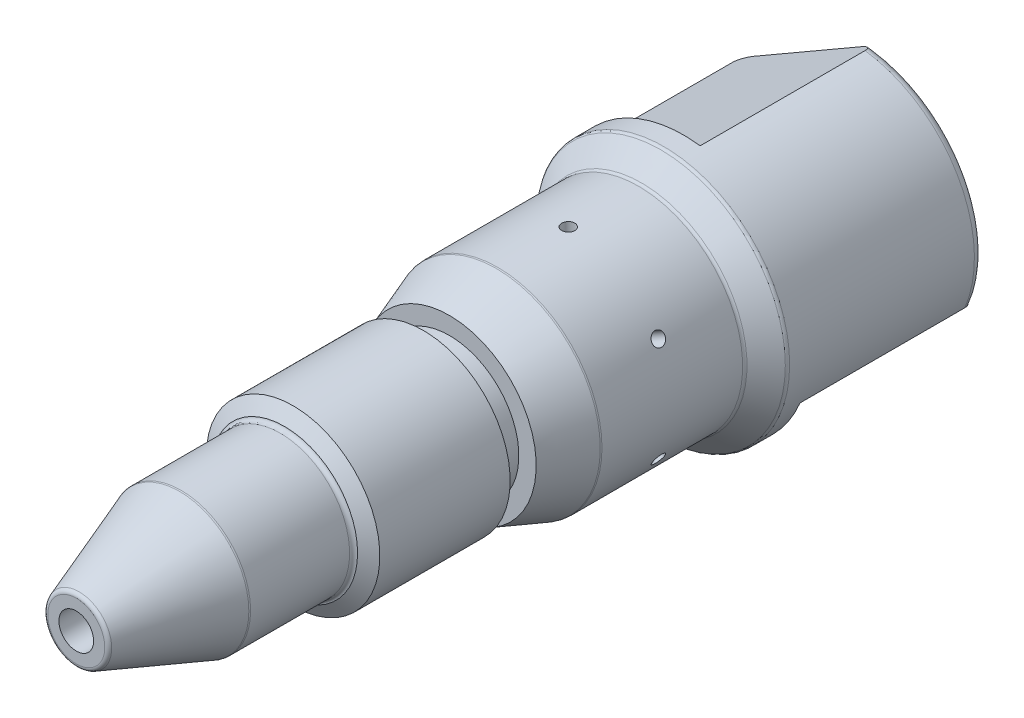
ISO-10303-21;
HEADER;
FILE_DESCRIPTION(('STEP AP214'),'2;1');
FILE_NAME('part.step','',(''),(''),'','','');
FILE_SCHEMA(('AUTOMOTIVE_DESIGN { 1 0 10303 214 1 1 1 1 }'));
ENDSEC;
DATA;
#1=APPLICATION_CONTEXT('core data for automotive mechanical design processes');
#2=APPLICATION_PROTOCOL_DEFINITION('international standard','automotive_design',2000,#1);
#3=PRODUCT_CONTEXT('',#1,'mechanical');
#4=PRODUCT('Part','Part','',(#3));
#5=PRODUCT_RELATED_PRODUCT_CATEGORY('part','',(#4));
#6=PRODUCT_DEFINITION_FORMATION('','',#4);
#7=PRODUCT_DEFINITION_CONTEXT('part definition',#1,'design');
#8=PRODUCT_DEFINITION('design','',#6,#7);
#9=PRODUCT_DEFINITION_SHAPE('','',#8);
#10=(LENGTH_UNIT() NAMED_UNIT(*) SI_UNIT(.MILLI.,.METRE.));
#11=(NAMED_UNIT(*) PLANE_ANGLE_UNIT() SI_UNIT($,.RADIAN.));
#12=(NAMED_UNIT(*) SI_UNIT($,.STERADIAN.) SOLID_ANGLE_UNIT());
#13=UNCERTAINTY_MEASURE_WITH_UNIT(LENGTH_MEASURE(1.E-05),#10,'distance_accuracy_value','');
#14=(GEOMETRIC_REPRESENTATION_CONTEXT(3) GLOBAL_UNCERTAINTY_ASSIGNED_CONTEXT((#13)) GLOBAL_UNIT_ASSIGNED_CONTEXT((#10,
#11,#12)) REPRESENTATION_CONTEXT('',''));
#15=CARTESIAN_POINT('',(0.,0.,0.));
#16=DIRECTION('',(0.,0.,1.));
#17=DIRECTION('',(1.,0.,0.));
#18=AXIS2_PLACEMENT_3D('',#15,#16,#17);
#19=CARTESIAN_POINT('',(0.,0.,-44.5));
#20=DIRECTION('',(0.,0.,1.));
#21=DIRECTION('',(1.,0.,0.));
#22=AXIS2_PLACEMENT_3D('',#19,#20,#21);
#23=TOROIDAL_SURFACE('',#22,6.75,0.5);
#24=CARTESIAN_POINT('',(0.949264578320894,7.18758625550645,-44.4998));
#25=CARTESIAN_POINT('',(0.949329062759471,7.18762348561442,-44.5203490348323));
#26=CARTESIAN_POINT('',(0.947490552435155,7.18656202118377,-44.5408259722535));
#27=CARTESIAN_POINT('',(0.940482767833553,7.18251607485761,-44.5807760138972));
#28=CARTESIAN_POINT('',(0.935351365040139,7.17955345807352,-44.6002578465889));
#29=CARTESIAN_POINT('',(0.922240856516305,7.17198410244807,-44.6377753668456));
#30=CARTESIAN_POINT('',(0.914273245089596,7.16738399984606,-44.6558165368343));
#31=CARTESIAN_POINT('',(0.896041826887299,7.15685808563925,-44.6903208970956));
#32=CARTESIAN_POINT('',(0.885771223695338,7.15092835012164,-44.7067792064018));
#33=CARTESIAN_POINT('',(0.857800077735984,7.13477920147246,-44.7459054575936));
#34=CARTESIAN_POINT('',(0.838971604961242,7.12390857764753,-44.7674946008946));
#35=CARTESIAN_POINT('',(0.798649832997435,7.10062879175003,-44.8070206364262));
#36=CARTESIAN_POINT('',(0.777150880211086,7.08821636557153,-44.824949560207));
#37=CARTESIAN_POINT('',(0.718750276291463,7.0544987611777,-44.8674941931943));
#38=CARTESIAN_POINT('',(0.680446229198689,7.03238390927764,-44.889526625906));
#39=CARTESIAN_POINT('',(0.601462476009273,6.98678261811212,-44.9267556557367));
#40=CARTESIAN_POINT('',(0.560778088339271,6.96329347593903,-44.9419382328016));
#41=CARTESIAN_POINT('',(0.484583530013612,6.91930252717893,-44.9647175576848));
#42=CARTESIAN_POINT('',(0.449249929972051,6.89890266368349,-44.973125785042));
#43=CARTESIAN_POINT('',(0.378078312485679,6.85781171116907,-44.9864150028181));
#44=CARTESIAN_POINT('',(0.342239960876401,6.83712042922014,-44.9912935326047));
#45=CARTESIAN_POINT('',(0.234271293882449,6.77478469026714,-45.0012431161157));
#46=CARTESIAN_POINT('',(0.161804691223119,6.73294607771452,-45.0015965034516));
#47=CARTESIAN_POINT('',(0.0124816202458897,6.64673436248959,-44.9912801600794));
#48=CARTESIAN_POINT('',(-0.0643325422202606,6.60238568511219,-44.9798477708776));
#49=CARTESIAN_POINT('',(-0.177871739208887,6.53683379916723,-44.9539262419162));
#50=CARTESIAN_POINT('',(-0.215383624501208,6.5151763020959,-44.9438449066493));
#51=CARTESIAN_POINT('',(-0.289676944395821,6.47228303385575,-44.9206021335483));
#52=CARTESIAN_POINT('',(-0.326458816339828,6.45104701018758,-44.9074426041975));
#53=CARTESIAN_POINT('',(-0.389362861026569,6.41472934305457,-44.8816329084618));
#54=CARTESIAN_POINT('',(-0.415728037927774,6.39950740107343,-44.8697710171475));
#55=CARTESIAN_POINT('',(-0.467736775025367,6.36948014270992,-44.8438949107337));
#56=CARTESIAN_POINT('',(-0.493378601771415,6.35467582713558,-44.8298759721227));
#57=CARTESIAN_POINT('',(-0.546959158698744,6.32374107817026,-44.797188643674));
#58=CARTESIAN_POINT('',(-0.574728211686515,6.30770860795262,-44.7781458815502));
#59=CARTESIAN_POINT('',(-0.627693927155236,6.27712883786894,-44.7357539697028));
#60=CARTESIAN_POINT('',(-0.652901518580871,6.26257522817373,-44.7124244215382));
#61=CARTESIAN_POINT('',(-0.684942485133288,6.24407636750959,-44.6751184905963));
#62=CARTESIAN_POINT('',(-0.693919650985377,6.23889339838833,-44.6636196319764));
#63=CARTESIAN_POINT('',(-0.710588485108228,6.22926964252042,-44.6394163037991));
#64=CARTESIAN_POINT('',(-0.718280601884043,6.22482859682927,-44.6267122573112));
#65=CARTESIAN_POINT('',(-0.730835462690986,6.21758004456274,-44.6020292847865));
#66=CARTESIAN_POINT('',(-0.735948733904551,6.21462789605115,-44.5902227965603));
#67=CARTESIAN_POINT('',(-0.744418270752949,6.20973800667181,-44.5658103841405));
#68=CARTESIAN_POINT('',(-0.747780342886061,6.20779691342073,-44.5532072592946));
#69=CARTESIAN_POINT('',(-0.751267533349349,6.20578358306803,-44.533699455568));
#70=CARTESIAN_POINT('',(-0.752171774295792,6.20526151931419,-44.5269741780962));
#71=CARTESIAN_POINT('',(-0.753383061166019,6.2045621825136,-44.5134344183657));
#72=CARTESIAN_POINT('',(-0.753688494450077,6.20438584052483,-44.5066197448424));
#73=CARTESIAN_POINT('',(-0.753679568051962,6.20439099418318,-44.4998));
#74=B_SPLINE_CURVE_WITH_KNOTS('',3,(#24,#25,#26,#27,#28,#29,#30,#31,#32,#33,#34,#35,#36,#37,#38,
#39,#40,#41,#42,#43,#44,#45,#46,#47,#48,#49,#50,#51,#52,#53,#54,#55,#56,#57,#58,#59,#60,#61,#62,
#63,#64,#65,#66,#67,#68,#69,#70,#71,#72,#73),.UNSPECIFIED.,.F.,.F.,(4,2,2,2,2,2,2,2,2,2,2,2,2,2,
2,2,2,2,2,2,2,2,2,2,4),(0.,0.0614198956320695,0.122145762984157,0.182628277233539,
0.243291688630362,0.334691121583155,0.426287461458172,0.573702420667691,0.721417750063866,
0.846214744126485,0.971098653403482,1.22127916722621,1.48873074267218,1.6220632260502,
1.75531326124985,1.85327000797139,1.951444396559,2.063132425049,2.17432191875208,
2.22068194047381,2.26702574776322,2.30648802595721,2.34581861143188,2.36620378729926,
2.386643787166),.UNSPECIFIED.);
#75=CARTESIAN_POINT('',(0.949264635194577,7.18758628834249,-44.5));
#76=VERTEX_POINT('',#75);
#77=CARTESIAN_POINT('',(0.18686217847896,6.7474130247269,-45.));
#78=VERTEX_POINT('',#77);
#79=EDGE_CURVE('E539',#76,#78,#74,.T.);
#80=ORIENTED_EDGE('',*,*,#79,.F.);
#81=CARTESIAN_POINT('',(0.,0.,-44.5));
#82=DIRECTION('',(0.,0.,1.));
#83=DIRECTION('',(1.,0.,0.));
#84=AXIS2_PLACEMENT_3D('',#81,#82,#83);
#85=CIRCLE('',#84,7.25);
#86=CARTESIAN_POINT('',(6.69926463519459,-2.77170585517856,-44.5));
#87=VERTEX_POINT('',#86);
#88=EDGE_CURVE('E136',#87,#76,#85,.T.);
#89=ORIENTED_EDGE('',*,*,#88,.F.);
#90=CARTESIAN_POINT('',(4.996320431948,-3.75490114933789,-44.4998));
#91=CARTESIAN_POINT('',(4.99627667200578,-3.75492641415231,-44.5122463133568));
#92=CARTESIAN_POINT('',(4.99732389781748,-3.75432179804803,-44.5246413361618));
#93=CARTESIAN_POINT('',(5.00129000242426,-3.75203196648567,-44.5488595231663));
#94=CARTESIAN_POINT('',(5.00418335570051,-3.75036148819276,-44.5606881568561));
#95=CARTESIAN_POINT('',(5.01253967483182,-3.74553696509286,-44.5867583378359));
#96=CARTESIAN_POINT('',(5.01848551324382,-3.74210413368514,-44.6007890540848));
#97=CARTESIAN_POINT('',(5.03224109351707,-3.73416234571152,-44.6276367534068));
#98=CARTESIAN_POINT('',(5.04006167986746,-3.7296471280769,-44.6404460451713));
#99=CARTESIAN_POINT('',(5.06305153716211,-3.71637392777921,-44.6735830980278));
#100=CARTESIAN_POINT('',(5.07947576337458,-3.7068913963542,-44.6927345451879));
#101=CARTESIAN_POINT('',(5.11444149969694,-3.68670391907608,-44.7281866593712));
#102=CARTESIAN_POINT('',(5.13298734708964,-3.67599646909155,-44.7444813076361));
#103=CARTESIAN_POINT('',(5.17282109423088,-3.65299844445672,-44.7759578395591));
#104=CARTESIAN_POINT('',(5.19421034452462,-3.64064935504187,-44.7909666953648));
#105=CARTESIAN_POINT('',(5.23799013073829,-3.61537308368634,-44.8189109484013));
#106=CARTESIAN_POINT('',(5.26038172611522,-3.60244529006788,-44.8318440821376));
#107=CARTESIAN_POINT('',(5.32869045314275,-3.56300722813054,-44.8680987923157));
#108=CARTESIAN_POINT('',(5.37564967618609,-3.53589530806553,-44.8888088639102));
#109=CARTESIAN_POINT('',(5.46770486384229,-3.48274722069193,-44.923410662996));
#110=CARTESIAN_POINT('',(5.51269902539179,-3.45676982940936,-44.9376799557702));
#111=CARTESIAN_POINT('',(5.60359982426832,-3.40428822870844,-44.9618605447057));
#112=CARTESIAN_POINT('',(5.64950721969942,-3.3777835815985,-44.9717680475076));
#113=CARTESIAN_POINT('',(5.74182276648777,-3.32448517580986,-44.9872816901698));
#114=CARTESIAN_POINT('',(5.78823046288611,-3.29769167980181,-44.992891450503));
#115=CARTESIAN_POINT('',(5.88125906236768,-3.24398159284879,-44.9996367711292));
#116=CARTESIAN_POINT('',(5.92787978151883,-3.21706510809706,-45.0007756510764));
#117=CARTESIAN_POINT('',(6.0315696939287,-3.15719970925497,-44.9978870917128));
#118=CARTESIAN_POINT('',(6.08861920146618,-3.12426216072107,-44.9926339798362));
#119=CARTESIAN_POINT('',(6.20161093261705,-3.05902635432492,-44.9735085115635));
#120=CARTESIAN_POINT('',(6.25755520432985,-3.02672691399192,-44.959654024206));
#121=CARTESIAN_POINT('',(6.34725434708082,-2.97493908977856,-44.9280257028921));
#122=CARTESIAN_POINT('',(6.38183426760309,-2.95497436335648,-44.9133906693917));
#123=CARTESIAN_POINT('',(6.44896859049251,-2.9162143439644,-44.8787853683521));
#124=CARTESIAN_POINT('',(6.48152569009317,-2.89741749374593,-44.8588224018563));
#125=CARTESIAN_POINT('',(6.53291117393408,-2.86775007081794,-44.8201830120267));
#126=CARTESIAN_POINT('',(6.55272243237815,-2.85631203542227,-44.8032592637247));
#127=CARTESIAN_POINT('',(6.58999954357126,-2.83479008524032,-44.7662231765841));
#128=CARTESIAN_POINT('',(6.60746821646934,-2.82470454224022,-44.7461147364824));
#129=CARTESIAN_POINT('',(6.63496072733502,-2.80883173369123,-44.7080838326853));
#130=CARTESIAN_POINT('',(6.6457486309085,-2.80260333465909,-44.6909029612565));
#131=CARTESIAN_POINT('',(6.66479373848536,-2.79160763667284,-44.6548040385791));
#132=CARTESIAN_POINT('',(6.67305913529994,-2.78683560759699,-44.6358918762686));
#133=CARTESIAN_POINT('',(6.68602103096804,-2.7793520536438,-44.5978489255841));
#134=CARTESIAN_POINT('',(6.69090972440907,-2.77652956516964,-44.5788071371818));
#135=CARTESIAN_POINT('',(6.69757848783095,-2.77267935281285,-44.5398039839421));
#136=CARTESIAN_POINT('',(6.69932390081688,-2.77167163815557,-44.519834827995));
#137=CARTESIAN_POINT('',(6.69926457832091,-2.77170588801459,-44.4998));
#138=B_SPLINE_CURVE_WITH_KNOTS('',3,(#90,#91,#92,#93,#94,#95,#96,#97,#98,#99,#100,#101,#102,
#103,#104,#105,#106,#107,#108,#109,#110,#111,#112,#113,#114,#115,#116,#117,#118,#119,#120,#121,
#122,#123,#124,#125,#126,#127,#128,#129,#130,#131,#132,#133,#134,#135,#136,#137),.UNSPECIFIED.,
.F.,.F.,(4,2,2,2,2,2,2,2,2,2,2,2,2,2,2,2,2,2,2,2,2,2,2,4),(0.,0.0371946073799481,
0.0738857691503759,0.120483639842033,0.167357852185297,0.24776270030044,0.328334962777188,
0.414902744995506,0.501564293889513,0.67526014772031,0.836719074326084,0.998318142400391,
1.15978092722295,1.32112380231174,1.51892775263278,1.71632214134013,1.84362113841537,
1.97074658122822,2.05588570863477,2.14092140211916,2.20436317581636,2.26759664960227,
2.32684242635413,2.3867375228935),.UNSPECIFIED.);
#139=CARTESIAN_POINT('',(5.93686217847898,-3.21187911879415,-45.));
#140=VERTEX_POINT('',#139);
#141=EDGE_CURVE('E121',#140,#87,#138,.T.);
#142=ORIENTED_EDGE('',*,*,#141,.F.);
#143=CARTESIAN_POINT('',(0.,0.,-45.));
#144=DIRECTION('',(0.,0.,1.));
#145=DIRECTION('',(1.,0.,0.));
#146=AXIS2_PLACEMENT_3D('',#143,#144,#145);
#147=CIRCLE('',#146,6.75);
#148=EDGE_CURVE('E131',#78,#140,#147,.F.);
#149=ORIENTED_EDGE('',*,*,#148,.F.);
#150=EDGE_LOOP('',(#80,#89,#142,#149));
#151=FACE_BOUND('',#150,.T.);
#152=ADVANCED_FACE('F60',(#151),#23,.T.);
#153=CARTESIAN_POINT('',(0.,0.,-23.));
#154=DIRECTION('',(0.,0.,1.));
#155=DIRECTION('',(1.,0.,0.));
#156=AXIS2_PLACEMENT_3D('',#153,#154,#155);
#157=CYLINDRICAL_SURFACE('',#156,1.);
#158=CARTESIAN_POINT('',(0.,0.,0.));
#159=DIRECTION('',(0.,0.,1.));
#160=DIRECTION('',(1.,0.,0.));
#161=AXIS2_PLACEMENT_3D('',#158,#159,#160);
#162=CIRCLE('',#161,1.);
#163=CARTESIAN_POINT('',(1.,0.,0.));
#164=VERTEX_POINT('',#163);
#165=EDGE_CURVE('E381',#164,#164,#162,.T.);
#166=ORIENTED_EDGE('',*,*,#165,.T.);
#167=EDGE_LOOP('',(#166));
#168=FACE_BOUND('',#167,.T.);
#169=CARTESIAN_POINT('',(0.,0.,-22.));
#170=DIRECTION('',(0.,0.,-1.));
#171=DIRECTION('',(-1.,0.,0.));
#172=AXIS2_PLACEMENT_3D('',#169,#170,#171);
#173=CIRCLE('',#172,1.);
#174=CARTESIAN_POINT('',(-0.999999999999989,0.,-22.));
#175=VERTEX_POINT('',#174);
#176=EDGE_CURVE('E379',#175,#175,#173,.F.);
#177=ORIENTED_EDGE('',*,*,#176,.F.);
#178=EDGE_LOOP('',(#177));
#179=FACE_BOUND('',#178,.T.);
#180=ADVANCED_FACE('F393',(#168,#179),#157,.F.);
#181=CARTESIAN_POINT('',(0.,0.,-45.));
#182=DIRECTION('',(0.,0.,1.));
#183=DIRECTION('',(1.,0.,0.));
#184=AXIS2_PLACEMENT_3D('',#181,#182,#183);
#185=PLANE('',#184);
#186=CARTESIAN_POINT('',(-0.186862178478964,-6.74741302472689,-45.));
#187=VERTEX_POINT('',#186);
#188=CARTESIAN_POINT('',(-5.93686217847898,3.21187911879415,-45.));
#189=VERTEX_POINT('',#188);
#190=EDGE_CURVE('E129',#187,#189,#147,.F.);
#191=ORIENTED_EDGE('',*,*,#190,.T.);
#192=DIRECTION('',(-0.866025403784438,-0.500000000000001,0.));
#193=VECTOR('',#192,1.);
#194=CARTESIAN_POINT('',(2.32115242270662,7.97964607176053,-45.));
#195=LINE('',#194,#193);
#196=EDGE_CURVE('E75',#78,#189,#195,.T.);
#197=ORIENTED_EDGE('',*,*,#196,.F.);
#198=ORIENTED_EDGE('',*,*,#148,.T.);
#199=DIRECTION('',(0.866025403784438,0.500000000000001,0.));
#200=VECTOR('',#199,1.);
#201=CARTESIAN_POINT('',(8.07115242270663,-1.97964607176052,-45.));
#202=LINE('',#201,#200);
#203=EDGE_CURVE('E115',#187,#140,#202,.T.);
#204=ORIENTED_EDGE('',*,*,#203,.F.);
#205=EDGE_LOOP('',(#191,#197,#198,#204));
#206=FACE_BOUND('',#205,.T.);
#207=CARTESIAN_POINT('',(0.,0.,-45.));
#208=DIRECTION('',(0.,0.,1.));
#209=DIRECTION('',(1.,0.,0.));
#210=AXIS2_PLACEMENT_3D('',#207,#208,#209);
#211=CIRCLE('',#210,4.74999999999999);
#212=CARTESIAN_POINT('',(4.74999999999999,0.,-45.));
#213=VERTEX_POINT('',#212);
#214=EDGE_CURVE('E141',#213,#213,#211,.T.);
#215=ORIENTED_EDGE('',*,*,#214,.T.);
#216=EDGE_LOOP('',(#215));
#217=FACE_BOUND('',#216,.T.);
#218=ADVANCED_FACE('F127',(#206,#217),#185,.F.);
#219=CARTESIAN_POINT('',(0.,0.,0.));
#220=DIRECTION('',(0.,0.,-1.));
#221=DIRECTION('',(-1.,0.,0.));
#222=AXIS2_PLACEMENT_3D('',#219,#220,#221);
#223=PLANE('',#222);
#224=CARTESIAN_POINT('',(0.,0.,0.));
#225=DIRECTION('',(0.,0.,-1.));
#226=DIRECTION('',(-1.,0.,0.));
#227=AXIS2_PLACEMENT_3D('',#224,#225,#226);
#228=CIRCLE('',#227,1.64112670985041);
#229=CARTESIAN_POINT('',(-1.64112670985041,0.,0.));
#230=VERTEX_POINT('',#229);
#231=EDGE_CURVE('E151',#230,#230,#228,.F.);
#232=ORIENTED_EDGE('',*,*,#231,.T.);
#233=EDGE_LOOP('',(#232));
#234=FACE_BOUND('',#233,.T.);
#235=ORIENTED_EDGE('',*,*,#165,.F.);
#236=EDGE_LOOP('',(#235));
#237=FACE_BOUND('',#236,.T.);
#238=ADVANCED_FACE('F396',(#234,#237),#223,.F.);
#239=CARTESIAN_POINT('',(0.,0.,0.));
#240=DIRECTION('',(0.,0.,-1.));
#241=DIRECTION('',(-1.,0.,0.));
#242=AXIS2_PLACEMENT_3D('',#239,#240,#241);
#243=CONICAL_SURFACE('',#242,1.81617859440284,0.34906585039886);
#244=CARTESIAN_POINT('',(0.,0.,-0.164494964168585));
#245=DIRECTION('',(0.,0.,1.));
#246=DIRECTION('',(1.,0.,0.));
#247=AXIS2_PLACEMENT_3D('',#244,#245,#246);
#248=CIRCLE('',#247,1.87604986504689);
#249=CARTESIAN_POINT('',(1.87604986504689,0.,-0.164494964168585));
#250=VERTEX_POINT('',#249);
#251=EDGE_CURVE('E148',#250,#250,#248,.F.);
#252=ORIENTED_EDGE('',*,*,#251,.T.);
#253=EDGE_LOOP('',(#252));
#254=FACE_BOUND('',#253,.T.);
#255=CARTESIAN_POINT('',(0.,0.,-5.9585767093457));
#256=DIRECTION('',(0.,0.,1.));
#257=DIRECTION('',(1.,0.,0.));
#258=AXIS2_PLACEMENT_3D('',#255,#256,#257);
#259=CIRCLE('',#258,3.98492315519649);
#260=CARTESIAN_POINT('',(3.98492315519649,0.,-5.9585767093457));
#261=VERTEX_POINT('',#260);
#262=EDGE_CURVE('E145',#261,#261,#259,.T.);
#263=ORIENTED_EDGE('',*,*,#262,.T.);
#264=EDGE_LOOP('',(#263));
#265=FACE_BOUND('',#264,.T.);
#266=ADVANCED_FACE('F398',(#254,#265),#243,.T.);
#267=CARTESIAN_POINT('',(0.,0.,-45.));
#268=DIRECTION('',(0.,0.,-1.));
#269=DIRECTION('',(-1.,0.,0.));
#270=AXIS2_PLACEMENT_3D('',#267,#268,#269);
#271=CYLINDRICAL_SURFACE('',#270,4.00000000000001);
#272=CARTESIAN_POINT('',(0.,0.,-6.04408174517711));
#273=DIRECTION('',(0.,0.,1.));
#274=DIRECTION('',(1.,0.,0.));
#275=AXIS2_PLACEMENT_3D('',#272,#273,#274);
#276=CIRCLE('',#275,4.00000000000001);
#277=CARTESIAN_POINT('',(4.00000000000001,0.,-6.04408174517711));
#278=VERTEX_POINT('',#277);
#279=EDGE_CURVE('E158',#278,#278,#276,.F.);
#280=ORIENTED_EDGE('',*,*,#279,.T.);
#281=EDGE_LOOP('',(#280));
#282=FACE_BOUND('',#281,.T.);
#283=CARTESIAN_POINT('',(0.,0.,-11.75));
#284=DIRECTION('',(0.,0.,-1.));
#285=DIRECTION('',(-1.,0.,0.));
#286=AXIS2_PLACEMENT_3D('',#283,#284,#285);
#287=CIRCLE('',#286,4.00000000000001);
#288=CARTESIAN_POINT('',(-4.00000000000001,0.,-11.75));
#289=VERTEX_POINT('',#288);
#290=EDGE_CURVE('E154',#289,#289,#287,.F.);
#291=ORIENTED_EDGE('',*,*,#290,.T.);
#292=EDGE_LOOP('',(#291));
#293=FACE_BOUND('',#292,.T.);
#294=ADVANCED_FACE('F404',(#282,#293),#271,.T.);
#295=CARTESIAN_POINT('',(0.,0.,-45.));
#296=DIRECTION('',(0.,0.,-1.));
#297=DIRECTION('',(-1.,0.,0.));
#298=AXIS2_PLACEMENT_3D('',#295,#296,#297);
#299=CYLINDRICAL_SURFACE('',#298,5.00000000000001);
#300=CARTESIAN_POINT('',(0.,0.,-12.4909710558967));
#301=DIRECTION('',(0.,0.,-1.));
#302=DIRECTION('',(-1.,0.,0.));
#303=AXIS2_PLACEMENT_3D('',#300,#301,#302);
#304=CIRCLE('',#303,5.00000000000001);
#305=CARTESIAN_POINT('',(-5.00000000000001,0.,-12.4909710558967));
#306=VERTEX_POINT('',#305);
#307=EDGE_CURVE('E182',#306,#306,#304,.T.);
#308=ORIENTED_EDGE('',*,*,#307,.T.);
#309=EDGE_LOOP('',(#308));
#310=FACE_BOUND('',#309,.T.);
#311=CARTESIAN_POINT('',(0.,0.,-20.));
#312=DIRECTION('',(0.,0.,-1.));
#313=DIRECTION('',(-1.,0.,0.));
#314=AXIS2_PLACEMENT_3D('',#311,#312,#313);
#315=CIRCLE('',#314,5.00000000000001);
#316=CARTESIAN_POINT('',(-5.00000000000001,0.,-20.));
#317=VERTEX_POINT('',#316);
#318=EDGE_CURVE('E372',#317,#317,#315,.T.);
#319=ORIENTED_EDGE('',*,*,#318,.F.);
#320=EDGE_LOOP('',(#319));
#321=FACE_BOUND('',#320,.T.);
#322=ADVANCED_FACE('F469',(#310,#321),#299,.T.);
#323=CARTESIAN_POINT('',(5.00000000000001,0.,-20.));
#324=DIRECTION('',(0.,0.,1.));
#325=DIRECTION('',(1.,0.,0.));
#326=AXIS2_PLACEMENT_3D('',#323,#324,#325);
#327=PLANE('',#326);
#328=CARTESIAN_POINT('',(0.,0.,-20.));
#329=DIRECTION('',(0.,0.,-1.));
#330=DIRECTION('',(-1.,0.,0.));
#331=AXIS2_PLACEMENT_3D('',#328,#329,#330);
#332=CIRCLE('',#331,3.99999999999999);
#333=CARTESIAN_POINT('',(-3.99999999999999,0.,-20.));
#334=VERTEX_POINT('',#333);
#335=EDGE_CURVE('E376',#334,#334,#332,.T.);
#336=ORIENTED_EDGE('',*,*,#335,.F.);
#337=EDGE_LOOP('',(#336));
#338=FACE_BOUND('',#337,.T.);
#339=ORIENTED_EDGE('',*,*,#318,.T.);
#340=EDGE_LOOP('',(#339));
#341=FACE_BOUND('',#340,.T.);
#342=ADVANCED_FACE('F475',(#338,#341),#327,.F.);
#343=CARTESIAN_POINT('',(0.,0.,-45.));
#344=DIRECTION('',(0.,0.,-1.));
#345=DIRECTION('',(-1.,0.,0.));
#346=AXIS2_PLACEMENT_3D('',#343,#344,#345);
#347=CYLINDRICAL_SURFACE('',#346,3.99999999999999);
#348=CARTESIAN_POINT('',(0.,0.,-21.5));
#349=DIRECTION('',(0.,0.,-1.));
#350=DIRECTION('',(-1.,0.,0.));
#351=AXIS2_PLACEMENT_3D('',#348,#349,#350);
#352=CIRCLE('',#351,3.99999999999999);
#353=CARTESIAN_POINT('',(-3.99999999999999,0.,-21.5));
#354=VERTEX_POINT('',#353);
#355=EDGE_CURVE('E385',#354,#354,#352,.T.);
#356=ORIENTED_EDGE('',*,*,#355,.F.);
#357=EDGE_LOOP('',(#356));
#358=FACE_BOUND('',#357,.T.);
#359=ORIENTED_EDGE('',*,*,#335,.T.);
#360=EDGE_LOOP('',(#359));
#361=FACE_BOUND('',#360,.T.);
#362=ADVANCED_FACE('F481',(#358,#361),#347,.T.);
#363=CARTESIAN_POINT('',(3.99999999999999,0.,-21.5));
#364=DIRECTION('',(0.,0.,-1.));
#365=DIRECTION('',(-1.,0.,0.));
#366=AXIS2_PLACEMENT_3D('',#363,#364,#365);
#367=PLANE('',#366);
#368=CARTESIAN_POINT('',(0.,0.,-21.5));
#369=DIRECTION('',(0.,0.,-1.));
#370=DIRECTION('',(-1.,0.,0.));
#371=AXIS2_PLACEMENT_3D('',#368,#369,#370);
#372=CIRCLE('',#371,4.99999999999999);
#373=CARTESIAN_POINT('',(-4.99999999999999,0.,-21.5));
#374=VERTEX_POINT('',#373);
#375=EDGE_CURVE('E388',#374,#374,#372,.T.);
#376=ORIENTED_EDGE('',*,*,#375,.F.);
#377=EDGE_LOOP('',(#376));
#378=FACE_BOUND('',#377,.T.);
#379=ORIENTED_EDGE('',*,*,#355,.T.);
#380=EDGE_LOOP('',(#379));
#381=FACE_BOUND('',#380,.T.);
#382=ADVANCED_FACE('F484',(#378,#381),#367,.F.);
#383=CARTESIAN_POINT('',(0.,0.,-21.5));
#384=DIRECTION('',(0.,0.,-1.));
#385=DIRECTION('',(-1.,0.,0.));
#386=AXIS2_PLACEMENT_3D('',#383,#384,#385);
#387=CONICAL_SURFACE('',#386,4.99999999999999,0.349065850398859);
#388=CARTESIAN_POINT('',(0.,0.,-24.2060541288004));
#389=DIRECTION('',(0.,0.,1.));
#390=DIRECTION('',(1.,0.,0.));
#391=AXIS2_PLACEMENT_3D('',#388,#389,#390);
#392=CIRCLE('',#391,5.98492315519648);
#393=CARTESIAN_POINT('',(5.98492315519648,0.,-24.2060541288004));
#394=VERTEX_POINT('',#393);
#395=EDGE_CURVE('E168',#394,#394,#392,.T.);
#396=ORIENTED_EDGE('',*,*,#395,.T.);
#397=EDGE_LOOP('',(#396));
#398=FACE_BOUND('',#397,.T.);
#399=ORIENTED_EDGE('',*,*,#375,.T.);
#400=EDGE_LOOP('',(#399));
#401=FACE_BOUND('',#400,.T.);
#402=ADVANCED_FACE('F259',(#398,#401),#387,.T.);
#403=CARTESIAN_POINT('',(0.,0.,-45.));
#404=DIRECTION('',(0.,0.,-1.));
#405=DIRECTION('',(-1.,0.,0.));
#406=AXIS2_PLACEMENT_3D('',#403,#404,#405);
#407=CYLINDRICAL_SURFACE('',#406,6.);
#408=CARTESIAN_POINT('',(-5.37349375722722,2.66937536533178,-28.3440028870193));
#409=CARTESIAN_POINT('',(-5.373493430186,2.66937624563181,-28.3650447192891));
#410=CARTESIAN_POINT('',(-5.37270234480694,2.67097033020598,-28.3861012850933));
#411=CARTESIAN_POINT('',(-5.36954991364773,2.67730195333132,-28.4276329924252));
#412=CARTESIAN_POINT('',(-5.36718674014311,2.68204315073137,-28.4481074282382));
#413=CARTESIAN_POINT('',(-5.36093445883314,2.69451853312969,-28.4878672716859));
#414=CARTESIAN_POINT('',(-5.35704615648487,2.70225113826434,-28.5071533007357));
#415=CARTESIAN_POINT('',(-5.34781890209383,2.72046626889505,-28.5439961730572));
#416=CARTESIAN_POINT('',(-5.34248028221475,2.73094816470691,-28.5615534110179));
#417=CARTESIAN_POINT('',(-5.33045008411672,2.7543556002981,-28.594471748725));
#418=CARTESIAN_POINT('',(-5.32375672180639,2.7672843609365,-28.6098299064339));
#419=CARTESIAN_POINT('',(-5.30916156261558,2.79518350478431,-28.637888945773));
#420=CARTESIAN_POINT('',(-5.30125971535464,2.81015397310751,-28.6505897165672));
#421=CARTESIAN_POINT('',(-5.28441725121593,2.84169909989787,-28.6729824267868));
#422=CARTESIAN_POINT('',(-5.27547580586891,2.85827503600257,-28.6826719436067));
#423=CARTESIAN_POINT('',(-5.25677295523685,2.89252804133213,-28.6987515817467));
#424=CARTESIAN_POINT('',(-5.24701155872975,2.91020509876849,-28.7051417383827));
#425=CARTESIAN_POINT('',(-5.22693152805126,2.9461176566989,-28.7144331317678));
#426=CARTESIAN_POINT('',(-5.21661364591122,2.96435238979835,-28.7173389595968));
#427=CARTESIAN_POINT('',(-5.19568923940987,3.00087590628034,-28.7195933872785));
#428=CARTESIAN_POINT('',(-5.18508271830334,3.01916468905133,-28.7189420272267));
#429=CARTESIAN_POINT('',(-5.16390085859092,3.05525206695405,-28.7141043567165));
#430=CARTESIAN_POINT('',(-5.15332549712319,3.07305131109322,-28.7099229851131));
#431=CARTESIAN_POINT('',(-5.13250960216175,3.10769268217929,-28.6981516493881));
#432=CARTESIAN_POINT('',(-5.12226907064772,3.12453480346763,-28.690561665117));
#433=CARTESIAN_POINT('',(-5.10243778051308,3.15681615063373,-28.6721829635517));
#434=CARTESIAN_POINT('',(-5.09284748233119,3.17225438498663,-28.66139200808));
#435=CARTESIAN_POINT('',(-5.07463757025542,3.20130409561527,-28.636919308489));
#436=CARTESIAN_POINT('',(-5.0660179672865,3.21491555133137,-28.6232375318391));
#437=CARTESIAN_POINT('',(-5.05002659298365,3.2399773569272,-28.5933436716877));
#438=CARTESIAN_POINT('',(-5.04265698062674,3.25142397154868,-28.5771273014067));
#439=CARTESIAN_POINT('',(-5.02944053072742,3.27183071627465,-28.5426395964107));
#440=CARTESIAN_POINT('',(-5.02359369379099,3.28079084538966,-28.5243682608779));
#441=CARTESIAN_POINT('',(-5.01363163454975,3.29599466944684,-28.4862865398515));
#442=CARTESIAN_POINT('',(-5.00951651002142,3.30223821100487,-28.4664760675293));
#443=CARTESIAN_POINT('',(-5.00316872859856,3.31184784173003,-28.4258796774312));
#444=CARTESIAN_POINT('',(-5.00093604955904,3.31521396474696,-28.4050937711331));
#445=CARTESIAN_POINT('',(-4.99843789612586,3.31897933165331,-28.3631741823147));
#446=CARTESIAN_POINT('',(-4.9981691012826,3.31938358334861,-28.3420411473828));
#447=CARTESIAN_POINT('',(-4.99959991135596,3.31722811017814,-28.2999941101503));
#448=CARTESIAN_POINT('',(-5.00129950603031,3.31466840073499,-28.2790801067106));
#449=CARTESIAN_POINT('',(-5.00660204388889,3.30665371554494,-28.2380817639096));
#450=CARTESIAN_POINT('',(-5.01020346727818,3.30120105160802,-28.2179967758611));
#451=CARTESIAN_POINT('',(-5.01917725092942,3.2875410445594,-28.1792065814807));
#452=CARTESIAN_POINT('',(-5.02454962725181,3.2793336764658,-28.1605013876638));
#453=CARTESIAN_POINT('',(-5.03688118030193,3.2603612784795,-28.1249742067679));
#454=CARTESIAN_POINT('',(-5.04384247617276,3.24959283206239,-28.108154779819));
#455=CARTESIAN_POINT('',(-5.05910390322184,3.22578163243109,-28.0769023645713));
#456=CARTESIAN_POINT('',(-5.06740404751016,3.21273885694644,-28.0624693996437));
#457=CARTESIAN_POINT('',(-5.08507273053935,3.18469932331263,-28.0363793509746));
#458=CARTESIAN_POINT('',(-5.09444273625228,3.16969987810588,-28.0247261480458));
#459=CARTESIAN_POINT('',(-5.11393166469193,3.13815967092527,-28.0045529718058));
#460=CARTESIAN_POINT('',(-5.12405058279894,3.12161891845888,-27.9960329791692));
#461=CARTESIAN_POINT('',(-5.14470668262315,3.08745703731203,-27.9823748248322));
#462=CARTESIAN_POINT('',(-5.15524355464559,3.0698367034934,-27.9772342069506));
#463=CARTESIAN_POINT('',(-5.1764197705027,3.03399266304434,-27.9704726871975));
#464=CARTESIAN_POINT('',(-5.18705911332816,3.015768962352,-27.9688517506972));
#465=CARTESIAN_POINT('',(-5.20811160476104,2.97926446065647,-27.9691759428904));
#466=CARTESIAN_POINT('',(-5.2185251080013,2.96098380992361,-27.9711149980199));
#467=CARTESIAN_POINT('',(-5.23885781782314,2.92485872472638,-27.9784915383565));
#468=CARTESIAN_POINT('',(-5.2487770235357,2.90701429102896,-27.983929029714));
#469=CARTESIAN_POINT('',(-5.26786417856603,2.87228132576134,-27.9981467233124));
#470=CARTESIAN_POINT('',(-5.27703213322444,2.85539278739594,-28.0069269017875));
#471=CARTESIAN_POINT('',(-5.29439456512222,2.82306981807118,-28.0275798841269));
#472=CARTESIAN_POINT('',(-5.30258906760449,2.80763534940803,-28.0394526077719));
#473=CARTESIAN_POINT('',(-5.31783148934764,2.77865744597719,-28.0659760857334));
#474=CARTESIAN_POINT('',(-5.32487756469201,2.76511705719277,-28.0806312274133));
#475=CARTESIAN_POINT('',(-5.33765865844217,2.74036396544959,-28.1122977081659));
#476=CARTESIAN_POINT('',(-5.34339335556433,2.72915183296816,-28.129309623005));
#477=CARTESIAN_POINT('',(-5.35343979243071,2.70939214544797,-28.1652261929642));
#478=CARTESIAN_POINT('',(-5.35774975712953,2.70084791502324,-28.1841331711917));
#479=CARTESIAN_POINT('',(-5.36484967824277,2.68671752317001,-28.2232725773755));
#480=CARTESIAN_POINT('',(-5.36764141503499,2.68112789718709,-28.243503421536));
#481=CARTESIAN_POINT('',(-5.37092844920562,2.67453458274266,-28.2772155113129));
#482=CARTESIAN_POINT('',(-5.37188956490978,2.67260259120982,-28.2904788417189));
#483=CARTESIAN_POINT('',(-5.3731723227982,2.67002270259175,-28.3171604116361));
#484=CARTESIAN_POINT('',(-5.37349396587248,2.6693748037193,-28.3305786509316));
#485=CARTESIAN_POINT('',(-5.37349375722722,2.66937536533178,-28.3440028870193));
#486=B_SPLINE_CURVE_WITH_KNOTS('',3,(#408,#409,#410,#411,#412,#413,#414,#415,#416,#417,#418,
#419,#420,#421,#422,#423,#424,#425,#426,#427,#428,#429,#430,#431,#432,#433,#434,#435,#436,#437,
#438,#439,#440,#441,#442,#443,#444,#445,#446,#447,#448,#449,#450,#451,#452,#453,#454,#455,#456,
#457,#458,#459,#460,#461,#462,#463,#464,#465,#466,#467,#468,#469,#470,#471,#472,#473,#474,#475,
#476,#477,#478,#479,#480,#481,#482,#483,#484,#485),.UNSPECIFIED.,.T.,.F.,(4,2,2,2,2,2,2,2,2,2,2,
2,2,2,2,2,2,2,2,2,2,2,2,2,2,2,2,2,2,2,2,2,2,2,2,2,2,2,4),(0.,0.0630764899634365,
0.126226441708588,0.189343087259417,0.252445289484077,0.315631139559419,0.378819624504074,
0.442058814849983,0.50529732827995,0.568452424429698,0.631606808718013,0.694672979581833,
0.757739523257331,0.820850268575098,0.883961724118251,0.947181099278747,1.01040049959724,
1.07362346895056,1.13684569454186,1.19996100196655,1.26307598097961,1.32614059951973,
1.38920578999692,1.45235558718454,1.51550600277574,1.57874407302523,1.64198175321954,
1.70517342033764,1.76836446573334,1.83144780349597,1.89453125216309,1.95761425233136,
2.02069561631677,2.08387728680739,2.14707442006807,2.2103499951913,2.27355120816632,
2.31379270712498,2.35403415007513),.UNSPECIFIED.);
#487=CARTESIAN_POINT('',(-5.37349375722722,2.66937536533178,-28.3440028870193));
#488=VERTEX_POINT('',#487);
#489=EDGE_CURVE('E235',#488,#488,#486,.T.);
#490=ORIENTED_EDGE('',*,*,#489,.T.);
#491=EDGE_LOOP('',(#490));
#492=FACE_BOUND('',#491,.T.);
#493=CARTESIAN_POINT('',(-4.99849375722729,-3.31889441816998,-28.3440028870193));
#494=CARTESIAN_POINT('',(-4.99849435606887,-3.31889369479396,-28.3650447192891));
#495=CARTESIAN_POINT('',(-4.99947933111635,-3.31741155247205,-28.3861012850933));
#496=CARTESIAN_POINT('',(-5.00338646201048,-3.31151565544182,-28.4276329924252));
#497=CARTESIAN_POINT('',(-5.00631087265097,-3.30709848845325,-28.4481074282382));
#498=CARTESIAN_POINT('',(-5.01398873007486,-3.29544616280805,-28.4878672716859));
#499=CARTESIAN_POINT('',(-5.01874121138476,-3.28821249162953,-28.5071533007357));
#500=CARTESIAN_POINT('',(-5.02990235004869,-3.27111388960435,-28.5439961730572));
#501=CARTESIAN_POINT('',(-5.03631062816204,-3.26124956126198,-28.5615534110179));
#502=CARTESIAN_POINT('',(-5.05056696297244,-3.23912738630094,-28.594471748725));
#503=CARTESIAN_POINT('',(-5.05841691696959,-3.22686638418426,-28.6098299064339));
#504=CARTESIAN_POINT('',(-5.07528070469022,-3.20027703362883,-28.637888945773));
#505=CARTESIAN_POINT('',(-5.08429458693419,-3.18594859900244,-28.6505897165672));
#506=CARTESIAN_POINT('',(-5.10319223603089,-3.1555900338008,-28.6729824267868));
#507=CARTESIAN_POINT('',(-5.11307669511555,-3.13955854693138,-28.6826719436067));
#508=CARTESIAN_POINT('',(-5.13338924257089,-3.10623490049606,-28.6987515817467));
#509=CARTESIAN_POINT('',(-5.14381732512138,-3.08894275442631,-28.7051417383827));
#510=CARTESIAN_POINT('',(-5.16487849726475,-3.05359665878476,-28.7144331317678));
#511=CARTESIAN_POINT('',(-5.17551129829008,-3.03554374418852,-28.7173389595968));
#512=CARTESIAN_POINT('',(-5.19667938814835,-2.99916091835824,-28.7195933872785));
#513=CARTESIAN_POINT('',(-5.20721467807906,-2.98083101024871,-28.7189420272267));
#514=CARTESIAN_POINT('',(-5.22787633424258,-2.944443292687,-28.7141043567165));
#515=CARTESIAN_POINT('',(-5.2380032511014,-2.92638513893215,-28.7099229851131));
#516=CARTESIAN_POINT('',(-5.25759561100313,-2.89103735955,-28.6981516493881));
#517=CARTESIAN_POINT('',(-5.26706105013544,-2.87374773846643,-28.690561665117));
#518=CARTESIAN_POINT('',(-5.28510187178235,-2.84043266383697,-28.6721829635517));
#519=CARTESIAN_POINT('',(-5.29367662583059,-2.82440810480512,-28.66139200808));
#520=CARTESIAN_POINT('',(-5.30972945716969,-2.79411300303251,-28.636919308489));
#521=CARTESIAN_POINT('',(-5.31720752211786,-2.77984248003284,-28.623237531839));
#522=CARTESIAN_POINT('',(-5.33091599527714,-2.75346264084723,-28.5933436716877));
#523=CARTESIAN_POINT('',(-5.33714424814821,-2.74135706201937,-28.5771273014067));
#524=CARTESIAN_POINT('',(-5.34820878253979,-2.71970790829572,-28.5426395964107));
#525=CARTESIAN_POINT('',(-5.35304506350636,-2.71016433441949,-28.5243682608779));
#526=CARTESIAN_POINT('',(-5.36123093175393,-2.69393502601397,-28.4862865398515));
#527=CARTESIAN_POINT('',(-5.3645804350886,-2.68724945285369,-28.4664760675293));
#528=CARTESIAN_POINT('',(-5.36972872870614,-2.67694729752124,-28.4258796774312));
#529=CARTESIAN_POINT('',(-5.37152753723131,-2.67333067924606,-28.4050937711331));
#530=CARTESIAN_POINT('',(-5.37353936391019,-2.6692845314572,-28.3631741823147));
#531=CARTESIAN_POINT('',(-5.37375505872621,-2.66884962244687,-28.3420411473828));
#532=CARTESIAN_POINT('',(-5.37260376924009,-2.67116647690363,-28.2999941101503));
#533=CARTESIAN_POINT('',(-5.37123679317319,-2.67391822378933,-28.2790801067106));
#534=CARTESIAN_POINT('',(-5.36694714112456,-2.68251769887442,-28.2380817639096));
#535=CARTESIAN_POINT('',(-5.36402570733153,-2.68836295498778,-28.2179967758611));
#536=CARTESIAN_POINT('',(-5.35668268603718,-2.70296448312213,-28.1792065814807));
#537=CARTESIAN_POINT('',(-5.3522610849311,-2.71172078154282,-28.1605013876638));
#538=CARTESIAN_POINT('',(-5.34199628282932,-2.73188641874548,-28.1249742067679));
#539=CARTESIAN_POINT('',(-5.33615118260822,-2.74329930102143,-28.108154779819));
#540=CARTESIAN_POINT('',(-5.32316079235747,-2.76842168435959,-28.0769023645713));
#541=CARTESIAN_POINT('',(-5.31601548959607,-2.78213120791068,-28.0624693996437));
#542=CARTESIAN_POINT('',(-5.30056688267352,-2.81145250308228,-28.0363793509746));
#543=CARTESIAN_POINT('',(-5.29226198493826,-2.82706688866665,-28.0247261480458));
#544=CARTESIAN_POINT('',(-5.27469182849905,-2.85971489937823,-28.0045529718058));
#545=CARTESIAN_POINT('',(-5.26542657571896,-2.87674851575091,-27.9960329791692));
#546=CARTESIAN_POINT('',(-5.24616956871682,-2.91171816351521,-27.9823748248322));
#547=CARTESIAN_POINT('',(-5.23617834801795,-2.92965352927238,-27.9772342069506));
#548=CARTESIAN_POINT('',(-5.21572460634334,-2.96591469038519,-27.9704726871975));
#549=CARTESIAN_POINT('',(-5.20526209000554,-2.98424048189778,-27.9688517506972));
#550=CARTESIAN_POINT('',(-5.18417450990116,-3.02072472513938,-27.9691759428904));
#551=CARTESIAN_POINT('',(-5.17354975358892,-3.03888340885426,-27.9711149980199));
#552=CARTESIAN_POINT('',(-5.15243086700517,-3.07455459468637,-27.9784915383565));
#553=CARTESIAN_POINT('',(-5.14193673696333,-3.09206709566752,-27.983929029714));
#554=CARTESIAN_POINT('',(-5.12140068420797,-3.12596353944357,-27.9981467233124));
#555=CARTESIAN_POINT('',(-5.11135875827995,-3.1423474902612,-28.0069269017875));
#556=CARTESIAN_POINT('',(-5.09204746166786,-3.17354528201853,-28.0275798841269));
#557=CARTESIAN_POINT('',(-5.08277807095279,-3.18835916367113,-28.0394526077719));
#558=CARTESIAN_POINT('',(-5.06530368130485,-3.21604843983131,-28.0659760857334));
#559=CARTESIAN_POINT('',(-5.05710039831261,-3.22892071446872,-28.0806312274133));
#560=CARTESIAN_POINT('',(-5.04205413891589,-3.2523660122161,-28.1122977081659));
#561=CARTESIAN_POINT('',(-5.03521149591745,-3.26293847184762,-28.129309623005));
#562=CARTESIAN_POINT('',(-5.02312232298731,-3.28151878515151,-28.1652261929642));
#563=CARTESIAN_POINT('',(-5.01787778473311,-3.28952343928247,-28.1841331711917));
#564=CARTESIAN_POINT('',(-5.00919046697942,-3.30273734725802,-28.2232725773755));
#565=CARTESIAN_POINT('',(-5.00574557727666,-3.30794987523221,-28.243503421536));
#566=CARTESIAN_POINT('',(-5.00167911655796,-3.31409318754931,-28.2772155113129));
#567=CARTESIAN_POINT('',(-5.0004865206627,-3.3158915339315,-28.2904788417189));
#568=CARTESIAN_POINT('',(-4.99889365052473,-3.31829237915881,-28.3171604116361));
#569=CARTESIAN_POINT('',(-4.99849337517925,-3.31889487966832,-28.3305786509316));
#570=CARTESIAN_POINT('',(-4.99849375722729,-3.31889441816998,-28.3440028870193));
#571=B_SPLINE_CURVE_WITH_KNOTS('',3,(#493,#494,#495,#496,#497,#498,#499,#500,#501,#502,#503,
#504,#505,#506,#507,#508,#509,#510,#511,#512,#513,#514,#515,#516,#517,#518,#519,#520,#521,#522,
#523,#524,#525,#526,#527,#528,#529,#530,#531,#532,#533,#534,#535,#536,#537,#538,#539,#540,#541,
#542,#543,#544,#545,#546,#547,#548,#549,#550,#551,#552,#553,#554,#555,#556,#557,#558,#559,#560,
#561,#562,#563,#564,#565,#566,#567,#568,#569,#570),.UNSPECIFIED.,.T.,.F.,(4,2,2,2,2,2,2,2,2,2,2,
2,2,2,2,2,2,2,2,2,2,2,2,2,2,2,2,2,2,2,2,2,2,2,2,2,2,2,4),(0.,0.0630764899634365,
0.126226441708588,0.189343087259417,0.252445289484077,0.315631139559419,0.378819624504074,
0.442058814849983,0.50529732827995,0.568452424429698,0.631606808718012,0.694672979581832,
0.75773952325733,0.820850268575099,0.883961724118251,0.947181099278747,1.01040049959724,
1.07362346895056,1.13684569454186,1.19996100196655,1.26307598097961,1.32614059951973,
1.38920578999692,1.45235558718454,1.51550600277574,1.57874407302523,1.64198175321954,
1.70517342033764,1.76836446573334,1.83144780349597,1.89453125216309,1.95761425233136,
2.02069561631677,2.08387728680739,2.14707442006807,2.21034999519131,2.27355120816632,
2.31379270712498,2.35403415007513),.UNSPECIFIED.);
#572=CARTESIAN_POINT('',(-4.99849375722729,-3.31889441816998,-28.3440028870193));
#573=VERTEX_POINT('',#572);
#574=EDGE_CURVE('E300',#573,#573,#571,.T.);
#575=ORIENTED_EDGE('',*,*,#574,.T.);
#576=EDGE_LOOP('',(#575));
#577=FACE_BOUND('',#576,.T.);
#578=CARTESIAN_POINT('',(0.,-6.,-28.7190028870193));
#579=CARTESIAN_POINT('',(-0.0210418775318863,-5.99999984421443,-28.7190019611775));
#580=CARTESIAN_POINT('',(-0.0420984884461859,-5.99988812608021,-28.7172258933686));
#581=CARTESIAN_POINT('',(-0.0836302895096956,-5.99945320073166,-28.7101662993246));
#582=CARTESIAN_POINT('',(-0.104104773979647,-5.99912974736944,-28.704878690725));
#583=CARTESIAN_POINT('',(-0.143864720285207,-5.99830794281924,-28.6909484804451));
#584=CARTESIAN_POINT('',(-0.163150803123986,-5.99780968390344,-28.6823076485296));
#585=CARTESIAN_POINT('',(-0.199993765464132,-5.99669430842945,-28.6619191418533));
#586=CARTESIAN_POINT('',(-0.217551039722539,-5.99607721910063,-28.6501721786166));
#587=CARTESIAN_POINT('',(-0.250469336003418,-5.99479251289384,-28.6238855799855));
#588=CARTESIAN_POINT('',(-0.265827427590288,-5.99412483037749,-28.6093422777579));
#589=CARTESIAN_POINT('',(-0.293886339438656,-5.99281474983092,-28.5778833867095));
#590=CARTESIAN_POINT('',(-0.306587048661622,-5.99217235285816,-28.5609676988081));
#591=CARTESIAN_POINT('',(-0.32897969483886,-5.990984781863,-28.5252276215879));
#592=CARTESIAN_POINT('',(-0.338669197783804,-5.99043968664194,-28.5064017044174));
#593=CARTESIAN_POINT('',(-0.354748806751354,-5.98950903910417,-28.4673862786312));
#594=CARTESIAN_POINT('',(-0.361138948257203,-5.98912348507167,-28.4471967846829));
#595=CARTESIAN_POINT('',(-0.370430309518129,-5.98855602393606,-28.4060555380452));
#596=CARTESIAN_POINT('',(-0.373336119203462,-5.98837384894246,-28.3851048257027));
#597=CARTESIAN_POINT('',(-0.375590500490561,-5.98823288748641,-28.3430122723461));
#598=CARTESIAN_POINT('',(-0.374939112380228,-5.98827409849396,-28.3218704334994));
#599=CARTESIAN_POINT('',(-0.370101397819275,-5.98857501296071,-28.2800270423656));
#600=CARTESIAN_POINT('',(-0.365920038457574,-5.9888344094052,-28.2593249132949));
#601=CARTESIAN_POINT('',(-0.35414877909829,-5.98954197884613,-28.2189169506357));
#602=CARTESIAN_POINT('',(-0.346558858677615,-5.98999015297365,-28.1992111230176));
#603=CARTESIAN_POINT('',(-0.328180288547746,-5.99102512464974,-28.1613391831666));
#604=CARTESIAN_POINT('',(-0.317389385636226,-5.99161201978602,-28.1431741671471));
#605=CARTESIAN_POINT('',(-0.292916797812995,-5.99285819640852,-28.1089114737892));
#606=CARTESIAN_POINT('',(-0.279235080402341,-5.99351747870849,-28.0928138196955));
#607=CARTESIAN_POINT('',(-0.249341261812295,-5.99483549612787,-28.0631139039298));
#608=CARTESIAN_POINT('',(-0.233124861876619,-5.99549422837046,-28.0495159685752));
#609=CARTESIAN_POINT('',(-0.198637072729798,-5.99673582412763,-28.0252348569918));
#610=CARTESIAN_POINT('',(-0.180365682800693,-5.99731868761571,-28.0145516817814));
#611=CARTESIAN_POINT('',(-0.142283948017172,-5.99834291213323,-27.9964037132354));
#612=CARTESIAN_POINT('',(-0.122473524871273,-5.99878426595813,-27.9889390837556));
#613=CARTESIAN_POINT('',(-0.0818772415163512,-5.99947563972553,-27.9774429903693));
#614=CARTESIAN_POINT('',(-0.0610913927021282,-5.99972566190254,-27.9734114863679));
#615=CARTESIAN_POINT('',(-0.0191718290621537,-6.00000591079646,-27.9689014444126));
#616=CARTESIAN_POINT('',(0.00196123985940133,-6.00003650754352,-27.9684169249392));
#617=CARTESIAN_POINT('',(0.0440083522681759,-5.99987544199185,-27.9709989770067));
#618=CARTESIAN_POINT('',(0.0649223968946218,-5.99968378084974,-27.9740655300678));
#619=CARTESIAN_POINT('',(0.105920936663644,-5.99910001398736,-27.9836577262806));
#620=CARTESIAN_POINT('',(0.12600607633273,-5.99870806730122,-27.9901806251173));
#621=CARTESIAN_POINT('',(0.164796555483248,-5.99776782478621,-28.0064975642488));
#622=CARTESIAN_POINT('',(0.18350188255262,-5.9972195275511,-28.0162916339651));
#623=CARTESIAN_POINT('',(0.219029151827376,-5.99602727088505,-28.0388881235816));
#624=CARTESIAN_POINT('',(0.235848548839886,-5.99538318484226,-28.0516945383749));
#625=CARTESIAN_POINT('',(0.267100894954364,-5.9940722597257,-28.0799463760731));
#626=CARTESIAN_POINT('',(0.281533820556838,-5.99340542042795,-28.0953918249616));
#627=CARTESIAN_POINT('',(0.307623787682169,-5.99212307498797,-28.128509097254));
#628=CARTESIAN_POINT('',(0.319276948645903,-5.99150764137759,-28.1461839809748));
#629=CARTESIAN_POINT('',(0.339450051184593,-5.9903986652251,-28.1832430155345));
#630=CARTESIAN_POINT('',(0.347970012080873,-5.98990512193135,-28.2026271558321));
#631=CARTESIAN_POINT('',(0.361628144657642,-5.98909610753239,-28.2425402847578));
#632=CARTESIAN_POINT('',(0.366768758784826,-5.98878050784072,-28.263068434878));
#633=CARTESIAN_POINT('',(0.373530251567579,-5.98836261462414,-28.3046985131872));
#634=CARTESIAN_POINT('',(0.375151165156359,-5.98826031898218,-28.3258004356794));
#635=CARTESIAN_POINT('',(0.374826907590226,-5.98828062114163,-28.3679404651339));
#636=CARTESIAN_POINT('',(0.372887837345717,-5.98840283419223,-28.3889786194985));
#637=CARTESIAN_POINT('',(0.365511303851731,-5.98885756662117,-28.4304300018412));
#638=CARTESIAN_POINT('',(0.360073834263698,-5.98919008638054,-28.450843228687));
#639=CARTESIAN_POINT('',(0.345856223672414,-5.99002786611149,-28.4904662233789));
#640=CARTESIAN_POINT('',(0.337076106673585,-5.99053312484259,-28.5096759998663));
#641=CARTESIAN_POINT('',(0.316423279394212,-5.99165943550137,-28.5463495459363));
#642=CARTESIAN_POINT('',(0.304550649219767,-5.99228048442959,-28.5638133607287));
#643=CARTESIAN_POINT('',(0.278027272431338,-5.99356962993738,-28.5965301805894));
#644=CARTESIAN_POINT('',(0.263372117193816,-5.99423780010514,-28.6117796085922));
#645=CARTESIAN_POINT('',(0.231705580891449,-5.9955452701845,-28.6396070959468));
#646=CARTESIAN_POINT('',(0.214693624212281,-5.9961845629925,-28.6521845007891));
#647=CARTESIAN_POINT('',(0.178777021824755,-5.9973629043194,-28.6743201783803));
#648=CARTESIAN_POINT('',(0.159870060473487,-5.99790182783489,-28.6838746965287));
#649=CARTESIAN_POINT('',(0.12073069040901,-5.99881702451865,-28.6996619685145));
#650=CARTESIAN_POINT('',(0.10049986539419,-5.99919348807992,-28.7058986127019));
#651=CARTESIAN_POINT('',(0.0667877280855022,-5.99964269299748,-28.7132521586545));
#652=CARTESIAN_POINT('',(0.0535243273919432,-5.99977608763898,-28.7154058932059));
#653=CARTESIAN_POINT('',(0.0268426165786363,-5.99995479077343,-28.718281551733));
#654=CARTESIAN_POINT('',(0.0134243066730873,-6.00000009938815,-28.7190034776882));
#655=CARTESIAN_POINT('',(0.,-6.,-28.7190028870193));
#656=B_SPLINE_CURVE_WITH_KNOTS('',3,(#578,#579,#580,#581,#582,#583,#584,#585,#586,#587,#588,
#589,#590,#591,#592,#593,#594,#595,#596,#597,#598,#599,#600,#601,#602,#603,#604,#605,#606,#607,
#608,#609,#610,#611,#612,#613,#614,#615,#616,#617,#618,#619,#620,#621,#622,#623,#624,#625,#626,
#627,#628,#629,#630,#631,#632,#633,#634,#635,#636,#637,#638,#639,#640,#641,#642,#643,#644,#645,
#646,#647,#648,#649,#650,#651,#652,#653,#654,#655),.UNSPECIFIED.,.T.,.F.,(4,2,2,2,2,2,2,2,2,2,2,
2,2,2,2,2,2,2,2,2,2,2,2,2,2,2,2,2,2,2,2,2,2,2,2,2,2,2,4),(0.,0.0630766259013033,
0.126226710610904,0.189343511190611,0.25244586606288,0.315631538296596,0.378819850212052,
0.442059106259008,0.505297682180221,0.568452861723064,0.631607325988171,0.694673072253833,
0.757739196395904,0.820849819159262,0.883961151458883,0.94718070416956,1.01040027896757,
1.07362307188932,1.13684512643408,1.19996054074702,1.26307562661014,1.32614067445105,
1.38920628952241,1.45235601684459,1.5155063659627,1.5787443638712,1.64198197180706,
1.70517382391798,1.76836504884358,1.83144808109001,1.89453122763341,1.95761392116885,
2.02069498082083,2.08387683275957,2.14707414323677,2.21034964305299,2.2735507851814,
2.31379249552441,2.35403415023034),.UNSPECIFIED.);
#657=CARTESIAN_POINT('',(0.,-6.,-28.7190028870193));
#658=VERTEX_POINT('',#657);
#659=EDGE_CURVE('E293',#658,#658,#656,.T.);
#660=ORIENTED_EDGE('',*,*,#659,.T.);
#661=EDGE_LOOP('',(#660));
#662=FACE_BOUND('',#661,.T.);
#663=CARTESIAN_POINT('',(5.37349375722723,-2.66937536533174,-28.3440028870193));
#664=CARTESIAN_POINT('',(5.37349343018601,-2.66937624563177,-28.3650447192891));
#665=CARTESIAN_POINT('',(5.37270234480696,-2.67097033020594,-28.3861012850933));
#666=CARTESIAN_POINT('',(5.36954991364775,-2.67730195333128,-28.4276329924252));
#667=CARTESIAN_POINT('',(5.36718674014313,-2.68204315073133,-28.4481074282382));
#668=CARTESIAN_POINT('',(5.36093445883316,-2.69451853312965,-28.4878672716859));
#669=CARTESIAN_POINT('',(5.35704615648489,-2.7022511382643,-28.5071533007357));
#670=CARTESIAN_POINT('',(5.34781890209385,-2.72046626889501,-28.5439961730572));
#671=CARTESIAN_POINT('',(5.34248028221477,-2.73094816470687,-28.5615534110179));
#672=CARTESIAN_POINT('',(5.33045008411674,-2.75435560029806,-28.5944717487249));
#673=CARTESIAN_POINT('',(5.32375672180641,-2.76728436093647,-28.6098299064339));
#674=CARTESIAN_POINT('',(5.3091615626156,-2.79518350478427,-28.637888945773));
#675=CARTESIAN_POINT('',(5.30125971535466,-2.81015397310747,-28.6505897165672));
#676=CARTESIAN_POINT('',(5.28441725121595,-2.84169909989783,-28.6729824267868));
#677=CARTESIAN_POINT('',(5.27547580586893,-2.85827503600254,-28.6826719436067));
#678=CARTESIAN_POINT('',(5.25677295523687,-2.89252804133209,-28.6987515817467));
#679=CARTESIAN_POINT('',(5.24701155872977,-2.91020509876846,-28.7051417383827));
#680=CARTESIAN_POINT('',(5.22693152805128,-2.94611765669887,-28.7144331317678));
#681=CARTESIAN_POINT('',(5.21661364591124,-2.96435238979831,-28.7173389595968));
#682=CARTESIAN_POINT('',(5.19568923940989,-3.0008759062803,-28.7195933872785));
#683=CARTESIAN_POINT('',(5.18508271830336,-3.01916468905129,-28.7189420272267));
#684=CARTESIAN_POINT('',(5.16390085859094,-3.05525206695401,-28.7141043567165));
#685=CARTESIAN_POINT('',(5.15332549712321,-3.07305131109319,-28.7099229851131));
#686=CARTESIAN_POINT('',(5.13250960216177,-3.10769268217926,-28.6981516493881));
#687=CARTESIAN_POINT('',(5.12226907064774,-3.12453480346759,-28.690561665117));
#688=CARTESIAN_POINT('',(5.10243778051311,-3.15681615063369,-28.6721829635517));
#689=CARTESIAN_POINT('',(5.09284748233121,-3.1722543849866,-28.66139200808));
#690=CARTESIAN_POINT('',(5.07463757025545,-3.20130409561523,-28.636919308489));
#691=CARTESIAN_POINT('',(5.06601796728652,-3.21491555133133,-28.623237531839));
#692=CARTESIAN_POINT('',(5.05002659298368,-3.23997735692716,-28.5933436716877));
#693=CARTESIAN_POINT('',(5.04265698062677,-3.25142397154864,-28.5771273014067));
#694=CARTESIAN_POINT('',(5.02944053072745,-3.27183071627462,-28.5426395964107));
#695=CARTESIAN_POINT('',(5.02359369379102,-3.28079084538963,-28.5243682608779));
#696=CARTESIAN_POINT('',(5.01363163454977,-3.29599466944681,-28.4862865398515));
#697=CARTESIAN_POINT('',(5.00951651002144,-3.30223821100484,-28.4664760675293));
#698=CARTESIAN_POINT('',(5.00316872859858,-3.31184784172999,-28.4258796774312));
#699=CARTESIAN_POINT('',(5.00093604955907,-3.31521396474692,-28.4050937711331));
#700=CARTESIAN_POINT('',(4.99843789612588,-3.31897933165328,-28.3631741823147));
#701=CARTESIAN_POINT('',(4.99816910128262,-3.31938358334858,-28.3420411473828));
#702=CARTESIAN_POINT('',(4.99959991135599,-3.31722811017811,-28.2999941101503));
#703=CARTESIAN_POINT('',(5.00129950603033,-3.31466840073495,-28.2790801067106));
#704=CARTESIAN_POINT('',(5.00660204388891,-3.3066537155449,-28.2380817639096));
#705=CARTESIAN_POINT('',(5.0102034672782,-3.30120105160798,-28.2179967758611));
#706=CARTESIAN_POINT('',(5.01917725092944,-3.28754104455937,-28.1792065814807));
#707=CARTESIAN_POINT('',(5.02454962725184,-3.27933367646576,-28.1605013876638));
#708=CARTESIAN_POINT('',(5.03688118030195,-3.26036127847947,-28.1249742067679));
#709=CARTESIAN_POINT('',(5.04384247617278,-3.24959283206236,-28.108154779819));
#710=CARTESIAN_POINT('',(5.05910390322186,-3.22578163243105,-28.0769023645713));
#711=CARTESIAN_POINT('',(5.06740404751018,-3.2127388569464,-28.0624693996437));
#712=CARTESIAN_POINT('',(5.08507273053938,-3.1846993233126,-28.0363793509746));
#713=CARTESIAN_POINT('',(5.0944427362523,-3.16969987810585,-28.0247261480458));
#714=CARTESIAN_POINT('',(5.11393166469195,-3.13815967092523,-28.0045529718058));
#715=CARTESIAN_POINT('',(5.12405058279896,-3.12161891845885,-27.9960329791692));
#716=CARTESIAN_POINT('',(5.14470668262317,-3.08745703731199,-27.9823748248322));
#717=CARTESIAN_POINT('',(5.15524355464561,-3.06983670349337,-27.9772342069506));
#718=CARTESIAN_POINT('',(5.17641977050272,-3.0339926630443,-27.9704726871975));
#719=CARTESIAN_POINT('',(5.18705911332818,-3.01576896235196,-27.9688517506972));
#720=CARTESIAN_POINT('',(5.20811160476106,-2.97926446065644,-27.9691759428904));
#721=CARTESIAN_POINT('',(5.21852510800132,-2.96098380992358,-27.9711149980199));
#722=CARTESIAN_POINT('',(5.23885781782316,-2.92485872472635,-27.9784915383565));
#723=CARTESIAN_POINT('',(5.24877702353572,-2.90701429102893,-27.983929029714));
#724=CARTESIAN_POINT('',(5.26786417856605,-2.8722813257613,-27.9981467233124));
#725=CARTESIAN_POINT('',(5.27703213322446,-2.8553927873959,-28.0069269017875));
#726=CARTESIAN_POINT('',(5.29439456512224,-2.82306981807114,-28.0275798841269));
#727=CARTESIAN_POINT('',(5.30258906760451,-2.80763534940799,-28.0394526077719));
#728=CARTESIAN_POINT('',(5.31783148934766,-2.77865744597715,-28.0659760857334));
#729=CARTESIAN_POINT('',(5.32487756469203,-2.76511705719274,-28.0806312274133));
#730=CARTESIAN_POINT('',(5.33765865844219,-2.74036396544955,-28.1122977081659));
#731=CARTESIAN_POINT('',(5.34339335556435,-2.72915183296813,-28.129309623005));
#732=CARTESIAN_POINT('',(5.35343979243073,-2.70939214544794,-28.1652261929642));
#733=CARTESIAN_POINT('',(5.35774975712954,-2.7008479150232,-28.1841331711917));
#734=CARTESIAN_POINT('',(5.36484967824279,-2.68671752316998,-28.2232725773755));
#735=CARTESIAN_POINT('',(5.367641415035,-2.68112789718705,-28.243503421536));
#736=CARTESIAN_POINT('',(5.37092844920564,-2.67453458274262,-28.2772155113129));
#737=CARTESIAN_POINT('',(5.3718895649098,-2.67260259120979,-28.2904788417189));
#738=CARTESIAN_POINT('',(5.37317232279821,-2.67002270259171,-28.3171604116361));
#739=CARTESIAN_POINT('',(5.37349396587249,-2.66937480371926,-28.3305786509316));
#740=CARTESIAN_POINT('',(5.37349375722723,-2.66937536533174,-28.3440028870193));
#741=B_SPLINE_CURVE_WITH_KNOTS('',3,(#663,#664,#665,#666,#667,#668,#669,#670,#671,#672,#673,
#674,#675,#676,#677,#678,#679,#680,#681,#682,#683,#684,#685,#686,#687,#688,#689,#690,#691,#692,
#693,#694,#695,#696,#697,#698,#699,#700,#701,#702,#703,#704,#705,#706,#707,#708,#709,#710,#711,
#712,#713,#714,#715,#716,#717,#718,#719,#720,#721,#722,#723,#724,#725,#726,#727,#728,#729,#730,
#731,#732,#733,#734,#735,#736,#737,#738,#739,#740),.UNSPECIFIED.,.T.,.F.,(4,2,2,2,2,2,2,2,2,2,2,
2,2,2,2,2,2,2,2,2,2,2,2,2,2,2,2,2,2,2,2,2,2,2,2,2,2,2,4),(0.,0.0630764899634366,
0.126226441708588,0.189343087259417,0.252445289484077,0.315631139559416,0.378819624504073,
0.442058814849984,0.50529732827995,0.568452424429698,0.631606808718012,0.694672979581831,
0.757739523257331,0.820850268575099,0.88396172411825,0.947181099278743,1.01040049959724,
1.07362346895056,1.13684569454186,1.19996100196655,1.26307598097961,1.32614059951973,
1.38920578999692,1.45235558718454,1.51550600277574,1.57874407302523,1.64198175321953,
1.70517342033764,1.76836446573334,1.83144780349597,1.89453125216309,1.95761425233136,
2.02069561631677,2.08387728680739,2.14707442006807,2.2103499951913,2.27355120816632,
2.31379270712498,2.35403415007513),.UNSPECIFIED.);
#742=CARTESIAN_POINT('',(5.37349375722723,-2.66937536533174,-28.3440028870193));
#743=VERTEX_POINT('',#742);
#744=EDGE_CURVE('E285',#743,#743,#741,.T.);
#745=ORIENTED_EDGE('',*,*,#744,.T.);
#746=EDGE_LOOP('',(#745));
#747=FACE_BOUND('',#746,.T.);
#748=CARTESIAN_POINT('',(4.99849375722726,3.31889441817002,-28.3440028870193));
#749=CARTESIAN_POINT('',(4.99849435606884,3.318893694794,-28.365044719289));
#750=CARTESIAN_POINT('',(4.99947933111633,3.31741155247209,-28.3861012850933));
#751=CARTESIAN_POINT('',(5.00338646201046,3.31151565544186,-28.4276329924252));
#752=CARTESIAN_POINT('',(5.00631087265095,3.30709848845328,-28.4481074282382));
#753=CARTESIAN_POINT('',(5.01398873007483,3.29544616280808,-28.4878672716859));
#754=CARTESIAN_POINT('',(5.01874121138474,3.28821249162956,-28.5071533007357));
#755=CARTESIAN_POINT('',(5.02990235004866,3.27111388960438,-28.5439961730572));
#756=CARTESIAN_POINT('',(5.03631062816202,3.26124956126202,-28.5615534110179));
#757=CARTESIAN_POINT('',(5.05056696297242,3.23912738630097,-28.594471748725));
#758=CARTESIAN_POINT('',(5.05841691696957,3.22686638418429,-28.6098299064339));
#759=CARTESIAN_POINT('',(5.07528070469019,3.20027703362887,-28.637888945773));
#760=CARTESIAN_POINT('',(5.08429458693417,3.18594859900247,-28.6505897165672));
#761=CARTESIAN_POINT('',(5.10319223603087,3.15559003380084,-28.6729824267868));
#762=CARTESIAN_POINT('',(5.11307669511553,3.13955854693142,-28.6826719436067));
#763=CARTESIAN_POINT('',(5.13338924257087,3.1062349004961,-28.6987515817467));
#764=CARTESIAN_POINT('',(5.14381732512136,3.08894275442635,-28.7051417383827));
#765=CARTESIAN_POINT('',(5.16487849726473,3.0535966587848,-28.7144331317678));
#766=CARTESIAN_POINT('',(5.17551129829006,3.03554374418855,-28.7173389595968));
#767=CARTESIAN_POINT('',(5.19667938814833,2.99916091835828,-28.7195933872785));
#768=CARTESIAN_POINT('',(5.20721467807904,2.98083101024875,-28.7189420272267));
#769=CARTESIAN_POINT('',(5.22787633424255,2.94444329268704,-28.7141043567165));
#770=CARTESIAN_POINT('',(5.23800325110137,2.92638513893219,-28.7099229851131));
#771=CARTESIAN_POINT('',(5.25759561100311,2.89103735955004,-28.6981516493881));
#772=CARTESIAN_POINT('',(5.26706105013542,2.87374773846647,-28.690561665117));
#773=CARTESIAN_POINT('',(5.28510187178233,2.84043266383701,-28.6721829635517));
#774=CARTESIAN_POINT('',(5.29367662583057,2.82440810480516,-28.66139200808));
#775=CARTESIAN_POINT('',(5.30972945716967,2.79411300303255,-28.636919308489));
#776=CARTESIAN_POINT('',(5.31720752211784,2.77984248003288,-28.623237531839));
#777=CARTESIAN_POINT('',(5.33091599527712,2.75346264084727,-28.5933436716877));
#778=CARTESIAN_POINT('',(5.33714424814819,2.7413570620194,-28.5771273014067));
#779=CARTESIAN_POINT('',(5.34820878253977,2.71970790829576,-28.5426395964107));
#780=CARTESIAN_POINT('',(5.35304506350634,2.71016433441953,-28.5243682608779));
#781=CARTESIAN_POINT('',(5.36123093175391,2.69393502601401,-28.4862865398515));
#782=CARTESIAN_POINT('',(5.36458043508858,2.68724945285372,-28.4664760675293));
#783=CARTESIAN_POINT('',(5.36972872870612,2.67694729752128,-28.4258796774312));
#784=CARTESIAN_POINT('',(5.37152753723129,2.6733306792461,-28.4050937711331));
#785=CARTESIAN_POINT('',(5.37353936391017,2.66928453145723,-28.3631741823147));
#786=CARTESIAN_POINT('',(5.3737550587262,2.66884962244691,-28.3420411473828));
#787=CARTESIAN_POINT('',(5.37260376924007,2.67116647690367,-28.2999941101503));
#788=CARTESIAN_POINT('',(5.37123679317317,2.67391822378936,-28.2790801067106));
#789=CARTESIAN_POINT('',(5.36694714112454,2.68251769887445,-28.2380817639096));
#790=CARTESIAN_POINT('',(5.36402570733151,2.68836295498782,-28.2179967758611));
#791=CARTESIAN_POINT('',(5.35668268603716,2.70296448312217,-28.1792065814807));
#792=CARTESIAN_POINT('',(5.35226108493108,2.71172078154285,-28.1605013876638));
#793=CARTESIAN_POINT('',(5.3419962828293,2.73188641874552,-28.1249742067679));
#794=CARTESIAN_POINT('',(5.33615118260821,2.74329930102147,-28.108154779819));
#795=CARTESIAN_POINT('',(5.32316079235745,2.76842168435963,-28.0769023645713));
#796=CARTESIAN_POINT('',(5.31601548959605,2.78213120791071,-28.0624693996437));
#797=CARTESIAN_POINT('',(5.3005668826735,2.81145250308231,-28.0363793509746));
#798=CARTESIAN_POINT('',(5.29226198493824,2.82706688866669,-28.0247261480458));
#799=CARTESIAN_POINT('',(5.27469182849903,2.85971489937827,-28.0045529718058));
#800=CARTESIAN_POINT('',(5.26542657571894,2.87674851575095,-27.9960329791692));
#801=CARTESIAN_POINT('',(5.2461695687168,2.91171816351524,-27.9823748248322));
#802=CARTESIAN_POINT('',(5.23617834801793,2.92965352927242,-27.9772342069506));
#803=CARTESIAN_POINT('',(5.21572460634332,2.96591469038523,-27.9704726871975));
#804=CARTESIAN_POINT('',(5.20526209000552,2.98424048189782,-27.9688517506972));
#805=CARTESIAN_POINT('',(5.18417450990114,3.02072472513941,-27.9691759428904));
#806=CARTESIAN_POINT('',(5.1735497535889,3.0388834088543,-27.9711149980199));
#807=CARTESIAN_POINT('',(5.15243086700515,3.07455459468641,-27.9784915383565));
#808=CARTESIAN_POINT('',(5.14193673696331,3.09206709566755,-27.983929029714));
#809=CARTESIAN_POINT('',(5.12140068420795,3.1259635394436,-27.9981467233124));
#810=CARTESIAN_POINT('',(5.11135875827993,3.14234749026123,-28.0069269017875));
#811=CARTESIAN_POINT('',(5.09204746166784,3.17354528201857,-28.0275798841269));
#812=CARTESIAN_POINT('',(5.08277807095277,3.18835916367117,-28.0394526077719));
#813=CARTESIAN_POINT('',(5.06530368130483,3.21604843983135,-28.0659760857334));
#814=CARTESIAN_POINT('',(5.05710039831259,3.22892071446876,-28.0806312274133));
#815=CARTESIAN_POINT('',(5.04205413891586,3.25236601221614,-28.1122977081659));
#816=CARTESIAN_POINT('',(5.03521149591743,3.26293847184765,-28.129309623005));
#817=CARTESIAN_POINT('',(5.02312232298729,3.28151878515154,-28.1652261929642));
#818=CARTESIAN_POINT('',(5.01787778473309,3.2895234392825,-28.1841331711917));
#819=CARTESIAN_POINT('',(5.00919046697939,3.30273734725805,-28.2232725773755));
#820=CARTESIAN_POINT('',(5.00574557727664,3.30794987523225,-28.243503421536));
#821=CARTESIAN_POINT('',(5.00167911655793,3.31409318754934,-28.2772155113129));
#822=CARTESIAN_POINT('',(5.00048652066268,3.31589153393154,-28.2904788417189));
#823=CARTESIAN_POINT('',(4.99889365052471,3.31829237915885,-28.3171604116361));
#824=CARTESIAN_POINT('',(4.99849337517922,3.31889487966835,-28.3305786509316));
#825=CARTESIAN_POINT('',(4.99849375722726,3.31889441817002,-28.3440028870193));
#826=B_SPLINE_CURVE_WITH_KNOTS('',3,(#748,#749,#750,#751,#752,#753,#754,#755,#756,#757,#758,
#759,#760,#761,#762,#763,#764,#765,#766,#767,#768,#769,#770,#771,#772,#773,#774,#775,#776,#777,
#778,#779,#780,#781,#782,#783,#784,#785,#786,#787,#788,#789,#790,#791,#792,#793,#794,#795,#796,
#797,#798,#799,#800,#801,#802,#803,#804,#805,#806,#807,#808,#809,#810,#811,#812,#813,#814,#815,
#816,#817,#818,#819,#820,#821,#822,#823,#824,#825),.UNSPECIFIED.,.T.,.F.,(4,2,2,2,2,2,2,2,2,2,2,
2,2,2,2,2,2,2,2,2,2,2,2,2,2,2,2,2,2,2,2,2,2,2,2,2,2,2,4),(0.,0.0630764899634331,
0.126226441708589,0.189343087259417,0.252445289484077,0.315631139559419,0.378819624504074,
0.442058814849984,0.50529732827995,0.568452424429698,0.631606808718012,0.694672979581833,
0.75773952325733,0.8208502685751,0.883961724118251,0.947181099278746,1.01040049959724,
1.07362346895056,1.13684569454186,1.19996100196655,1.26307598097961,1.32614059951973,
1.38920578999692,1.45235558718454,1.51550600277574,1.57874407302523,1.64198175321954,
1.70517342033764,1.76836446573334,1.83144780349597,1.89453125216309,1.95761425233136,
2.02069561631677,2.0838772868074,2.14707442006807,2.2103499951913,2.27355120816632,
2.31379270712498,2.35403415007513),.UNSPECIFIED.);
#827=CARTESIAN_POINT('',(4.99849375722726,3.31889441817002,-28.3440028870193));
#828=VERTEX_POINT('',#827);
#829=EDGE_CURVE('E276',#828,#828,#826,.T.);
#830=ORIENTED_EDGE('',*,*,#829,.T.);
#831=EDGE_LOOP('',(#830));
#832=FACE_BOUND('',#831,.T.);
#833=CARTESIAN_POINT('',(0.,6.,-27.9690028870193));
#834=CARTESIAN_POINT('',(-0.0210418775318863,5.99999984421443,-27.9690038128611));
#835=CARTESIAN_POINT('',(-0.0420984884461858,5.99988812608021,-27.9707798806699));
#836=CARTESIAN_POINT('',(-0.0836302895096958,5.99945320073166,-27.977839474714));
#837=CARTESIAN_POINT('',(-0.104104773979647,5.99912974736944,-27.9831270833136));
#838=CARTESIAN_POINT('',(-0.143864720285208,5.99830794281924,-27.9970572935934));
#839=CARTESIAN_POINT('',(-0.163150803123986,5.99780968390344,-28.005698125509));
#840=CARTESIAN_POINT('',(-0.199993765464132,5.99669430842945,-28.0260866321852));
#841=CARTESIAN_POINT('',(-0.217551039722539,5.99607721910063,-28.037833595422));
#842=CARTESIAN_POINT('',(-0.250469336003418,5.99479251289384,-28.0641201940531));
#843=CARTESIAN_POINT('',(-0.265827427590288,5.99412483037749,-28.0786634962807));
#844=CARTESIAN_POINT('',(-0.293886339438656,5.99281474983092,-28.110122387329));
#845=CARTESIAN_POINT('',(-0.306587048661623,5.99217235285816,-28.1270380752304));
#846=CARTESIAN_POINT('',(-0.32897969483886,5.990984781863,-28.1627781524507));
#847=CARTESIAN_POINT('',(-0.338669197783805,5.99043968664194,-28.1816040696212));
#848=CARTESIAN_POINT('',(-0.354748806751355,5.98950903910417,-28.2206194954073));
#849=CARTESIAN_POINT('',(-0.361138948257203,5.98912348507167,-28.2408089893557));
#850=CARTESIAN_POINT('',(-0.370430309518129,5.98855602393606,-28.2819502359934));
#851=CARTESIAN_POINT('',(-0.373336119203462,5.98837384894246,-28.3029009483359));
#852=CARTESIAN_POINT('',(-0.375590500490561,5.98823288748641,-28.3449935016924));
#853=CARTESIAN_POINT('',(-0.374939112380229,5.98827409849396,-28.3661353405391));
#854=CARTESIAN_POINT('',(-0.370101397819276,5.98857501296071,-28.407978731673));
#855=CARTESIAN_POINT('',(-0.365920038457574,5.9888344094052,-28.4286808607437));
#856=CARTESIAN_POINT('',(-0.354148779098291,5.98954197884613,-28.4690888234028));
#857=CARTESIAN_POINT('',(-0.346558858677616,5.98999015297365,-28.4887946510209));
#858=CARTESIAN_POINT('',(-0.328180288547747,5.99102512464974,-28.5266665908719));
#859=CARTESIAN_POINT('',(-0.317389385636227,5.99161201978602,-28.5448316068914));
#860=CARTESIAN_POINT('',(-0.292916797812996,5.99285819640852,-28.5790943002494));
#861=CARTESIAN_POINT('',(-0.279235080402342,5.99351747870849,-28.595191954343));
#862=CARTESIAN_POINT('',(-0.249341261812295,5.99483549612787,-28.6248918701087));
#863=CARTESIAN_POINT('',(-0.233124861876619,5.99549422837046,-28.6384898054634));
#864=CARTESIAN_POINT('',(-0.198637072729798,5.99673582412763,-28.6627709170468));
#865=CARTESIAN_POINT('',(-0.180365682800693,5.99731868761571,-28.6734540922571));
#866=CARTESIAN_POINT('',(-0.142283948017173,5.99834291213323,-28.6916020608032));
#867=CARTESIAN_POINT('',(-0.122473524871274,5.99878426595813,-28.6990666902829));
#868=CARTESIAN_POINT('',(-0.0818772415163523,5.99947563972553,-28.7105627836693));
#869=CARTESIAN_POINT('',(-0.0610913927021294,5.99972566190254,-28.7145942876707));
#870=CARTESIAN_POINT('',(-0.0191718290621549,6.00000591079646,-28.7191043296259));
#871=CARTESIAN_POINT('',(0.00196123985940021,6.00003650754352,-28.7195888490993));
#872=CARTESIAN_POINT('',(0.044008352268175,5.99987544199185,-28.7170067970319));
#873=CARTESIAN_POINT('',(0.064922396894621,5.99968378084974,-28.7139402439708));
#874=CARTESIAN_POINT('',(0.105920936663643,5.99910001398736,-28.704348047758));
#875=CARTESIAN_POINT('',(0.126006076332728,5.99870806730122,-28.6978251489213));
#876=CARTESIAN_POINT('',(0.164796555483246,5.99776782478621,-28.6815082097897));
#877=CARTESIAN_POINT('',(0.183501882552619,5.9972195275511,-28.6717141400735));
#878=CARTESIAN_POINT('',(0.219029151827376,5.99602727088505,-28.6491176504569));
#879=CARTESIAN_POINT('',(0.235848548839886,5.99538318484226,-28.6363112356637));
#880=CARTESIAN_POINT('',(0.267100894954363,5.9940722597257,-28.6080593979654));
#881=CARTESIAN_POINT('',(0.281533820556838,5.99340542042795,-28.592613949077));
#882=CARTESIAN_POINT('',(0.307623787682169,5.99212307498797,-28.5594966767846));
#883=CARTESIAN_POINT('',(0.319276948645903,5.99150764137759,-28.5418217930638));
#884=CARTESIAN_POINT('',(0.339450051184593,5.9903986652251,-28.5047627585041));
#885=CARTESIAN_POINT('',(0.347970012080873,5.98990512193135,-28.4853786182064));
#886=CARTESIAN_POINT('',(0.361628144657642,5.98909610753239,-28.4454654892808));
#887=CARTESIAN_POINT('',(0.366768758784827,5.98878050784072,-28.4249373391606));
#888=CARTESIAN_POINT('',(0.373530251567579,5.98836261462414,-28.3833072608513));
#889=CARTESIAN_POINT('',(0.375151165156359,5.98826031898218,-28.3622053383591));
#890=CARTESIAN_POINT('',(0.374826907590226,5.98828062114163,-28.3200653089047));
#891=CARTESIAN_POINT('',(0.372887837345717,5.98840283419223,-28.29902715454));
#892=CARTESIAN_POINT('',(0.365511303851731,5.98885756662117,-28.2575757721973));
#893=CARTESIAN_POINT('',(0.360073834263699,5.98919008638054,-28.2371625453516));
#894=CARTESIAN_POINT('',(0.345856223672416,5.99002786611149,-28.1975395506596));
#895=CARTESIAN_POINT('',(0.337076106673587,5.99053312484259,-28.1783297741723));
#896=CARTESIAN_POINT('',(0.316423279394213,5.99165943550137,-28.1416562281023));
#897=CARTESIAN_POINT('',(0.304550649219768,5.99228048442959,-28.1241924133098));
#898=CARTESIAN_POINT('',(0.278027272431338,5.99356962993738,-28.0914755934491));
#899=CARTESIAN_POINT('',(0.263372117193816,5.99423780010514,-28.0762261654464));
#900=CARTESIAN_POINT('',(0.231705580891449,5.9955452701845,-28.0483986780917));
#901=CARTESIAN_POINT('',(0.214693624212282,5.9961845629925,-28.0358212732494));
#902=CARTESIAN_POINT('',(0.178777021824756,5.9973629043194,-28.0136855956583));
#903=CARTESIAN_POINT('',(0.159870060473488,5.99790182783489,-28.0041310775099));
#904=CARTESIAN_POINT('',(0.120730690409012,5.99881702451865,-27.988343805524));
#905=CARTESIAN_POINT('',(0.100499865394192,5.99919348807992,-27.9821071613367));
#906=CARTESIAN_POINT('',(0.0667877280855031,5.99964269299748,-27.9747536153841));
#907=CARTESIAN_POINT('',(0.0535243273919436,5.99977608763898,-27.9725998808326));
#908=CARTESIAN_POINT('',(0.0268426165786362,5.99995479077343,-27.9697242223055));
#909=CARTESIAN_POINT('',(0.0134243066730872,6.00000009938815,-27.9690022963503));
#910=CARTESIAN_POINT('',(0.,6.,-27.9690028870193));
#911=B_SPLINE_CURVE_WITH_KNOTS('',3,(#833,#834,#835,#836,#837,#838,#839,#840,#841,#842,#843,
#844,#845,#846,#847,#848,#849,#850,#851,#852,#853,#854,#855,#856,#857,#858,#859,#860,#861,#862,
#863,#864,#865,#866,#867,#868,#869,#870,#871,#872,#873,#874,#875,#876,#877,#878,#879,#880,#881,
#882,#883,#884,#885,#886,#887,#888,#889,#890,#891,#892,#893,#894,#895,#896,#897,#898,#899,#900,
#901,#902,#903,#904,#905,#906,#907,#908,#909,#910),.UNSPECIFIED.,.T.,.F.,(4,2,2,2,2,2,2,2,2,2,2,
2,2,2,2,2,2,2,2,2,2,2,2,2,2,2,2,2,2,2,2,2,2,2,2,2,2,2,4),(0.,0.0630766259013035,
0.126226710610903,0.189343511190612,0.25244586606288,0.315631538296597,0.378819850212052,
0.442059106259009,0.505297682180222,0.568452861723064,0.631607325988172,0.694673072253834,
0.757739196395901,0.820849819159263,0.883961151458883,0.947180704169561,1.01040027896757,
1.07362307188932,1.13684512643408,1.19996054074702,1.26307562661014,1.32614067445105,
1.38920628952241,1.45235601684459,1.5155063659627,1.5787443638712,1.64198197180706,
1.70517382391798,1.76836504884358,1.83144808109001,1.89453122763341,1.95761392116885,
2.02069498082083,2.08387683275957,2.14707414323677,2.21034964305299,2.2735507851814,
2.31379249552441,2.35403415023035),.UNSPECIFIED.);
#912=CARTESIAN_POINT('',(0.,6.,-27.9690028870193));
#913=VERTEX_POINT('',#912);
#914=EDGE_CURVE('E265',#913,#913,#911,.T.);
#915=ORIENTED_EDGE('',*,*,#914,.T.);
#916=EDGE_LOOP('',(#915));
#917=FACE_BOUND('',#916,.T.);
#918=CARTESIAN_POINT('',(0.,0.,-24.2915591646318));
#919=DIRECTION('',(0.,0.,1.));
#920=DIRECTION('',(1.,0.,0.));
#921=AXIS2_PLACEMENT_3D('',#918,#919,#920);
#922=CIRCLE('',#921,6.);
#923=CARTESIAN_POINT('',(6.,0.,-24.2915591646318));
#924=VERTEX_POINT('',#923);
#925=EDGE_CURVE('E164',#924,#924,#922,.F.);
#926=ORIENTED_EDGE('',*,*,#925,.T.);
#927=EDGE_LOOP('',(#926));
#928=FACE_BOUND('',#927,.T.);
#929=CARTESIAN_POINT('',(0.,0.,-32.3964466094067));
#930=DIRECTION('',(0.,0.,-1.));
#931=DIRECTION('',(-1.,0.,0.));
#932=AXIS2_PLACEMENT_3D('',#929,#930,#931);
#933=CIRCLE('',#932,6.);
#934=CARTESIAN_POINT('',(-6.,0.,-32.3964466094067));
#935=VERTEX_POINT('',#934);
#936=EDGE_CURVE('E161',#935,#935,#933,.F.);
#937=ORIENTED_EDGE('',*,*,#936,.T.);
#938=EDGE_LOOP('',(#937));
#939=FACE_BOUND('',#938,.T.);
#940=ADVANCED_FACE('F253',(#492,#577,#662,#747,#832,#917,#928,#939),#407,.T.);
#941=CARTESIAN_POINT('',(0.,0.,-32.5));
#942=DIRECTION('',(0.,0.,-1.));
#943=DIRECTION('',(-1.,0.,0.));
#944=AXIS2_PLACEMENT_3D('',#941,#942,#943);
#945=CONICAL_SURFACE('',#944,6.,0.785398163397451);
#946=CARTESIAN_POINT('',(0.,0.,-33.6767766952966));
#947=DIRECTION('',(0.,0.,1.));
#948=DIRECTION('',(1.,0.,0.));
#949=AXIS2_PLACEMENT_3D('',#946,#947,#948);
#950=CIRCLE('',#949,7.17677669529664);
#951=CARTESIAN_POINT('',(7.17677669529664,0.,-33.6767766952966));
#952=VERTEX_POINT('',#951);
#953=EDGE_CURVE('E179',#952,#952,#950,.T.);
#954=ORIENTED_EDGE('',*,*,#953,.T.);
#955=EDGE_LOOP('',(#954));
#956=FACE_BOUND('',#955,.T.);
#957=CARTESIAN_POINT('',(0.,0.,-32.5732233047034));
#958=DIRECTION('',(0.,0.,-1.));
#959=DIRECTION('',(-1.,0.,0.));
#960=AXIS2_PLACEMENT_3D('',#957,#958,#959);
#961=CIRCLE('',#960,6.07322330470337);
#962=CARTESIAN_POINT('',(-6.07322330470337,0.,-32.5732233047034));
#963=VERTEX_POINT('',#962);
#964=EDGE_CURVE('E175',#963,#963,#961,.T.);
#965=ORIENTED_EDGE('',*,*,#964,.T.);
#966=EDGE_LOOP('',(#965));
#967=FACE_BOUND('',#966,.T.);
#968=ADVANCED_FACE('F258',(#956,#967),#945,.T.);
#969=CARTESIAN_POINT('',(0.,0.,-45.));
#970=DIRECTION('',(0.,0.,-1.));
#971=DIRECTION('',(-1.,0.,0.));
#972=AXIS2_PLACEMENT_3D('',#969,#970,#971);
#973=CYLINDRICAL_SURFACE('',#972,7.25);
#974=CARTESIAN_POINT('',(0.,0.,-33.8535533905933));
#975=DIRECTION('',(0.,0.,1.));
#976=DIRECTION('',(1.,0.,0.));
#977=AXIS2_PLACEMENT_3D('',#974,#975,#976);
#978=CIRCLE('',#977,7.25);
#979=CARTESIAN_POINT('',(7.25,0.,-33.8535533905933));
#980=VERTEX_POINT('',#979);
#981=EDGE_CURVE('E172',#980,#980,#978,.F.);
#982=ORIENTED_EDGE('',*,*,#981,.T.);
#983=EDGE_LOOP('',(#982));
#984=FACE_BOUND('',#983,.T.);
#985=CARTESIAN_POINT('',(0.,0.,-35.));
#986=DIRECTION('',(0.,0.,1.));
#987=DIRECTION('',(1.,0.,0.));
#988=AXIS2_PLACEMENT_3D('',#985,#986,#987);
#989=CIRCLE('',#988,7.25);
#990=CARTESIAN_POINT('',(0.949264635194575,7.18758628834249,-35.));
#991=VERTEX_POINT('',#990);
#992=CARTESIAN_POINT('',(-6.69926463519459,2.77170585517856,-35.));
#993=VERTEX_POINT('',#992);
#994=EDGE_CURVE('E12',#991,#993,#989,.T.);
#995=ORIENTED_EDGE('',*,*,#994,.T.);
#996=DIRECTION('',(0.,0.,-1.));
#997=VECTOR('',#996,1.);
#998=CARTESIAN_POINT('',(-6.69926463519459,2.77170585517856,-45.));
#999=LINE('',#998,#997);
#1000=CARTESIAN_POINT('',(-6.69926463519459,2.77170585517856,-44.5));
#1001=VERTEX_POINT('',#1000);
#1002=EDGE_CURVE('E521',#993,#1001,#999,.T.);
#1003=ORIENTED_EDGE('',*,*,#1002,.T.);
#1004=CARTESIAN_POINT('',(-0.949264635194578,-7.18758628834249,-44.5));
#1005=VERTEX_POINT('',#1004);
#1006=EDGE_CURVE('E139',#1001,#1005,#85,.T.);
#1007=ORIENTED_EDGE('',*,*,#1006,.T.);
#1008=DIRECTION('',(0.,0.,-1.));
#1009=VECTOR('',#1008,1.);
#1010=CARTESIAN_POINT('',(-0.949264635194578,-7.18758628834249,-45.));
#1011=LINE('',#1010,#1009);
#1012=CARTESIAN_POINT('',(-0.949264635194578,-7.18758628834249,-35.));
#1013=VERTEX_POINT('',#1012);
#1014=EDGE_CURVE('E83',#1005,#1013,#1011,.F.);
#1015=ORIENTED_EDGE('',*,*,#1014,.T.);
#1016=CARTESIAN_POINT('',(0.,0.,-35.));
#1017=DIRECTION('',(0.,0.,-1.));
#1018=DIRECTION('',(-1.,0.,0.));
#1019=AXIS2_PLACEMENT_3D('',#1016,#1017,#1018);
#1020=CIRCLE('',#1019,7.25);
#1021=CARTESIAN_POINT('',(6.69926463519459,-2.77170585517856,-35.));
#1022=VERTEX_POINT('',#1021);
#1023=EDGE_CURVE('E68',#1022,#1013,#1020,.T.);
#1024=ORIENTED_EDGE('',*,*,#1023,.F.);
#1025=DIRECTION('',(0.,0.,-1.));
#1026=VECTOR('',#1025,1.);
#1027=CARTESIAN_POINT('',(6.69926463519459,-2.77170585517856,-45.));
#1028=LINE('',#1027,#1026);
#1029=EDGE_CURVE('E530',#1022,#87,#1028,.T.);
#1030=ORIENTED_EDGE('',*,*,#1029,.T.);
#1031=ORIENTED_EDGE('',*,*,#88,.T.);
#1032=DIRECTION('',(0.,0.,-1.));
#1033=VECTOR('',#1032,1.);
#1034=CARTESIAN_POINT('',(0.949264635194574,7.18758628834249,-45.));
#1035=LINE('',#1034,#1033);
#1036=EDGE_CURVE('E236',#76,#991,#1035,.F.);
#1037=ORIENTED_EDGE('',*,*,#1036,.T.);
#1038=EDGE_LOOP('',(#995,#1003,#1007,#1015,#1024,#1030,#1031,#1037));
#1039=FACE_BOUND('',#1038,.T.);
#1040=ADVANCED_FACE('F357',(#984,#1039),#973,.T.);
#1041=CARTESIAN_POINT('',(0.,0.,-22.));
#1042=DIRECTION('',(0.,0.,-1.));
#1043=DIRECTION('',(-1.,0.,0.));
#1044=AXIS2_PLACEMENT_3D('',#1041,#1042,#1043);
#1045=CYLINDRICAL_SURFACE('',#1044,3.75);
#1046=CARTESIAN_POINT('',(0.,0.,-24.9571067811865));
#1047=DIRECTION('',(0.,0.,1.));
#1048=DIRECTION('',(1.,0.,0.));
#1049=AXIS2_PLACEMENT_3D('',#1046,#1047,#1048);
#1050=CIRCLE('',#1049,3.75);
#1051=CARTESIAN_POINT('',(3.75,0.,-24.9571067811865));
#1052=VERTEX_POINT('',#1051);
#1053=EDGE_CURVE('E189',#1052,#1052,#1050,.T.);
#1054=ORIENTED_EDGE('',*,*,#1053,.T.);
#1055=EDGE_LOOP('',(#1054));
#1056=FACE_BOUND('',#1055,.T.);
#1057=CARTESIAN_POINT('',(-3.41881648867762,1.54084191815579,-28.3440028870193));
#1058=CARTESIAN_POINT('',(-3.41881624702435,1.54084282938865,-28.3650102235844));
#1059=CARTESIAN_POINT('',(-3.41808619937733,1.5424654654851,-28.3860314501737));
#1060=CARTESIAN_POINT('',(-3.41517209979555,1.54890656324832,-28.4274910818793));
#1061=CARTESIAN_POINT('',(-3.41298644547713,1.55372854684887,-28.4479288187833));
#1062=CARTESIAN_POINT('',(-3.40718728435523,1.56640451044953,-28.487615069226));
#1063=CARTESIAN_POINT('',(-3.40357464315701,1.57425665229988,-28.5068642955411));
#1064=CARTESIAN_POINT('',(-3.39496761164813,1.59273296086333,-28.5436408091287));
#1065=CARTESIAN_POINT('',(-3.38997349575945,1.60335657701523,-28.5611684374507));
#1066=CARTESIAN_POINT('',(-3.3786538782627,1.62707427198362,-28.5940721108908));
#1067=CARTESIAN_POINT('',(-3.37232412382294,1.64017622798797,-28.6094410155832));
#1068=CARTESIAN_POINT('',(-3.35844240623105,1.66841590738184,-28.6375294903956));
#1069=CARTESIAN_POINT('',(-3.35089038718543,1.68355372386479,-28.6502489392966));
#1070=CARTESIAN_POINT('',(-3.33468375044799,1.71543119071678,-28.6727021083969));
#1071=CARTESIAN_POINT('',(-3.3260268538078,1.73217413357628,-28.6824295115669));
#1072=CARTESIAN_POINT('',(-3.3078038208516,1.76672434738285,-28.69858204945));
#1073=CARTESIAN_POINT('',(-3.29823770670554,1.78453159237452,-28.7050072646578));
#1074=CARTESIAN_POINT('',(-3.27845710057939,1.82061548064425,-28.7143521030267));
#1075=CARTESIAN_POINT('',(-3.26824489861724,1.83889034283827,-28.7172834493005));
#1076=CARTESIAN_POINT('',(-3.24741366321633,1.87543240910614,-28.7195936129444));
#1077=CARTESIAN_POINT('',(-3.23679464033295,1.89369961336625,-28.7189725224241));
#1078=CARTESIAN_POINT('',(-3.21549634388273,1.92964199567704,-28.7142049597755));
#1079=CARTESIAN_POINT('',(-3.20481742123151,1.947319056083,-28.7100710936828));
#1080=CARTESIAN_POINT('',(-3.18369332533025,1.98166687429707,-28.6984149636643));
#1081=CARTESIAN_POINT('',(-3.17324815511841,1.99833761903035,-28.6908926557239));
#1082=CARTESIAN_POINT('',(-3.15291804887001,2.03026277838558,-28.6726593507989));
#1083=CARTESIAN_POINT('',(-3.1430341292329,2.04551465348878,-28.6619427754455));
#1084=CARTESIAN_POINT('',(-3.12418964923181,2.07418267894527,-28.6376291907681));
#1085=CARTESIAN_POINT('',(-3.11522911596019,2.08759877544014,-28.6240320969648));
#1086=CARTESIAN_POINT('',(-3.0985205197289,2.1123197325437,-28.5942725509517));
#1087=CARTESIAN_POINT('',(-3.09077793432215,2.12361509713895,-28.5780991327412));
#1088=CARTESIAN_POINT('',(-3.07684866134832,2.14374734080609,-28.5436840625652));
#1089=CARTESIAN_POINT('',(-3.07066197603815,2.15258421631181,-28.5254424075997));
#1090=CARTESIAN_POINT('',(-3.06008908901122,2.16758839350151,-28.4874002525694));
#1091=CARTESIAN_POINT('',(-3.0557032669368,2.17375513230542,-28.4675994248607));
#1092=CARTESIAN_POINT('',(-3.048914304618,2.18326728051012,-28.4270051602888));
#1093=CARTESIAN_POINT('',(-3.04651110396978,2.18661277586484,-28.4062117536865));
#1094=CARTESIAN_POINT('',(-3.04379406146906,2.19039339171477,-28.3643188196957));
#1095=CARTESIAN_POINT('',(-3.04347123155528,2.19084103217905,-28.34322100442));
#1096=CARTESIAN_POINT('',(-3.04490456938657,2.1888484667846,-28.3012336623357));
#1097=CARTESIAN_POINT('',(-3.04666070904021,2.18640829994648,-28.2803441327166));
#1098=CARTESIAN_POINT('',(-3.05217256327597,2.1787071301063,-28.2394110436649));
#1099=CARTESIAN_POINT('',(-3.05592406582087,2.17345206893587,-28.2193657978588));
#1100=CARTESIAN_POINT('',(-3.06527061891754,2.16025023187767,-28.1806378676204));
#1101=CARTESIAN_POINT('',(-3.07086571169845,2.15230339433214,-28.1619552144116));
#1102=CARTESIAN_POINT('',(-3.0836993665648,2.13387540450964,-28.1264128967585));
#1103=CARTESIAN_POINT('',(-3.09094346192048,2.12338571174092,-28.1095596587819));
#1104=CARTESIAN_POINT('',(-3.1067856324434,2.10013818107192,-28.0782197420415));
#1105=CARTESIAN_POINT('',(-3.11538374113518,2.08738028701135,-28.0637331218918));
#1106=CARTESIAN_POINT('',(-3.13364921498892,2.05985820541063,-28.037484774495));
#1107=CARTESIAN_POINT('',(-3.14332032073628,2.04508695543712,-28.0257330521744));
#1108=CARTESIAN_POINT('',(-3.1633616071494,2.01394778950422,-28.0053569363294));
#1109=CARTESIAN_POINT('',(-3.17373177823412,1.99757989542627,-27.9967324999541));
#1110=CARTESIAN_POINT('',(-3.19480005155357,1.96370806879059,-27.9828727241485));
#1111=CARTESIAN_POINT('',(-3.20549753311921,1.94620622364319,-27.9776313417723));
#1112=CARTESIAN_POINT('',(-3.22689542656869,1.91051788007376,-27.9706667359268));
#1113=CARTESIAN_POINT('',(-3.23759583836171,1.89233140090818,-27.9689434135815));
#1114=CARTESIAN_POINT('',(-3.25863403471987,1.85586782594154,-27.9690652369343));
#1115=CARTESIAN_POINT('',(-3.26897319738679,1.83759147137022,-27.970894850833));
#1116=CARTESIAN_POINT('',(-3.28905729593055,1.80139685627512,-27.9780380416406));
#1117=CARTESIAN_POINT('',(-3.29880223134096,1.78347859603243,-27.9833516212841));
#1118=CARTESIAN_POINT('',(-3.31745885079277,1.74853064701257,-27.9973076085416));
#1119=CARTESIAN_POINT('',(-3.32637064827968,1.73150083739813,-28.0059495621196));
#1120=CARTESIAN_POINT('',(-3.3431706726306,1.6988371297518,-28.0263153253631));
#1121=CARTESIAN_POINT('',(-3.35105890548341,1.68320322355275,-28.0380391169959));
#1122=CARTESIAN_POINT('',(-3.36569460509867,1.65374482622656,-28.0642939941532));
#1123=CARTESIAN_POINT('',(-3.37243715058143,1.63992819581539,-28.0788366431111));
#1124=CARTESIAN_POINT('',(-3.38463140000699,1.61461088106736,-28.1102936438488));
#1125=CARTESIAN_POINT('',(-3.39008279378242,1.60311075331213,-28.1272085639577));
#1126=CARTESIAN_POINT('',(-3.39962589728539,1.58277309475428,-28.1629770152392));
#1127=CARTESIAN_POINT('',(-3.40371411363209,1.57394241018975,-28.1818353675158));
#1128=CARTESIAN_POINT('',(-3.41045506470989,1.55928251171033,-28.2209084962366));
#1129=CARTESIAN_POINT('',(-3.41310941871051,1.55344991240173,-28.2411217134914));
#1130=CARTESIAN_POINT('',(-3.41629226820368,1.54643327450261,-28.2752082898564));
#1131=CARTESIAN_POINT('',(-3.41723822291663,1.54433976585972,-28.2888637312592));
#1132=CARTESIAN_POINT('',(-3.4185004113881,1.54154379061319,-28.3163450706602));
#1133=CARTESIAN_POINT('',(-3.41881664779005,1.54084131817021,-28.3301709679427));
#1134=CARTESIAN_POINT('',(-3.41881648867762,1.54084191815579,-28.3440028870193));
#1135=B_SPLINE_CURVE_WITH_KNOTS('',3,(#1057,#1058,#1059,#1060,#1061,#1062,#1063,#1064,#1065,
#1066,#1067,#1068,#1069,#1070,#1071,#1072,#1073,#1074,#1075,#1076,#1077,#1078,#1079,#1080,#1081,
#1082,#1083,#1084,#1085,#1086,#1087,#1088,#1089,#1090,#1091,#1092,#1093,#1094,#1095,#1096,#1097,
#1098,#1099,#1100,#1101,#1102,#1103,#1104,#1105,#1106,#1107,#1108,#1109,#1110,#1111,#1112,#1113,
#1114,#1115,#1116,#1117,#1118,#1119,#1120,#1121,#1122,#1123,#1124,#1125,#1126,#1127,#1128,#1129,
#1130,#1131,#1132,#1133,#1134),.UNSPECIFIED.,.T.,.F.,(4,2,2,2,2,2,2,2,2,2,2,2,2,2,2,2,2,2,2,2,2,
2,2,2,2,2,2,2,2,2,2,2,2,2,2,2,2,2,4),(0.,0.0629714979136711,0.126012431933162,0.18901518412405,
0.252005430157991,0.315199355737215,0.378396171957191,0.441725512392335,0.505053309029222,
0.568168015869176,0.63128108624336,0.694168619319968,0.75705696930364,0.820055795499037,
0.883056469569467,0.946332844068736,1.00960931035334,1.07289910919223,1.13618697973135,
1.19920123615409,1.26221464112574,1.32509555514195,1.3879779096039,1.45107446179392,
1.51417257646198,1.57749801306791,1.64082258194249,1.70403372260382,1.76724308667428,
1.83017675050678,1.89311046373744,1.95603559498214,2.01896035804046,2.08214893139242,
2.14535266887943,2.20871715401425,2.27200993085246,2.31347260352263,2.35493510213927),.UNSPECIFIED.);
#1136=CARTESIAN_POINT('',(-3.41881648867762,1.54084191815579,-28.3440028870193));
#1137=VERTEX_POINT('',#1136);
#1138=EDGE_CURVE('E227',#1137,#1137,#1135,.T.);
#1139=ORIENTED_EDGE('',*,*,#1138,.F.);
#1140=EDGE_LOOP('',(#1139));
#1141=FACE_BOUND('',#1140,.T.);
#1142=CARTESIAN_POINT('',(-3.04381648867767,-2.19036097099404,-28.3440028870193));
#1143=CARTESIAN_POINT('',(-3.04381715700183,-2.19036030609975,-28.3650102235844));
#1144=CARTESIAN_POINT('',(-3.04485737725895,-2.18891674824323,-28.3860314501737));
#1145=CARTESIAN_POINT('',(-3.04897848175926,-2.18317251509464,-28.4274910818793));
#1146=CARTESIAN_POINT('',(-3.05206161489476,-2.17886869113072,-28.4479288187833));
#1147=CARTESIAN_POINT('',(-3.06013974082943,-2.16750848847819,-28.487615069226));
#1148=CARTESIAN_POINT('',(-3.06513357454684,-2.16045377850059,-28.5068642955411));
#1149=CARTESIAN_POINT('',(-3.07683101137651,-2.143761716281,-28.5436408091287));
#1150=CARTESIAN_POINT('',(-3.08353427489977,-2.13412487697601,-28.5611684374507));
#1151=CARTESIAN_POINT('',(-3.09841459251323,-2.11246295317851,-28.5940721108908));
#1152=CARTESIAN_POINT('',(-3.10659634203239,-2.10043024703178,-28.6094410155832));
#1153=CARTESIAN_POINT('',(-3.12411176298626,-2.07428848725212,-28.6375294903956));
#1154=CARTESIAN_POINT('',(-3.13344548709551,-2.06017933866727,-28.6502489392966));
#1155=CARTESIAN_POINT('',(-3.15294886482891,-2.03020524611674,-28.6727021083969));
#1156=CARTESIAN_POINT('',(-3.16312023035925,-2.01433668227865,-28.6824295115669));
#1157=CARTESIAN_POINT('',(-3.18393007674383,-1.9812799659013,-28.69858204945));
#1158=CARTESIAN_POINT('',(-3.194568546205,-1.96409184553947,-28.7050072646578));
#1159=CARTESIAN_POINT('',(-3.21592780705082,-1.92891939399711,-28.7143521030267));
#1160=CARTESIAN_POINT('',(-3.22664820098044,-1.9109379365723,-28.7172834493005));
#1161=CARTESIAN_POINT('',(-3.24787894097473,-1.87462652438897,-28.7195936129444));
#1162=CARTESIAN_POINT('',(-3.25838929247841,-1.85629657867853,-28.7189725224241));
#1163=CARTESIAN_POINT('',(-3.27886716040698,-1.81988052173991,-28.7142049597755));
#1164=CARTESIAN_POINT('',(-3.28883648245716,-1.80179377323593,-28.7100710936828));
#1165=CARTESIAN_POINT('',(-3.30802051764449,-1.76632586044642,-28.6984149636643));
#1166=CARTESIAN_POINT('',(-3.3172352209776,-1.74894470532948,-28.6908926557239));
#1167=CARTESIAN_POINT('',(-3.33471816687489,-1.71537573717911,-28.6726593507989));
#1168=CARTESIAN_POINT('',(-3.34298471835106,-1.69919007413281,-28.6619427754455));
#1169=CARTESIAN_POINT('',(-3.35838971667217,-1.66853626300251,-28.6376291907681));
#1170=CARTESIAN_POINT('',(-3.36552813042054,-1.65406816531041,-28.6240320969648));
#1171=CARTESIAN_POINT('',(-3.37858280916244,-1.62723761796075,-28.5942725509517));
#1172=CARTESIAN_POINT('',(-3.38449358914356,-1.6148846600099,-28.5780991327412));
#1173=CARTESIAN_POINT('',(-3.39496398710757,-1.59275543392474,-28.5436840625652));
#1174=CARTESIAN_POINT('',(-3.39952360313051,-1.58297916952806,-28.5254424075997));
#1175=CARTESIAN_POINT('',(-3.40723115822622,-1.56632069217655,-28.4874002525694));
#1176=CARTESIAN_POINT('',(-3.41037879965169,-1.55943908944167,-28.4675994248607));
#1177=CARTESIAN_POINT('',(-3.41522208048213,-1.5488036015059,-28.4270051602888));
#1178=CARTESIAN_POINT('',(-3.41691776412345,-1.54504962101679,-28.4062117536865));
#1179=CARTESIAN_POINT('',(-3.41883335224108,-1.54080628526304,-28.3643188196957));
#1180=CARTESIAN_POINT('',(-3.41905960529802,-1.54030288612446,-28.34322100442));
#1181=CARTESIAN_POINT('',(-3.41805066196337,-1.5425404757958,-28.3012336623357));
#1182=CARTESIAN_POINT('',(-3.4168154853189,-1.5452814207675,-28.2803441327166));
#1183=CARTESIAN_POINT('',(-3.41290200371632,-1.55390541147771,-28.2394110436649));
#1184=CARTESIAN_POINT('',(-3.41022673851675,-1.55978183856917,-28.2193657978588));
#1185=CARTESIAN_POINT('',(-3.40346688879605,-1.57447710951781,-28.1806378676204));
#1186=CARTESIAN_POINT('',(-3.39938227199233,-1.58329602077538,-28.1619552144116));
#1187=CARTESIAN_POINT('',(-3.38983999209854,-1.60362428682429,-28.1264128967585));
#1188=CARTESIAN_POINT('',(-3.38437769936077,-1.6151427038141,-28.1095596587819));
#1189=CARTESIAN_POINT('',(-3.37216583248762,-1.64048619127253,-28.0782197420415));
#1190=CARTESIAN_POINT('',(-3.36541622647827,-1.6543113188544,-28.0637331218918));
#1191=CARTESIAN_POINT('',(-3.35071414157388,-1.68389072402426,-28.037484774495));
#1192=CARTESIAN_POINT('',(-3.34275741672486,-1.69965177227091,-28.0257330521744));
#1193=CARTESIAN_POINT('',(-3.32581075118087,-1.73257761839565,-28.0053569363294));
#1194=CARTESIAN_POINT('',(-3.31682082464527,-1.74974239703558,-27.9967324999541));
#1195=CARTESIAN_POINT('',(-3.29802109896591,-1.78492397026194,-27.9828727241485));
#1196=CARTESIAN_POINT('',(-3.28821279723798,-1.802939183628,-27.9776313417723));
#1197=CARTESIAN_POINT('',(-3.2680047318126,-1.83931447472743,-27.9706667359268));
#1198=CARTESIAN_POINT('',(-3.25760498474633,-1.85767454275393,-27.9689434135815));
#1199=CARTESIAN_POINT('',(-3.2365457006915,-1.89412594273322,-27.9690652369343));
#1200=CARTESIAN_POINT('',(-3.22588749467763,-1.91221809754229,-27.970894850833));
#1201=CARTESIAN_POINT('',(-3.20458408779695,-1.94770874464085,-27.9780380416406));
#1202=CARTESIAN_POINT('',(-3.19393888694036,-1.96510723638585,-27.9833516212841));
#1203=CARTESIAN_POINT('',(-3.17300138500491,-1.99873831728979,-27.9973076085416));
#1204=CARTESIAN_POINT('',(-3.16270903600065,-2.01497106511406,-28.0059495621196));
#1205=CARTESIAN_POINT('',(-3.1428214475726,-2.04585216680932,-28.0263153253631));
#1206=CARTESIAN_POINT('',(-3.13322620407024,-2.06050052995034,-28.0380391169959));
#1207=CARTESIAN_POINT('',(-3.11503233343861,-2.08790461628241,-28.0642939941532));
#1208=CARTESIAN_POINT('',(-3.10643805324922,-2.10065214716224,-28.0788366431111));
#1209=CARTESIAN_POINT('',(-3.0906097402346,-2.12387133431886,-28.1102936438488));
#1210=CARTESIAN_POINT('',(-3.08337603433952,-2.13434244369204,-28.1272085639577));
#1211=CARTESIAN_POINT('',(-3.07053465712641,-2.15277584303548,-28.1629770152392));
#1212=CARTESIAN_POINT('',(-3.06493116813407,-2.16073168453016,-28.1818353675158));
#1213=CARTESIAN_POINT('',(-3.0556057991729,-2.17389946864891,-28.2209084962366));
#1214=CARTESIAN_POINT('',(-3.05188179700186,-2.17911450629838,-28.2411217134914));
#1215=CARTESIAN_POINT('',(-3.04739663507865,-2.18537925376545,-28.2752082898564));
#1216=CARTESIAN_POINT('',(-3.04605658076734,-2.18724522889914,-28.2888637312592));
#1217=CARTESIAN_POINT('',(-3.04426628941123,-2.18973630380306,-28.3163450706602));
#1218=CARTESIAN_POINT('',(-3.04381604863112,-2.19036140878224,-28.3301709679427));
#1219=CARTESIAN_POINT('',(-3.04381648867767,-2.19036097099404,-28.3440028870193));
#1220=B_SPLINE_CURVE_WITH_KNOTS('',3,(#1142,#1143,#1144,#1145,#1146,#1147,#1148,#1149,#1150,
#1151,#1152,#1153,#1154,#1155,#1156,#1157,#1158,#1159,#1160,#1161,#1162,#1163,#1164,#1165,#1166,
#1167,#1168,#1169,#1170,#1171,#1172,#1173,#1174,#1175,#1176,#1177,#1178,#1179,#1180,#1181,#1182,
#1183,#1184,#1185,#1186,#1187,#1188,#1189,#1190,#1191,#1192,#1193,#1194,#1195,#1196,#1197,#1198,
#1199,#1200,#1201,#1202,#1203,#1204,#1205,#1206,#1207,#1208,#1209,#1210,#1211,#1212,#1213,#1214,
#1215,#1216,#1217,#1218,#1219),.UNSPECIFIED.,.T.,.F.,(4,2,2,2,2,2,2,2,2,2,2,2,2,2,2,2,2,2,2,2,2,
2,2,2,2,2,2,2,2,2,2,2,2,2,2,2,2,2,4),(0.,0.062971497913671,0.126012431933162,0.189015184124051,
0.252005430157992,0.315199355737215,0.378396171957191,0.441725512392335,0.505053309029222,
0.568168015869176,0.63128108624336,0.694168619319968,0.75705696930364,0.820055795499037,
0.883056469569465,0.946332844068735,1.00960931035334,1.07289910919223,1.13618697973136,
1.1992012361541,1.26221464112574,1.32509555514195,1.3879779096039,1.45107446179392,
1.51417257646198,1.57749801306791,1.64082258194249,1.70403372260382,1.76724308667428,
1.83017675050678,1.89311046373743,1.95603559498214,2.01896035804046,2.08214893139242,
2.14535266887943,2.20871715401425,2.27200993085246,2.31347260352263,2.35493510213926),.UNSPECIFIED.);
#1221=CARTESIAN_POINT('',(-3.04381648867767,-2.19036097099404,-28.3440028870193));
#1222=VERTEX_POINT('',#1221);
#1223=EDGE_CURVE('E246',#1222,#1222,#1220,.T.);
#1224=ORIENTED_EDGE('',*,*,#1223,.F.);
#1225=EDGE_LOOP('',(#1224));
#1226=FACE_BOUND('',#1225,.T.);
#1227=CARTESIAN_POINT('',(0.,-3.75,-28.7190028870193));
#1228=CARTESIAN_POINT('',(-0.0210076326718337,-3.74999975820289,-28.7190019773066));
#1229=CARTESIAN_POINT('',(-0.0420291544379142,-3.74982159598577,-28.7172316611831));
#1230=CARTESIAN_POINT('',(-0.0834893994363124,-3.74912800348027,-28.7101962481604));
#1231=CARTESIAN_POINT('',(-0.103927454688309,-3.7486122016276,-28.70492730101));
#1232=CARTESIAN_POINT('',(-0.143614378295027,-3.74730155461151,-28.6910495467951));
#1233=CARTESIAN_POINT('',(-0.162863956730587,-3.74650687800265,-28.6824427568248));
#1234=CARTESIAN_POINT('',(-0.199641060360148,-3.74472734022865,-28.6621375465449));
#1235=CARTESIAN_POINT('',(-0.217168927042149,-3.74374251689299,-28.6504397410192));
#1236=CARTESIAN_POINT('',(-0.250072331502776,-3.74168904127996,-28.6242393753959));
#1237=CARTESIAN_POINT('',(-0.26544080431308,-3.740620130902,-28.6097279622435));
#1238=CARTESIAN_POINT('',(-0.293528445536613,-3.73852108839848,-28.5783311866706));
#1239=CARTESIAN_POINT('',(-0.306247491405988,-3.73749095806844,-28.5614457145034));
#1240=CARTESIAN_POINT('',(-0.32870023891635,-3.73558346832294,-28.5257359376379));
#1241=CARTESIAN_POINT('',(-0.338427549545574,-3.73470643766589,-28.5069075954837));
#1242=CARTESIAN_POINT('',(-0.354579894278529,-3.73320764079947,-28.4678745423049));
#1243=CARTESIAN_POINT('',(-0.361005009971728,-3.73258586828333,-28.4476698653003));
#1244=CARTESIAN_POINT('',(-0.370349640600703,-3.73167031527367,-28.4065297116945));
#1245=CARTESIAN_POINT('',(-0.373280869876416,-3.73137543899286,-28.3855969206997));
#1246=CARTESIAN_POINT('',(-0.375590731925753,-3.73114366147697,-28.3435345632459));
#1247=CARTESIAN_POINT('',(-0.374969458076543,-3.7312067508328,-28.3224050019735));
#1248=CARTESIAN_POINT('',(-0.370201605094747,-3.731682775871,-28.2806296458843));
#1249=CARTESIAN_POINT('',(-0.3660678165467,-3.73209444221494,-28.259982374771));
#1250=CARTESIAN_POINT('',(-0.354412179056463,-3.73321925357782,-28.2196761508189));
#1251=CARTESIAN_POINT('',(-0.346890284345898,-3.73393240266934,-28.2000172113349));
#1252=CARTESIAN_POINT('',(-0.32865783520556,-3.73558128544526,-28.1622052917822));
#1253=CARTESIAN_POINT('',(-0.317941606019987,-3.73651741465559,-28.1440550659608));
#1254=CARTESIAN_POINT('',(-0.293628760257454,-3.7385064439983,-28.1098059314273));
#1255=CARTESIAN_POINT('',(-0.280032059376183,-3.73955934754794,-28.0937070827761));
#1256=CARTESIAN_POINT('',(-0.25027279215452,-3.74166894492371,-28.0639433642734));
#1257=CARTESIAN_POINT('',(-0.234099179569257,-3.74272563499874,-28.050289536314));
#1258=CARTESIAN_POINT('',(-0.199683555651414,-3.74471935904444,-28.0258890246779));
#1259=CARTESIAN_POINT('',(-0.181441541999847,-3.74565639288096,-28.0151423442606));
#1260=CARTESIAN_POINT('',(-0.143399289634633,-3.74730553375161,-27.9968616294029));
#1261=CARTESIAN_POINT('',(-0.123598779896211,-3.74801760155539,-27.9893281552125));
#1262=CARTESIAN_POINT('',(-0.0830052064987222,-3.74913617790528,-27.9776957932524));
#1263=CARTESIAN_POINT('',(-0.0622121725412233,-3.74954269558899,-27.9735968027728));
#1264=CARTESIAN_POINT('',(-0.0203194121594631,-3.75000319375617,-27.9689637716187));
#1265=CARTESIAN_POINT('',(0.000778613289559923,-3.75005868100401,-27.9684144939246));
#1266=CARTESIAN_POINT('',(0.042766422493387,-3.74981490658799,-27.9708564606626));
#1267=CARTESIAN_POINT('',(0.0636562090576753,-3.74951564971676,-27.9738476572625));
#1268=CARTESIAN_POINT('',(0.104590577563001,-3.74859698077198,-27.9832730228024));
#1269=CARTESIAN_POINT('',(0.124636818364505,-3.74797823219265,-27.9897000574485));
#1270=CARTESIAN_POINT('',(0.163366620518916,-3.74648999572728,-28.0058073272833));
#1271=CARTESIAN_POINT('',(0.182050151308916,-3.7456205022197,-28.0154876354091));
#1272=CARTESIAN_POINT('',(0.217593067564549,-3.74372428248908,-28.0378644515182));
#1273=CARTESIAN_POINT('',(0.234446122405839,-3.7426970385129,-28.0505709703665));
#1274=CARTESIAN_POINT('',(0.265785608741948,-3.7406022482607,-28.0786251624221));
#1275=CARTESIAN_POINT('',(0.280271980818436,-3.73953470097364,-28.0939729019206));
#1276=CARTESIAN_POINT('',(0.306519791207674,-3.73747509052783,-28.1269403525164));
#1277=CARTESIAN_POINT('',(0.318271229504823,-3.73648331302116,-28.1445680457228));
#1278=CARTESIAN_POINT('',(0.33864684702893,-3.73469187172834,-28.1815556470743));
#1279=CARTESIAN_POINT('',(0.3472710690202,-3.73389220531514,-28.2009155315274));
#1280=CARTESIAN_POINT('',(0.361130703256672,-3.73257730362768,-28.240783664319));
#1281=CARTESIAN_POINT('',(0.366372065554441,-3.73206156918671,-28.2612898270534));
#1282=CARTESIAN_POINT('',(0.373336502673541,-3.73137136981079,-28.3028965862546));
#1283=CARTESIAN_POINT('',(0.375059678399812,-3.7311968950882,-28.3239971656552));
#1284=CARTESIAN_POINT('',(0.374937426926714,-3.73120917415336,-28.366094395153));
#1285=CARTESIAN_POINT('',(0.373107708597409,-3.73139433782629,-28.3870910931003));
#1286=CARTESIAN_POINT('',(0.365964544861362,-3.7321016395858,-28.4284772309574));
#1287=CARTESIAN_POINT('',(0.360651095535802,-3.73262377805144,-28.448866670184));
#1288=CARTESIAN_POINT('',(0.346695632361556,-3.73394575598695,-28.4884593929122));
#1289=CARTESIAN_POINT('',(0.338054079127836,-3.73474555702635,-28.5076628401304));
#1290=CARTESIAN_POINT('',(0.317689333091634,-3.7365328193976,-28.5443492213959));
#1291=CARTESIAN_POINT('',(0.305966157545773,-3.73752027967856,-28.561832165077));
#1292=CARTESIAN_POINT('',(0.279711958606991,-3.73957682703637,-28.5946617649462));
#1293=CARTESIAN_POINT('',(0.265169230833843,-3.74064624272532,-28.6099990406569));
#1294=CARTESIAN_POINT('',(0.233711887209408,-3.74274320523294,-28.6380224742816));
#1295=CARTESIAN_POINT('',(0.216796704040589,-3.74377074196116,-28.6507079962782));
#1296=CARTESIAN_POINT('',(0.181028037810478,-3.74567085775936,-28.6730929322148));
#1297=CARTESIAN_POINT('',(0.162169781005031,-3.74654304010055,-28.6827847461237));
#1298=CARTESIAN_POINT('',(0.123096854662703,-3.74802985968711,-28.6988512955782));
#1299=CARTESIAN_POINT('',(0.102883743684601,-3.7486447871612,-28.7052297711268));
#1300=CARTESIAN_POINT('',(0.0687968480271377,-3.7493933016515,-28.7128981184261));
#1301=CARTESIAN_POINT('',(0.0551409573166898,-3.74961975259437,-28.7151842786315));
#1302=CARTESIAN_POINT('',(0.0276587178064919,-3.74992318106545,-28.7182369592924));
#1303=CARTESIAN_POINT('',(0.0138323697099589,-3.75000015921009,-28.719003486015));
#1304=CARTESIAN_POINT('',(0.,-3.75,-28.7190028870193));
#1305=B_SPLINE_CURVE_WITH_KNOTS('',3,(#1227,#1228,#1229,#1230,#1231,#1232,#1233,#1234,#1235,
#1236,#1237,#1238,#1239,#1240,#1241,#1242,#1243,#1244,#1245,#1246,#1247,#1248,#1249,#1250,#1251,
#1252,#1253,#1254,#1255,#1256,#1257,#1258,#1259,#1260,#1261,#1262,#1263,#1264,#1265,#1266,#1267,
#1268,#1269,#1270,#1271,#1272,#1273,#1274,#1275,#1276,#1277,#1278,#1279,#1280,#1281,#1282,#1283,
#1284,#1285,#1286,#1287,#1288,#1289,#1290,#1291,#1292,#1293,#1294,#1295,#1296,#1297,#1298,#1299,
#1300,#1301,#1302,#1303,#1304),.UNSPECIFIED.,.T.,.F.,(4,2,2,2,2,2,2,2,2,2,2,2,2,2,2,2,2,2,2,2,2,
2,2,2,2,2,2,2,2,2,2,2,2,2,2,2,2,2,4),(0.,0.0629723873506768,0.126014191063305,0.189017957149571,
0.252009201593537,0.315201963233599,0.378397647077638,0.441727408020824,0.505055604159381,
0.568170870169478,0.631284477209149,0.694169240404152,0.757054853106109,0.820052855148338,
0.883052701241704,0.946330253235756,1.00960787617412,1.07289652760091,1.13618328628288,
1.19919820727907,1.26221227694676,1.32509600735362,1.38798114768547,1.45107727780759,
1.51417499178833,1.57749991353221,1.64082396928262,1.70403633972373,1.76724689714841,
1.83017860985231,1.89311039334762,1.95603347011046,2.01895619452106,2.08214594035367,
2.14535082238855,2.20871486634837,2.27200723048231,2.31347125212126,2.35493510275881),.UNSPECIFIED.);
#1306=CARTESIAN_POINT('',(0.,-3.75,-28.7190028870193));
#1307=VERTEX_POINT('',#1306);
#1308=EDGE_CURVE('E307',#1307,#1307,#1305,.T.);
#1309=ORIENTED_EDGE('',*,*,#1308,.F.);
#1310=EDGE_LOOP('',(#1309));
#1311=FACE_BOUND('',#1310,.T.);
#1312=CARTESIAN_POINT('',(3.41881648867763,-1.54084191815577,-28.3440028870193));
#1313=CARTESIAN_POINT('',(3.41881624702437,-1.54084282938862,-28.3229955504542));
#1314=CARTESIAN_POINT('',(3.41808619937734,-1.54246546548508,-28.3019743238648));
#1315=CARTESIAN_POINT('',(3.41517209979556,-1.54890656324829,-28.2605146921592));
#1316=CARTESIAN_POINT('',(3.41298644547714,-1.55372854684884,-28.2400769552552));
#1317=CARTESIAN_POINT('',(3.40718728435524,-1.5664045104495,-28.2003907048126));
#1318=CARTESIAN_POINT('',(3.40357464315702,-1.57425665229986,-28.1811414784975));
#1319=CARTESIAN_POINT('',(3.39496761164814,-1.59273296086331,-28.1443649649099));
#1320=CARTESIAN_POINT('',(3.38997349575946,-1.60335657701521,-28.1268373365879));
#1321=CARTESIAN_POINT('',(3.37865387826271,-1.6270742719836,-28.0939336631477));
#1322=CARTESIAN_POINT('',(3.37232412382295,-1.64017622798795,-28.0785647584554));
#1323=CARTESIAN_POINT('',(3.35844240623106,-1.66841590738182,-28.0504762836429));
#1324=CARTESIAN_POINT('',(3.35089038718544,-1.68355372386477,-28.0377568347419));
#1325=CARTESIAN_POINT('',(3.334683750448,-1.71543119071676,-28.0153036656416));
#1326=CARTESIAN_POINT('',(3.32602685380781,-1.73217413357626,-28.0055762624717));
#1327=CARTESIAN_POINT('',(3.30780382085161,-1.76672434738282,-27.9894237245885));
#1328=CARTESIAN_POINT('',(3.29823770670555,-1.7845315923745,-27.9829985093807));
#1329=CARTESIAN_POINT('',(3.2784571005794,-1.82061548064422,-27.9736536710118));
#1330=CARTESIAN_POINT('',(3.26824489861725,-1.83889034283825,-27.9707223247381));
#1331=CARTESIAN_POINT('',(3.24741366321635,-1.87543240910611,-27.9684121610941));
#1332=CARTESIAN_POINT('',(3.23679464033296,-1.89369961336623,-27.9690332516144));
#1333=CARTESIAN_POINT('',(3.21549634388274,-1.92964199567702,-27.9738008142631));
#1334=CARTESIAN_POINT('',(3.20481742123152,-1.94731905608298,-27.9779346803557));
#1335=CARTESIAN_POINT('',(3.18369332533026,-1.98166687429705,-27.9895908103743));
#1336=CARTESIAN_POINT('',(3.17324815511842,-1.99833761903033,-27.9971131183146));
#1337=CARTESIAN_POINT('',(3.15291804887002,-2.03026277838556,-28.0153464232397));
#1338=CARTESIAN_POINT('',(3.14303412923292,-2.04551465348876,-28.0260629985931));
#1339=CARTESIAN_POINT('',(3.12418964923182,-2.07418267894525,-28.0503765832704));
#1340=CARTESIAN_POINT('',(3.11522911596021,-2.08759877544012,-28.0639736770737));
#1341=CARTESIAN_POINT('',(3.09852051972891,-2.11231973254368,-28.0937332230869));
#1342=CARTESIAN_POINT('',(3.09077793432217,-2.12361509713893,-28.1099066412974));
#1343=CARTESIAN_POINT('',(3.07684866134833,-2.14374734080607,-28.1443217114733));
#1344=CARTESIAN_POINT('',(3.07066197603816,-2.15258421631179,-28.1625633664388));
#1345=CARTESIAN_POINT('',(3.06008908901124,-2.16758839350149,-28.2006055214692));
#1346=CARTESIAN_POINT('',(3.05570326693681,-2.1737551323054,-28.2204063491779));
#1347=CARTESIAN_POINT('',(3.04891430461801,-2.1832672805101,-28.2610006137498));
#1348=CARTESIAN_POINT('',(3.0465111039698,-2.18661277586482,-28.2817940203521));
#1349=CARTESIAN_POINT('',(3.04379406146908,-2.19039339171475,-28.3236869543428));
#1350=CARTESIAN_POINT('',(3.04347123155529,-2.19084103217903,-28.3447847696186));
#1351=CARTESIAN_POINT('',(3.04490456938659,-2.18884846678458,-28.3867721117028));
#1352=CARTESIAN_POINT('',(3.04666070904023,-2.18640829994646,-28.4076616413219));
#1353=CARTESIAN_POINT('',(3.05217256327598,-2.17870713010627,-28.4485947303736));
#1354=CARTESIAN_POINT('',(3.05592406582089,-2.17345206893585,-28.4686399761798));
#1355=CARTESIAN_POINT('',(3.06527061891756,-2.16025023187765,-28.5073679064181));
#1356=CARTESIAN_POINT('',(3.07086571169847,-2.15230339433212,-28.526050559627));
#1357=CARTESIAN_POINT('',(3.08369936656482,-2.13387540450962,-28.5615928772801));
#1358=CARTESIAN_POINT('',(3.0909434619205,-2.1233857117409,-28.5784461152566));
#1359=CARTESIAN_POINT('',(3.10678563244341,-2.1001381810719,-28.609786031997));
#1360=CARTESIAN_POINT('',(3.1153837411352,-2.08738028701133,-28.6242726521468));
#1361=CARTESIAN_POINT('',(3.13364921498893,-2.0598582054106,-28.6505209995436));
#1362=CARTESIAN_POINT('',(3.14332032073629,-2.0450869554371,-28.6622727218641));
#1363=CARTESIAN_POINT('',(3.16336160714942,-2.01394778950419,-28.6826488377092));
#1364=CARTESIAN_POINT('',(3.17373177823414,-1.99757989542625,-28.6912732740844));
#1365=CARTESIAN_POINT('',(3.19480005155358,-1.96370806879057,-28.70513304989));
#1366=CARTESIAN_POINT('',(3.20549753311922,-1.94620622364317,-28.7103744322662));
#1367=CARTESIAN_POINT('',(3.2268954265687,-1.91051788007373,-28.7173390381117));
#1368=CARTESIAN_POINT('',(3.23759583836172,-1.89233140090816,-28.719062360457));
#1369=CARTESIAN_POINT('',(3.25863403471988,-1.85586782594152,-28.7189405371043));
#1370=CARTESIAN_POINT('',(3.2689731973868,-1.8375914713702,-28.7171109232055));
#1371=CARTESIAN_POINT('',(3.28905729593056,-1.8013968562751,-28.7099677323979));
#1372=CARTESIAN_POINT('',(3.29880223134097,-1.78347859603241,-28.7046541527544));
#1373=CARTESIAN_POINT('',(3.31745885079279,-1.74853064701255,-28.6906981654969));
#1374=CARTESIAN_POINT('',(3.3263706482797,-1.73150083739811,-28.682056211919));
#1375=CARTESIAN_POINT('',(3.34317067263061,-1.69883712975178,-28.6616904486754));
#1376=CARTESIAN_POINT('',(3.35105890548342,-1.68320322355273,-28.6499666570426));
#1377=CARTESIAN_POINT('',(3.36569460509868,-1.65374482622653,-28.6237117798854));
#1378=CARTESIAN_POINT('',(3.37243715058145,-1.63992819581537,-28.6091691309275));
#1379=CARTESIAN_POINT('',(3.384631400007,-1.61461088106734,-28.5777121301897));
#1380=CARTESIAN_POINT('',(3.39008279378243,-1.60311075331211,-28.5607972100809));
#1381=CARTESIAN_POINT('',(3.3996258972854,-1.58277309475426,-28.5250287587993));
#1382=CARTESIAN_POINT('',(3.4037141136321,-1.57394241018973,-28.5061704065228));
#1383=CARTESIAN_POINT('',(3.4104550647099,-1.55928251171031,-28.4670972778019));
#1384=CARTESIAN_POINT('',(3.41310941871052,-1.5534499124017,-28.4468840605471));
#1385=CARTESIAN_POINT('',(3.41629226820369,-1.54643327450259,-28.4127974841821));
#1386=CARTESIAN_POINT('',(3.41723822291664,-1.5443397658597,-28.3991420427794));
#1387=CARTESIAN_POINT('',(3.41850041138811,-1.54154379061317,-28.3716607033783));
#1388=CARTESIAN_POINT('',(3.41881664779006,-1.54084131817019,-28.3578348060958));
#1389=CARTESIAN_POINT('',(3.41881648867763,-1.54084191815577,-28.3440028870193));
#1390=B_SPLINE_CURVE_WITH_KNOTS('',3,(#1312,#1313,#1314,#1315,#1316,#1317,#1318,#1319,#1320,
#1321,#1322,#1323,#1324,#1325,#1326,#1327,#1328,#1329,#1330,#1331,#1332,#1333,#1334,#1335,#1336,
#1337,#1338,#1339,#1340,#1341,#1342,#1343,#1344,#1345,#1346,#1347,#1348,#1349,#1350,#1351,#1352,
#1353,#1354,#1355,#1356,#1357,#1358,#1359,#1360,#1361,#1362,#1363,#1364,#1365,#1366,#1367,#1368,
#1369,#1370,#1371,#1372,#1373,#1374,#1375,#1376,#1377,#1378,#1379,#1380,#1381,#1382,#1383,#1384,
#1385,#1386,#1387,#1388,#1389),.UNSPECIFIED.,.T.,.F.,(4,2,2,2,2,2,2,2,2,2,2,2,2,2,2,2,2,2,2,2,2,
2,2,2,2,2,2,2,2,2,2,2,2,2,2,2,2,2,4),(0.,0.0629714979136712,0.126012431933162,0.18901518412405,
0.252005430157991,0.315199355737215,0.378396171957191,0.441725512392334,0.505053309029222,
0.568168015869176,0.631281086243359,0.694168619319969,0.75705696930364,0.820055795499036,
0.883056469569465,0.946332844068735,1.00960931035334,1.07289910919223,1.13618697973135,
1.1992012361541,1.26221464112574,1.32509555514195,1.3879779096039,1.45107446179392,
1.51417257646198,1.57749801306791,1.64082258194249,1.70403372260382,1.76724308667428,
1.83017675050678,1.89311046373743,1.95603559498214,2.01896035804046,2.08214893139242,
2.14535266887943,2.20871715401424,2.27200993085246,2.31347260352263,2.35493510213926),.UNSPECIFIED.);
#1391=CARTESIAN_POINT('',(3.41881648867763,-1.54084191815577,-28.3440028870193));
#1392=VERTEX_POINT('',#1391);
#1393=EDGE_CURVE('E333',#1392,#1392,#1390,.T.);
#1394=ORIENTED_EDGE('',*,*,#1393,.T.);
#1395=EDGE_LOOP('',(#1394));
#1396=FACE_BOUND('',#1395,.T.);
#1397=CARTESIAN_POINT('',(3.04381648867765,2.19036097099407,-28.3440028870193));
#1398=CARTESIAN_POINT('',(3.04381715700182,2.19036030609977,-28.3229955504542));
#1399=CARTESIAN_POINT('',(3.04485737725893,2.18891674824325,-28.3019743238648));
#1400=CARTESIAN_POINT('',(3.04897848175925,2.18317251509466,-28.2605146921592));
#1401=CARTESIAN_POINT('',(3.05206161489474,2.17886869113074,-28.2400769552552));
#1402=CARTESIAN_POINT('',(3.06013974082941,2.16750848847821,-28.2003907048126));
#1403=CARTESIAN_POINT('',(3.06513357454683,2.16045377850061,-28.1811414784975));
#1404=CARTESIAN_POINT('',(3.0768310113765,2.14376171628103,-28.1443649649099));
#1405=CARTESIAN_POINT('',(3.08353427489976,2.13412487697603,-28.1268373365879));
#1406=CARTESIAN_POINT('',(3.09841459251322,2.11246295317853,-28.0939336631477));
#1407=CARTESIAN_POINT('',(3.10659634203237,2.10043024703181,-28.0785647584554));
#1408=CARTESIAN_POINT('',(3.12411176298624,2.07428848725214,-28.0504762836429));
#1409=CARTESIAN_POINT('',(3.1334454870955,2.06017933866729,-28.0377568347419));
#1410=CARTESIAN_POINT('',(3.1529488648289,2.03020524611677,-28.0153036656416));
#1411=CARTESIAN_POINT('',(3.16312023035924,2.01433668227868,-28.0055762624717));
#1412=CARTESIAN_POINT('',(3.18393007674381,1.98127996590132,-27.9894237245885));
#1413=CARTESIAN_POINT('',(3.19456854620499,1.9640918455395,-27.9829985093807));
#1414=CARTESIAN_POINT('',(3.21592780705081,1.92891939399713,-27.9736536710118));
#1415=CARTESIAN_POINT('',(3.22664820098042,1.91093793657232,-27.9707223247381));
#1416=CARTESIAN_POINT('',(3.24787894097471,1.87462652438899,-27.9684121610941));
#1417=CARTESIAN_POINT('',(3.2583892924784,1.85629657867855,-27.9690332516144));
#1418=CARTESIAN_POINT('',(3.27886716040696,1.81988052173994,-27.9738008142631));
#1419=CARTESIAN_POINT('',(3.28883648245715,1.80179377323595,-27.9779346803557));
#1420=CARTESIAN_POINT('',(3.30802051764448,1.76632586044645,-27.9895908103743));
#1421=CARTESIAN_POINT('',(3.31723522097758,1.7489447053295,-27.9971131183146));
#1422=CARTESIAN_POINT('',(3.33471816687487,1.71537573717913,-28.0153464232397));
#1423=CARTESIAN_POINT('',(3.34298471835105,1.69919007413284,-28.0260629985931));
#1424=CARTESIAN_POINT('',(3.35838971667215,1.66853626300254,-28.0503765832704));
#1425=CARTESIAN_POINT('',(3.36552813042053,1.65406816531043,-28.0639736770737));
#1426=CARTESIAN_POINT('',(3.37858280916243,1.62723761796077,-28.0937332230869));
#1427=CARTESIAN_POINT('',(3.38449358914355,1.61488466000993,-28.1099066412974));
#1428=CARTESIAN_POINT('',(3.39496398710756,1.59275543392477,-28.1443217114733));
#1429=CARTESIAN_POINT('',(3.3995236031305,1.58297916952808,-28.1625633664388));
#1430=CARTESIAN_POINT('',(3.40723115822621,1.56632069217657,-28.2006055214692));
#1431=CARTESIAN_POINT('',(3.41037879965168,1.55943908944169,-28.2204063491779));
#1432=CARTESIAN_POINT('',(3.41522208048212,1.54880360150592,-28.2610006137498));
#1433=CARTESIAN_POINT('',(3.41691776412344,1.54504962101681,-28.2817940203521));
#1434=CARTESIAN_POINT('',(3.41883335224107,1.54080628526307,-28.3236869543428));
#1435=CARTESIAN_POINT('',(3.41905960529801,1.54030288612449,-28.3447847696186));
#1436=CARTESIAN_POINT('',(3.41805066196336,1.54254047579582,-28.3867721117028));
#1437=CARTESIAN_POINT('',(3.41681548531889,1.54528142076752,-28.4076616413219));
#1438=CARTESIAN_POINT('',(3.41290200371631,1.55390541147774,-28.4485947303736));
#1439=CARTESIAN_POINT('',(3.41022673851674,1.5597818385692,-28.4686399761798));
#1440=CARTESIAN_POINT('',(3.40346688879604,1.57447710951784,-28.5073679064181));
#1441=CARTESIAN_POINT('',(3.39938227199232,1.5832960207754,-28.526050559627));
#1442=CARTESIAN_POINT('',(3.38983999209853,1.60362428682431,-28.5615928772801));
#1443=CARTESIAN_POINT('',(3.38437769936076,1.61514270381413,-28.5784461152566));
#1444=CARTESIAN_POINT('',(3.37216583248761,1.64048619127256,-28.609786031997));
#1445=CARTESIAN_POINT('',(3.36541622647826,1.65431131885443,-28.6242726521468));
#1446=CARTESIAN_POINT('',(3.35071414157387,1.68389072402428,-28.6505209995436));
#1447=CARTESIAN_POINT('',(3.34275741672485,1.69965177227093,-28.6622727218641));
#1448=CARTESIAN_POINT('',(3.32581075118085,1.73257761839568,-28.6826488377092));
#1449=CARTESIAN_POINT('',(3.31682082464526,1.74974239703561,-28.6912732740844));
#1450=CARTESIAN_POINT('',(3.2980210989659,1.78492397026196,-28.70513304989));
#1451=CARTESIAN_POINT('',(3.28821279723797,1.80293918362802,-28.7103744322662));
#1452=CARTESIAN_POINT('',(3.26800473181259,1.83931447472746,-28.7173390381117));
#1453=CARTESIAN_POINT('',(3.25760498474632,1.85767454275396,-28.719062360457));
#1454=CARTESIAN_POINT('',(3.23654570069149,1.89412594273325,-28.7189405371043));
#1455=CARTESIAN_POINT('',(3.22588749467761,1.91221809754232,-28.7171109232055));
#1456=CARTESIAN_POINT('',(3.20458408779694,1.94770874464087,-28.7099677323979));
#1457=CARTESIAN_POINT('',(3.19393888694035,1.96510723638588,-28.7046541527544));
#1458=CARTESIAN_POINT('',(3.1730013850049,1.99873831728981,-28.6906981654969));
#1459=CARTESIAN_POINT('',(3.16270903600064,2.01497106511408,-28.682056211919));
#1460=CARTESIAN_POINT('',(3.14282144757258,2.04585216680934,-28.6616904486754));
#1461=CARTESIAN_POINT('',(3.13322620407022,2.06050052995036,-28.6499666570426));
#1462=CARTESIAN_POINT('',(3.11503233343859,2.08790461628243,-28.6237117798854));
#1463=CARTESIAN_POINT('',(3.10643805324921,2.10065214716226,-28.6091691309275));
#1464=CARTESIAN_POINT('',(3.09060974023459,2.12387133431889,-28.5777121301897));
#1465=CARTESIAN_POINT('',(3.08337603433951,2.13434244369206,-28.5607972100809));
#1466=CARTESIAN_POINT('',(3.0705346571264,2.1527758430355,-28.5250287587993));
#1467=CARTESIAN_POINT('',(3.06493116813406,2.16073168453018,-28.5061704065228));
#1468=CARTESIAN_POINT('',(3.05560579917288,2.17389946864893,-28.4670972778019));
#1469=CARTESIAN_POINT('',(3.05188179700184,2.1791145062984,-28.4468840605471));
#1470=CARTESIAN_POINT('',(3.04739663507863,2.18537925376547,-28.4127974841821));
#1471=CARTESIAN_POINT('',(3.04605658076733,2.18724522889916,-28.3991420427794));
#1472=CARTESIAN_POINT('',(3.04426628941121,2.18973630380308,-28.3716607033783));
#1473=CARTESIAN_POINT('',(3.04381604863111,2.19036140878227,-28.3578348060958));
#1474=CARTESIAN_POINT('',(3.04381648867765,2.19036097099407,-28.3440028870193));
#1475=B_SPLINE_CURVE_WITH_KNOTS('',3,(#1397,#1398,#1399,#1400,#1401,#1402,#1403,#1404,#1405,
#1406,#1407,#1408,#1409,#1410,#1411,#1412,#1413,#1414,#1415,#1416,#1417,#1418,#1419,#1420,#1421,
#1422,#1423,#1424,#1425,#1426,#1427,#1428,#1429,#1430,#1431,#1432,#1433,#1434,#1435,#1436,#1437,
#1438,#1439,#1440,#1441,#1442,#1443,#1444,#1445,#1446,#1447,#1448,#1449,#1450,#1451,#1452,#1453,
#1454,#1455,#1456,#1457,#1458,#1459,#1460,#1461,#1462,#1463,#1464,#1465,#1466,#1467,#1468,#1469,
#1470,#1471,#1472,#1473,#1474),.UNSPECIFIED.,.T.,.F.,(4,2,2,2,2,2,2,2,2,2,2,2,2,2,2,2,2,2,2,2,2,
2,2,2,2,2,2,2,2,2,2,2,2,2,2,2,2,2,4),(0.,0.0629714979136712,0.126012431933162,0.189015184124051,
0.252005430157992,0.315199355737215,0.378396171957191,0.441725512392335,0.505053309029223,
0.568168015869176,0.63128108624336,0.694168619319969,0.75705696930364,0.820055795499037,
0.883056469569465,0.946332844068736,1.00960931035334,1.07289910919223,1.13618697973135,
1.1992012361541,1.26221464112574,1.32509555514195,1.3879779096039,1.45107446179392,
1.51417257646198,1.57749801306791,1.64082258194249,1.70403372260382,1.76724308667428,
1.83017675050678,1.89311046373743,1.95603559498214,2.01896035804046,2.08214893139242,
2.14535266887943,2.20871715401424,2.27200993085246,2.31347260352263,2.35493510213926),.UNSPECIFIED.);
#1476=CARTESIAN_POINT('',(3.04381648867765,2.19036097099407,-28.3440028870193));
#1477=VERTEX_POINT('',#1476);
#1478=EDGE_CURVE('E343',#1477,#1477,#1475,.T.);
#1479=ORIENTED_EDGE('',*,*,#1478,.T.);
#1480=EDGE_LOOP('',(#1479));
#1481=FACE_BOUND('',#1480,.T.);
#1482=CARTESIAN_POINT('',(0.,3.75,-27.9690028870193));
#1483=CARTESIAN_POINT('',(0.0210076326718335,3.74999975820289,-27.9690037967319));
#1484=CARTESIAN_POINT('',(0.0420291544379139,3.74982159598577,-27.9707741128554));
#1485=CARTESIAN_POINT('',(0.0834893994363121,3.74912800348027,-27.9778095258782));
#1486=CARTESIAN_POINT('',(0.103927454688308,3.7486122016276,-27.9830784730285));
#1487=CARTESIAN_POINT('',(0.143614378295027,3.74730155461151,-27.9969562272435));
#1488=CARTESIAN_POINT('',(0.162863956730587,3.74650687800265,-28.0055630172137));
#1489=CARTESIAN_POINT('',(0.199641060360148,3.74472734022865,-28.0258682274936));
#1490=CARTESIAN_POINT('',(0.21716892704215,3.74374251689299,-28.0375660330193));
#1491=CARTESIAN_POINT('',(0.250072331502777,3.74168904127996,-28.0637663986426));
#1492=CARTESIAN_POINT('',(0.26544080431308,3.740620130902,-28.078277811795));
#1493=CARTESIAN_POINT('',(0.293528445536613,3.73852108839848,-28.1096745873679));
#1494=CARTESIAN_POINT('',(0.306247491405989,3.73749095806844,-28.1265600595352));
#1495=CARTESIAN_POINT('',(0.32870023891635,3.73558346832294,-28.1622698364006));
#1496=CARTESIAN_POINT('',(0.338427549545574,3.73470643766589,-28.1810981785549));
#1497=CARTESIAN_POINT('',(0.354579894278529,3.73320764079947,-28.2201312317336));
#1498=CARTESIAN_POINT('',(0.361005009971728,3.73258586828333,-28.2403359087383));
#1499=CARTESIAN_POINT('',(0.370349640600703,3.73167031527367,-28.281476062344));
#1500=CARTESIAN_POINT('',(0.373280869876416,3.73137543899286,-28.3024088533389));
#1501=CARTESIAN_POINT('',(0.375590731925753,3.73114366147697,-28.3444712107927));
#1502=CARTESIAN_POINT('',(0.374969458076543,3.7312067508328,-28.365600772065));
#1503=CARTESIAN_POINT('',(0.370201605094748,3.731682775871,-28.4073761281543));
#1504=CARTESIAN_POINT('',(0.366067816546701,3.73209444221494,-28.4280233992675));
#1505=CARTESIAN_POINT('',(0.354412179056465,3.73321925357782,-28.4683296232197));
#1506=CARTESIAN_POINT('',(0.3468902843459,3.73393240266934,-28.4879885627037));
#1507=CARTESIAN_POINT('',(0.32865783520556,3.73558128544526,-28.5258004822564));
#1508=CARTESIAN_POINT('',(0.317941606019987,3.73651741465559,-28.5439507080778));
#1509=CARTESIAN_POINT('',(0.293628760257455,3.7385064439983,-28.5781998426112));
#1510=CARTESIAN_POINT('',(0.280032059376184,3.73955934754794,-28.5942986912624));
#1511=CARTESIAN_POINT('',(0.250272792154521,3.74166894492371,-28.6240624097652));
#1512=CARTESIAN_POINT('',(0.234099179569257,3.74272563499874,-28.6377162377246));
#1513=CARTESIAN_POINT('',(0.199683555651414,3.74471935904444,-28.6621167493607));
#1514=CARTESIAN_POINT('',(0.181441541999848,3.74565639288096,-28.6728634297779));
#1515=CARTESIAN_POINT('',(0.143399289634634,3.74730553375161,-28.6911441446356));
#1516=CARTESIAN_POINT('',(0.123598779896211,3.74801760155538,-28.698677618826));
#1517=CARTESIAN_POINT('',(0.0830052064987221,3.74913617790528,-28.7103099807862));
#1518=CARTESIAN_POINT('',(0.0622121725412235,3.74954269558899,-28.7144089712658));
#1519=CARTESIAN_POINT('',(0.0203194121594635,3.75000319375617,-28.7190420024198));
#1520=CARTESIAN_POINT('',(-0.000778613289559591,3.75005868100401,-28.719591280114));
#1521=CARTESIAN_POINT('',(-0.0427664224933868,3.74981490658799,-28.717149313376));
#1522=CARTESIAN_POINT('',(-0.0636562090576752,3.74951564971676,-28.714158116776));
#1523=CARTESIAN_POINT('',(-0.104590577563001,3.74859698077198,-28.7047327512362));
#1524=CARTESIAN_POINT('',(-0.124636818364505,3.74797823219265,-28.69830571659));
#1525=CARTESIAN_POINT('',(-0.163366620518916,3.74648999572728,-28.6821984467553));
#1526=CARTESIAN_POINT('',(-0.182050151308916,3.7456205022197,-28.6725181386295));
#1527=CARTESIAN_POINT('',(-0.21759306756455,3.74372428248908,-28.6501413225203));
#1528=CARTESIAN_POINT('',(-0.234446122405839,3.7426970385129,-28.6374348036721));
#1529=CARTESIAN_POINT('',(-0.265785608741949,3.7406022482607,-28.6093806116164));
#1530=CARTESIAN_POINT('',(-0.280271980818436,3.73953470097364,-28.5940328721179));
#1531=CARTESIAN_POINT('',(-0.306519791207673,3.73747509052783,-28.5610654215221));
#1532=CARTESIAN_POINT('',(-0.318271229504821,3.73648331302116,-28.5434377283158));
#1533=CARTESIAN_POINT('',(-0.338646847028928,3.73469187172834,-28.5064501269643));
#1534=CARTESIAN_POINT('',(-0.347271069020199,3.73389220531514,-28.4870902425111));
#1535=CARTESIAN_POINT('',(-0.361130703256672,3.73257730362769,-28.4472221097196));
#1536=CARTESIAN_POINT('',(-0.366372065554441,3.73206156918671,-28.4267159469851));
#1537=CARTESIAN_POINT('',(-0.373336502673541,3.73137136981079,-28.385109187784));
#1538=CARTESIAN_POINT('',(-0.375059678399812,3.7311968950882,-28.3640086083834));
#1539=CARTESIAN_POINT('',(-0.374937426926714,3.73120917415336,-28.3219113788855));
#1540=CARTESIAN_POINT('',(-0.37310770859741,3.73139433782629,-28.3009146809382));
#1541=CARTESIAN_POINT('',(-0.365964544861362,3.7321016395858,-28.2595285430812));
#1542=CARTESIAN_POINT('',(-0.360651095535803,3.73262377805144,-28.2391391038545));
#1543=CARTESIAN_POINT('',(-0.346695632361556,3.73394575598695,-28.1995463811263));
#1544=CARTESIAN_POINT('',(-0.338054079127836,3.73474555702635,-28.1803429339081));
#1545=CARTESIAN_POINT('',(-0.317689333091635,3.7365328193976,-28.1436565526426));
#1546=CARTESIAN_POINT('',(-0.305966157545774,3.73752027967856,-28.1261736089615));
#1547=CARTESIAN_POINT('',(-0.279711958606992,3.73957682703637,-28.0933440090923));
#1548=CARTESIAN_POINT('',(-0.265169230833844,3.74064624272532,-28.0780067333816));
#1549=CARTESIAN_POINT('',(-0.233711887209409,3.74274320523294,-28.0499832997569));
#1550=CARTESIAN_POINT('',(-0.21679670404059,3.74377074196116,-28.0372977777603));
#1551=CARTESIAN_POINT('',(-0.181028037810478,3.74567085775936,-28.0149128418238));
#1552=CARTESIAN_POINT('',(-0.162169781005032,3.74654304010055,-28.0052210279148));
#1553=CARTESIAN_POINT('',(-0.123096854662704,3.74802985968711,-27.9891544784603));
#1554=CARTESIAN_POINT('',(-0.102883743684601,3.7486447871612,-27.9827760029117));
#1555=CARTESIAN_POINT('',(-0.0687968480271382,3.7493933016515,-27.9751076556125));
#1556=CARTESIAN_POINT('',(-0.0551409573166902,3.74961975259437,-27.972821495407));
#1557=CARTESIAN_POINT('',(-0.0276587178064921,3.74992318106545,-27.9697688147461));
#1558=CARTESIAN_POINT('',(-0.013832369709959,3.75000015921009,-27.9690022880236));
#1559=CARTESIAN_POINT('',(0.,3.75,-27.9690028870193));
#1560=B_SPLINE_CURVE_WITH_KNOTS('',3,(#1482,#1483,#1484,#1485,#1486,#1487,#1488,#1489,#1490,
#1491,#1492,#1493,#1494,#1495,#1496,#1497,#1498,#1499,#1500,#1501,#1502,#1503,#1504,#1505,#1506,
#1507,#1508,#1509,#1510,#1511,#1512,#1513,#1514,#1515,#1516,#1517,#1518,#1519,#1520,#1521,#1522,
#1523,#1524,#1525,#1526,#1527,#1528,#1529,#1530,#1531,#1532,#1533,#1534,#1535,#1536,#1537,#1538,
#1539,#1540,#1541,#1542,#1543,#1544,#1545,#1546,#1547,#1548,#1549,#1550,#1551,#1552,#1553,#1554,
#1555,#1556,#1557,#1558,#1559),.UNSPECIFIED.,.T.,.F.,(4,2,2,2,2,2,2,2,2,2,2,2,2,2,2,2,2,2,2,2,2,
2,2,2,2,2,2,2,2,2,2,2,2,2,2,2,2,2,4),(0.,0.0629723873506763,0.126014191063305,0.189017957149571,
0.252009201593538,0.3152019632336,0.378397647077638,0.441727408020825,0.505055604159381,
0.568170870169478,0.631284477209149,0.694169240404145,0.757054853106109,0.820052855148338,
0.883052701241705,0.946330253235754,1.00960787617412,1.07289652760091,1.13618328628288,
1.19919820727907,1.26221227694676,1.32509600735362,1.38798114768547,1.45107727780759,
1.51417499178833,1.57749991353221,1.64082396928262,1.70403633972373,1.76724689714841,
1.8301786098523,1.89311039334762,1.95603347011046,2.01895619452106,2.08214594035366,
2.14535082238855,2.20871486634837,2.27200723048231,2.31347125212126,2.35493510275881),.UNSPECIFIED.);
#1561=CARTESIAN_POINT('',(0.,3.75,-27.9690028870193));
#1562=VERTEX_POINT('',#1561);
#1563=EDGE_CURVE('E367',#1562,#1562,#1560,.T.);
#1564=ORIENTED_EDGE('',*,*,#1563,.T.);
#1565=EDGE_LOOP('',(#1564));
#1566=FACE_BOUND('',#1565,.T.);
#1567=CARTESIAN_POINT('',(0.,0.,-43.2679491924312));
#1568=DIRECTION('',(0.,0.,1.));
#1569=DIRECTION('',(1.,0.,0.));
#1570=AXIS2_PLACEMENT_3D('',#1567,#1568,#1569);
#1571=CIRCLE('',#1570,3.75);
#1572=CARTESIAN_POINT('',(3.75,0.,-43.2679491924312));
#1573=VERTEX_POINT('',#1572);
#1574=EDGE_CURVE('E370',#1573,#1573,#1571,.F.);
#1575=ORIENTED_EDGE('',*,*,#1574,.T.);
#1576=EDGE_LOOP('',(#1575));
#1577=FACE_BOUND('',#1576,.T.);
#1578=ADVANCED_FACE('F354',(#1056,#1141,#1226,#1311,#1396,#1481,#1566,#1577),#1045,.F.);
#1579=CARTESIAN_POINT('',(0.,0.,-43.2679491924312));
#1580=DIRECTION('',(0.,0.,-1.));
#1581=DIRECTION('',(-1.,0.,0.));
#1582=AXIS2_PLACEMENT_3D('',#1579,#1580,#1581);
#1583=CONICAL_SURFACE('',#1582,3.75,0.523598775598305);
#1584=ORIENTED_EDGE('',*,*,#214,.F.);
#1585=EDGE_LOOP('',(#1584));
#1586=FACE_BOUND('',#1585,.T.);
#1587=ORIENTED_EDGE('',*,*,#1574,.F.);
#1588=EDGE_LOOP('',(#1587));
#1589=FACE_BOUND('',#1588,.T.);
#1590=ADVANCED_FACE('F356',(#1586,#1589),#1583,.F.);
#1591=CARTESIAN_POINT('',(0.,0.,-22.));
#1592=DIRECTION('',(0.,0.,-1.));
#1593=DIRECTION('',(-1.,0.,0.));
#1594=AXIS2_PLACEMENT_3D('',#1591,#1592,#1593);
#1595=CONICAL_SURFACE('',#1594,0.999999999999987,0.785398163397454);
#1596=CARTESIAN_POINT('',(0.,0.,-24.6035533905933));
#1597=DIRECTION('',(0.,0.,-1.));
#1598=DIRECTION('',(-1.,0.,0.));
#1599=AXIS2_PLACEMENT_3D('',#1596,#1597,#1598);
#1600=CIRCLE('',#1599,3.60355339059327);
#1601=CARTESIAN_POINT('',(-3.60355339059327,0.,-24.6035533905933));
#1602=VERTEX_POINT('',#1601);
#1603=EDGE_CURVE('E122',#1602,#1602,#1600,.T.);
#1604=CARTESIAN_POINT('',(-3.60355339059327,0.,-24.6035533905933));
#1605=CARTESIAN_POINT('',(-3.57643304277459,0.,-24.5764330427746));
#1606=CARTESIAN_POINT('',(-3.54931269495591,0.,-24.5493126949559));
#1607=CARTESIAN_POINT('',(-3.49507199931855,0.,-24.4950719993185));
#1608=CARTESIAN_POINT('',(-3.46795165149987,0.,-24.4679516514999));
#1609=CARTESIAN_POINT('',(-3.41371095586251,0.,-24.4137109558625));
#1610=CARTESIAN_POINT('',(-3.38659060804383,0.,-24.3865906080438));
#1611=CARTESIAN_POINT('',(-3.33234991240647,0.,-24.3323499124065));
#1612=CARTESIAN_POINT('',(-3.30522956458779,0.,-24.3052295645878));
#1613=CARTESIAN_POINT('',(-3.25098886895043,0.,-24.2509888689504));
#1614=CARTESIAN_POINT('',(-3.22386852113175,0.,-24.2238685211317));
#1615=CARTESIAN_POINT('',(-3.16962782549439,0.,-24.1696278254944));
#1616=CARTESIAN_POINT('',(-3.14250747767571,0.,-24.1425074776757));
#1617=CARTESIAN_POINT('',(-3.08826678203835,0.,-24.0882667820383));
#1618=CARTESIAN_POINT('',(-3.06114643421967,0.,-24.0611464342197));
#1619=CARTESIAN_POINT('',(-3.00690573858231,0.,-24.0069057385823));
#1620=CARTESIAN_POINT('',(-2.97978539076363,0.,-23.9797853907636));
#1621=CARTESIAN_POINT('',(-2.92554469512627,0.,-23.9255446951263));
#1622=CARTESIAN_POINT('',(-2.89842434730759,0.,-23.8984243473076));
#1623=CARTESIAN_POINT('',(-2.84418365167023,0.,-23.8441836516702));
#1624=CARTESIAN_POINT('',(-2.81706330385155,0.,-23.8170633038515));
#1625=CARTESIAN_POINT('',(-2.76282260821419,0.,-23.7628226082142));
#1626=CARTESIAN_POINT('',(-2.73570226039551,0.,-23.7357022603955));
#1627=CARTESIAN_POINT('',(-2.68146156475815,0.,-23.6814615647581));
#1628=CARTESIAN_POINT('',(-2.65434121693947,0.,-23.6543412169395));
#1629=CARTESIAN_POINT('',(-2.60010052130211,0.,-23.6001005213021));
#1630=CARTESIAN_POINT('',(-2.57298017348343,0.,-23.5729801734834));
#1631=CARTESIAN_POINT('',(-2.51873947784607,0.,-23.5187394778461));
#1632=CARTESIAN_POINT('',(-2.49161913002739,0.,-23.4916191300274));
#1633=CARTESIAN_POINT('',(-2.43737843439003,0.,-23.43737843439));
#1634=CARTESIAN_POINT('',(-2.41025808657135,0.,-23.4102580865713));
#1635=CARTESIAN_POINT('',(-2.35601739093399,0.,-23.356017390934));
#1636=CARTESIAN_POINT('',(-2.32889704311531,0.,-23.3288970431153));
#1637=CARTESIAN_POINT('',(-2.27465634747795,0.,-23.274656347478));
#1638=CARTESIAN_POINT('',(-2.24753599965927,0.,-23.2475359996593));
#1639=CARTESIAN_POINT('',(-2.19329530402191,0.,-23.1932953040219));
#1640=CARTESIAN_POINT('',(-2.16617495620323,0.,-23.1661749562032));
#1641=CARTESIAN_POINT('',(-2.11193426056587,0.,-23.1119342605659));
#1642=CARTESIAN_POINT('',(-2.08481391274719,0.,-23.0848139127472));
#1643=CARTESIAN_POINT('',(-2.03057321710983,0.,-23.0305732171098));
#1644=CARTESIAN_POINT('',(-2.00345286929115,0.,-23.0034528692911));
#1645=CARTESIAN_POINT('',(-1.94921217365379,0.,-22.9492121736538));
#1646=CARTESIAN_POINT('',(-1.92209182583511,0.,-22.9220918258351));
#1647=CARTESIAN_POINT('',(-1.86785113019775,0.,-22.8678511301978));
#1648=CARTESIAN_POINT('',(-1.84073078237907,0.,-22.8407307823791));
#1649=CARTESIAN_POINT('',(-1.78649008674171,0.,-22.7864900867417));
#1650=CARTESIAN_POINT('',(-1.75936973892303,0.,-22.759369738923));
#1651=CARTESIAN_POINT('',(-1.70512904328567,0.,-22.7051290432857));
#1652=CARTESIAN_POINT('',(-1.67800869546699,0.,-22.678008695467));
#1653=CARTESIAN_POINT('',(-1.62376799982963,0.,-22.6237679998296));
#1654=CARTESIAN_POINT('',(-1.59664765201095,0.,-22.596647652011));
#1655=CARTESIAN_POINT('',(-1.54240695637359,0.,-22.5424069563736));
#1656=CARTESIAN_POINT('',(-1.51528660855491,0.,-22.5152866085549));
#1657=CARTESIAN_POINT('',(-1.46104591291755,0.,-22.4610459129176));
#1658=CARTESIAN_POINT('',(-1.43392556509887,0.,-22.4339255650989));
#1659=CARTESIAN_POINT('',(-1.37968486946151,0.,-22.3796848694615));
#1660=CARTESIAN_POINT('',(-1.35256452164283,0.,-22.3525645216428));
#1661=CARTESIAN_POINT('',(-1.29832382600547,0.,-22.2983238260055));
#1662=CARTESIAN_POINT('',(-1.27120347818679,0.,-22.2712034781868));
#1663=CARTESIAN_POINT('',(-1.21696278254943,0.,-22.2169627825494));
#1664=CARTESIAN_POINT('',(-1.18984243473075,0.,-22.1898424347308));
#1665=CARTESIAN_POINT('',(-1.13560173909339,0.,-22.1356017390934));
#1666=CARTESIAN_POINT('',(-1.10848139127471,0.,-22.1084813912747));
#1667=CARTESIAN_POINT('',(-1.05424069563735,0.,-22.0542406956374));
#1668=CARTESIAN_POINT('',(-1.02712034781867,0.,-22.0271203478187));
#1669=CARTESIAN_POINT('',(-0.999999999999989,0.,-22.));
#1670=B_SPLINE_CURVE_WITH_KNOTS('',3,(#1604,#1605,#1606,#1607,#1608,#1609,#1610,#1611,#1612,
#1613,#1614,#1615,#1616,#1617,#1618,#1619,#1620,#1621,#1622,#1623,#1624,#1625,#1626,#1627,#1628,
#1629,#1630,#1631,#1632,#1633,#1634,#1635,#1636,#1637,#1638,#1639,#1640,#1641,#1642,#1643,#1644,
#1645,#1646,#1647,#1648,#1649,#1650,#1651,#1652,#1653,#1654,#1655,#1656,#1657,#1658,#1659,#1660,
#1661,#1662,#1663,#1664,#1665,#1666,#1667,#1668,#1669),.UNSPECIFIED.,.F.,.F.,(4,2,2,2,2,2,2,2,2,
2,2,2,2,2,2,2,2,2,2,2,2,2,2,2,2,2,2,2,2,2,2,2,4),(0.,0.115061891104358,0.230123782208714,
0.345185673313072,0.46024756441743,0.575309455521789,0.690371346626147,0.805433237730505,
0.920495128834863,1.03555701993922,1.15061891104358,1.26568080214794,1.3807426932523,
1.49580458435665,1.61086647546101,1.72592836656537,1.84099025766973,1.95605214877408,
2.07111403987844,2.1861759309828,2.30123782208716,2.41629971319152,2.53136160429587,
2.64642349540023,2.76148538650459,2.87654727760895,2.99160916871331,3.10667105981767,
3.22173295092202,3.33679484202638,3.45185673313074,3.5669186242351,3.68198051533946),.UNSPECIFIED.);
#1671=EDGE_CURVE('BSEAM416',#1602,#175,#1670,.T.);
#1672=ORIENTED_EDGE('',*,*,#1603,.T.);
#1673=ORIENTED_EDGE('',*,*,#176,.T.);
#1674=ORIENTED_EDGE('',*,*,#1671,.T.);
#1675=ORIENTED_EDGE('',*,*,#1671,.F.);
#1676=EDGE_LOOP('',(#1672,#1674,#1673,#1675));
#1677=FACE_BOUND('',#1676,.T.);
#1678=ADVANCED_FACE('F416',(#1677),#1595,.F.);
#1679=CARTESIAN_POINT('',(-4.99632043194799,3.7549011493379,-44.4998));
#1680=CARTESIAN_POINT('',(-4.99627667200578,3.75492641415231,-44.5122463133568));
#1681=CARTESIAN_POINT('',(-4.99732389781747,3.75432179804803,-44.5246413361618));
#1682=CARTESIAN_POINT('',(-5.00129000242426,3.75203196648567,-44.5488595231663));
#1683=CARTESIAN_POINT('',(-5.0041833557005,3.75036148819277,-44.5606881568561));
#1684=CARTESIAN_POINT('',(-5.01253967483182,3.74553696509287,-44.5867583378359));
#1685=CARTESIAN_POINT('',(-5.01848551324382,3.74210413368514,-44.6007890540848));
#1686=CARTESIAN_POINT('',(-5.03224109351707,3.73416234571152,-44.6276367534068));
#1687=CARTESIAN_POINT('',(-5.04006167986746,3.7296471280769,-44.6404460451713));
#1688=CARTESIAN_POINT('',(-5.06305153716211,3.71637392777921,-44.6735830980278));
#1689=CARTESIAN_POINT('',(-5.07947576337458,3.70689139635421,-44.6927345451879));
#1690=CARTESIAN_POINT('',(-5.11444149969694,3.68670391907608,-44.7281866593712));
#1691=CARTESIAN_POINT('',(-5.13298734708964,3.67599646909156,-44.7444813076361));
#1692=CARTESIAN_POINT('',(-5.17282109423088,3.65299844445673,-44.7759578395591));
#1693=CARTESIAN_POINT('',(-5.19421034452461,3.64064935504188,-44.7909666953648));
#1694=CARTESIAN_POINT('',(-5.23799013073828,3.61537308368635,-44.8189109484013));
#1695=CARTESIAN_POINT('',(-5.26038172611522,3.60244529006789,-44.8318440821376));
#1696=CARTESIAN_POINT('',(-5.32869045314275,3.56300722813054,-44.8680987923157));
#1697=CARTESIAN_POINT('',(-5.37564967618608,3.53589530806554,-44.8888088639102));
#1698=CARTESIAN_POINT('',(-5.46770486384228,3.48274722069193,-44.923410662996));
#1699=CARTESIAN_POINT('',(-5.51269902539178,3.45676982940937,-44.9376799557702));
#1700=CARTESIAN_POINT('',(-5.60359982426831,3.40428822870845,-44.9618605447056));
#1701=CARTESIAN_POINT('',(-5.64950721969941,3.37778358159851,-44.9717680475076));
#1702=CARTESIAN_POINT('',(-5.74182276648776,3.32448517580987,-44.9872816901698));
#1703=CARTESIAN_POINT('',(-5.78823046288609,3.29769167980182,-44.992891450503));
#1704=CARTESIAN_POINT('',(-5.88125906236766,3.2439815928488,-44.9996367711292));
#1705=CARTESIAN_POINT('',(-5.92787978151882,3.21706510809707,-45.0007756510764));
#1706=CARTESIAN_POINT('',(-6.03156969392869,3.15719970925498,-44.9978870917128));
#1707=CARTESIAN_POINT('',(-6.08861920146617,3.12426216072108,-44.9926339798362));
#1708=CARTESIAN_POINT('',(-6.20161093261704,3.05902635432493,-44.9735085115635));
#1709=CARTESIAN_POINT('',(-6.25755520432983,3.02672691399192,-44.959654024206));
#1710=CARTESIAN_POINT('',(-6.34725434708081,2.97493908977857,-44.9280257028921));
#1711=CARTESIAN_POINT('',(-6.38183426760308,2.95497436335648,-44.9133906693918));
#1712=CARTESIAN_POINT('',(-6.4489685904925,2.91621434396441,-44.8787853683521));
#1713=CARTESIAN_POINT('',(-6.48152569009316,2.89741749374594,-44.8588224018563));
#1714=CARTESIAN_POINT('',(-6.53291117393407,2.86775007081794,-44.8201830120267));
#1715=CARTESIAN_POINT('',(-6.55272243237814,2.85631203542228,-44.8032592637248));
#1716=CARTESIAN_POINT('',(-6.58999954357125,2.83479008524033,-44.7662231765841));
#1717=CARTESIAN_POINT('',(-6.60746821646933,2.82470454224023,-44.7461147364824));
#1718=CARTESIAN_POINT('',(-6.63496072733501,2.80883173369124,-44.7080838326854));
#1719=CARTESIAN_POINT('',(-6.64574863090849,2.80260333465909,-44.6909029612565));
#1720=CARTESIAN_POINT('',(-6.66479373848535,2.79160763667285,-44.6548040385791));
#1721=CARTESIAN_POINT('',(-6.67305913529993,2.78683560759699,-44.6358918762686));
#1722=CARTESIAN_POINT('',(-6.68602103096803,2.7793520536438,-44.5978489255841));
#1723=CARTESIAN_POINT('',(-6.69090972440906,2.77652956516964,-44.5788071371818));
#1724=CARTESIAN_POINT('',(-6.69757848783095,2.77267935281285,-44.5398039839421));
#1725=CARTESIAN_POINT('',(-6.69932390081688,2.77167163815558,-44.5198348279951));
#1726=CARTESIAN_POINT('',(-6.69926457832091,2.77170588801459,-44.4998));
#1727=B_SPLINE_CURVE_WITH_KNOTS('',3,(#1679,#1680,#1681,#1682,#1683,#1684,#1685,#1686,#1687,
#1688,#1689,#1690,#1691,#1692,#1693,#1694,#1695,#1696,#1697,#1698,#1699,#1700,#1701,#1702,#1703,
#1704,#1705,#1706,#1707,#1708,#1709,#1710,#1711,#1712,#1713,#1714,#1715,#1716,#1717,#1718,#1719,
#1720,#1721,#1722,#1723,#1724,#1725,#1726),.UNSPECIFIED.,.F.,.F.,(4,2,2,2,2,2,2,2,2,2,2,2,2,2,2,
2,2,2,2,2,2,2,2,4),(0.,0.037194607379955,0.0738857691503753,0.120483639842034,0.167357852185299,
0.247762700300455,0.32833496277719,0.414902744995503,0.501564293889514,0.675260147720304,
0.836719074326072,0.998318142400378,1.15978092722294,1.32112380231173,1.51892775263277,
1.71632214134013,1.84362113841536,1.97074658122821,2.05588570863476,2.14092140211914,
2.20436317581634,2.26759664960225,2.3268424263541,2.3867375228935),.UNSPECIFIED.);
#1728=EDGE_CURVE('E135',#189,#1001,#1727,.T.);
#1729=ORIENTED_EDGE('',*,*,#1728,.F.);
#1730=ORIENTED_EDGE('',*,*,#190,.F.);
#1731=CARTESIAN_POINT('',(-0.949264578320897,-7.18758625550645,-44.4998));
#1732=CARTESIAN_POINT('',(-0.949329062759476,-7.18762348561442,-44.5203490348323));
#1733=CARTESIAN_POINT('',(-0.94749055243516,-7.18656202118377,-44.5408259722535));
#1734=CARTESIAN_POINT('',(-0.940482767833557,-7.18251607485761,-44.5807760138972));
#1735=CARTESIAN_POINT('',(-0.935351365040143,-7.17955345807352,-44.6002578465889));
#1736=CARTESIAN_POINT('',(-0.922240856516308,-7.17198410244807,-44.6377753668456));
#1737=CARTESIAN_POINT('',(-0.9142732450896,-7.16738399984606,-44.6558165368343));
#1738=CARTESIAN_POINT('',(-0.896041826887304,-7.15685808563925,-44.6903208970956));
#1739=CARTESIAN_POINT('',(-0.885771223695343,-7.15092835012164,-44.7067792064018));
#1740=CARTESIAN_POINT('',(-0.857800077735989,-7.13477920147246,-44.7459054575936));
#1741=CARTESIAN_POINT('',(-0.838971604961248,-7.12390857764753,-44.7674946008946));
#1742=CARTESIAN_POINT('',(-0.798649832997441,-7.10062879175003,-44.8070206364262));
#1743=CARTESIAN_POINT('',(-0.777150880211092,-7.08821636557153,-44.824949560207));
#1744=CARTESIAN_POINT('',(-0.718750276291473,-7.05449876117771,-44.8674941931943));
#1745=CARTESIAN_POINT('',(-0.680446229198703,-7.03238390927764,-44.8895266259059));
#1746=CARTESIAN_POINT('',(-0.601462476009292,-6.98678261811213,-44.9267556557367));
#1747=CARTESIAN_POINT('',(-0.560778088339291,-6.96329347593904,-44.9419382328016));
#1748=CARTESIAN_POINT('',(-0.484583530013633,-6.91930252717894,-44.9647175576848));
#1749=CARTESIAN_POINT('',(-0.449249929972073,-6.8989026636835,-44.973125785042));
#1750=CARTESIAN_POINT('',(-0.378078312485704,-6.85781171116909,-44.9864150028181));
#1751=CARTESIAN_POINT('',(-0.342239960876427,-6.83712042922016,-44.9912935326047));
#1752=CARTESIAN_POINT('',(-0.234271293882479,-6.77478469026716,-45.0012431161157));
#1753=CARTESIAN_POINT('',(-0.161804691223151,-6.73294607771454,-45.0015965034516));
#1754=CARTESIAN_POINT('',(-0.0124816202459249,-6.64673436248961,-44.9912801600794));
#1755=CARTESIAN_POINT('',(0.0643325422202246,-6.60238568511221,-44.9798477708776));
#1756=CARTESIAN_POINT('',(0.177871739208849,-6.53683379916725,-44.9539262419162));
#1757=CARTESIAN_POINT('',(0.215383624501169,-6.51517630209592,-44.9438449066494));
#1758=CARTESIAN_POINT('',(0.289676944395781,-6.47228303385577,-44.9206021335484));
#1759=CARTESIAN_POINT('',(0.326458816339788,-6.4510470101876,-44.9074426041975));
#1760=CARTESIAN_POINT('',(0.389362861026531,-6.41472934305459,-44.8816329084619));
#1761=CARTESIAN_POINT('',(0.415728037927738,-6.39950740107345,-44.8697710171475));
#1762=CARTESIAN_POINT('',(0.467736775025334,-6.36948014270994,-44.8438949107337));
#1763=CARTESIAN_POINT('',(0.493378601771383,-6.35467582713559,-44.8298759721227));
#1764=CARTESIAN_POINT('',(0.546959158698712,-6.32374107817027,-44.797188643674));
#1765=CARTESIAN_POINT('',(0.574728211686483,-6.30770860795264,-44.7781458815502));
#1766=CARTESIAN_POINT('',(0.627693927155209,-6.27712883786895,-44.7357539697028));
#1767=CARTESIAN_POINT('',(0.652901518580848,-6.26257522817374,-44.7124244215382));
#1768=CARTESIAN_POINT('',(0.684942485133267,-6.2440763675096,-44.6751184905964));
#1769=CARTESIAN_POINT('',(0.693919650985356,-6.23889339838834,-44.6636196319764));
#1770=CARTESIAN_POINT('',(0.71058848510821,-6.22926964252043,-44.6394163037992));
#1771=CARTESIAN_POINT('',(0.718280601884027,-6.22482859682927,-44.6267122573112));
#1772=CARTESIAN_POINT('',(0.730835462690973,-6.21758004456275,-44.6020292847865));
#1773=CARTESIAN_POINT('',(0.735948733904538,-6.21462789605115,-44.5902227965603));
#1774=CARTESIAN_POINT('',(0.744418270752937,-6.20973800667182,-44.5658103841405));
#1775=CARTESIAN_POINT('',(0.747780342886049,-6.20779691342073,-44.5532072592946));
#1776=CARTESIAN_POINT('',(0.751267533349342,-6.20578358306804,-44.533699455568));
#1777=CARTESIAN_POINT('',(0.752171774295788,-6.20526151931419,-44.5269741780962));
#1778=CARTESIAN_POINT('',(0.753383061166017,-6.2045621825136,-44.5134344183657));
#1779=CARTESIAN_POINT('',(0.753688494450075,-6.20438584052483,-44.5066197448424));
#1780=CARTESIAN_POINT('',(0.753679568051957,-6.20439099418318,-44.4998));
#1781=B_SPLINE_CURVE_WITH_KNOTS('',3,(#1731,#1732,#1733,#1734,#1735,#1736,#1737,#1738,#1739,
#1740,#1741,#1742,#1743,#1744,#1745,#1746,#1747,#1748,#1749,#1750,#1751,#1752,#1753,#1754,#1755,
#1756,#1757,#1758,#1759,#1760,#1761,#1762,#1763,#1764,#1765,#1766,#1767,#1768,#1769,#1770,#1771,
#1772,#1773,#1774,#1775,#1776,#1777,#1778,#1779,#1780),.UNSPECIFIED.,.F.,.F.,(4,2,2,2,2,2,2,2,2,
2,2,2,2,2,2,2,2,2,2,2,2,2,2,2,4),(0.,0.0614198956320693,0.122145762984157,0.182628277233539,
0.243291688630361,0.334691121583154,0.426287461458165,0.573702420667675,0.721417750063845,
0.846214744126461,0.971098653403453,1.22127916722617,1.48873074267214,1.62206322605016,
1.75531326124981,1.85327000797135,1.95144439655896,2.06313242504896,2.17432191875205,
2.22068194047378,2.26702574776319,2.30648802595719,2.34581861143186,2.36620378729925,
2.386643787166),.UNSPECIFIED.);
#1782=EDGE_CURVE('E112',#1005,#187,#1781,.T.);
#1783=ORIENTED_EDGE('',*,*,#1782,.F.);
#1784=ORIENTED_EDGE('',*,*,#1006,.F.);
#1785=EDGE_LOOP('',(#1729,#1730,#1783,#1784));
#1786=FACE_BOUND('',#1785,.T.);
#1787=ADVANCED_FACE('F134',(#1786),#23,.T.);
#1788=CARTESIAN_POINT('',(0.,0.,-0.25));
#1789=DIRECTION('',(0.,0.,-1.));
#1790=DIRECTION('',(-1.,0.,0.));
#1791=AXIS2_PLACEMENT_3D('',#1788,#1789,#1790);
#1792=TOROIDAL_SURFACE('',#1791,1.64112670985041,0.25);
#1793=ORIENTED_EDGE('',*,*,#231,.F.);
#1794=EDGE_LOOP('',(#1793));
#1795=FACE_BOUND('',#1794,.T.);
#1796=ORIENTED_EDGE('',*,*,#251,.F.);
#1797=EDGE_LOOP('',(#1796));
#1798=FACE_BOUND('',#1797,.T.);
#1799=ADVANCED_FACE('F415',(#1795,#1798),#1792,.T.);
#1800=CARTESIAN_POINT('',(0.,0.,-6.04408174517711));
#1801=DIRECTION('',(0.,0.,1.));
#1802=DIRECTION('',(1.,0.,0.));
#1803=AXIS2_PLACEMENT_3D('',#1800,#1801,#1802);
#1804=TOROIDAL_SURFACE('',#1803,3.75000000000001,0.25);
#1805=ORIENTED_EDGE('',*,*,#262,.F.);
#1806=EDGE_LOOP('',(#1805));
#1807=FACE_BOUND('',#1806,.T.);
#1808=ORIENTED_EDGE('',*,*,#279,.F.);
#1809=EDGE_LOOP('',(#1808));
#1810=FACE_BOUND('',#1809,.T.);
#1811=ADVANCED_FACE('F421',(#1807,#1810),#1804,.T.);
#1812=CARTESIAN_POINT('',(0.,0.,-11.75));
#1813=DIRECTION('',(0.,0.,-1.));
#1814=DIRECTION('',(-1.,0.,0.));
#1815=AXIS2_PLACEMENT_3D('',#1812,#1813,#1814);
#1816=TOROIDAL_SURFACE('',#1815,4.25000000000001,0.25);
#1817=CARTESIAN_POINT('',(0.,0.,-11.9969903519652));
#1818=DIRECTION('',(0.,0.,1.));
#1819=DIRECTION('',(1.,0.,0.));
#1820=AXIS2_PLACEMENT_3D('',#1817,#1818,#1819);
#1821=CIRCLE('',#1820,4.21132486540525);
#1822=CARTESIAN_POINT('',(4.21132486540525,0.,-11.9969903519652));
#1823=VERTEX_POINT('',#1822);
#1824=EDGE_CURVE('E186',#1823,#1823,#1821,.T.);
#1825=ORIENTED_EDGE('',*,*,#1824,.T.);
#1826=EDGE_LOOP('',(#1825));
#1827=FACE_BOUND('',#1826,.T.);
#1828=ORIENTED_EDGE('',*,*,#290,.F.);
#1829=EDGE_LOOP('',(#1828));
#1830=FACE_BOUND('',#1829,.T.);
#1831=ADVANCED_FACE('F455',(#1827,#1830),#1816,.F.);
#1832=CARTESIAN_POINT('',(0.,0.,-24.2915591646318));
#1833=DIRECTION('',(0.,0.,1.));
#1834=DIRECTION('',(1.,0.,0.));
#1835=AXIS2_PLACEMENT_3D('',#1832,#1833,#1834);
#1836=TOROIDAL_SURFACE('',#1835,5.75,0.25);
#1837=ORIENTED_EDGE('',*,*,#395,.F.);
#1838=EDGE_LOOP('',(#1837));
#1839=FACE_BOUND('',#1838,.T.);
#1840=ORIENTED_EDGE('',*,*,#925,.F.);
#1841=EDGE_LOOP('',(#1840));
#1842=FACE_BOUND('',#1841,.T.);
#1843=ADVANCED_FACE('F451',(#1839,#1842),#1836,.T.);
#1844=CARTESIAN_POINT('',(0.,0.,-33.8535533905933));
#1845=DIRECTION('',(0.,0.,1.));
#1846=DIRECTION('',(1.,0.,0.));
#1847=AXIS2_PLACEMENT_3D('',#1844,#1845,#1846);
#1848=TOROIDAL_SURFACE('',#1847,7.,0.25);
#1849=ORIENTED_EDGE('',*,*,#953,.F.);
#1850=EDGE_LOOP('',(#1849));
#1851=FACE_BOUND('',#1850,.T.);
#1852=ORIENTED_EDGE('',*,*,#981,.F.);
#1853=EDGE_LOOP('',(#1852));
#1854=FACE_BOUND('',#1853,.T.);
#1855=ADVANCED_FACE('F447',(#1851,#1854),#1848,.T.);
#1856=CARTESIAN_POINT('',(0.,0.,-32.3964466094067));
#1857=DIRECTION('',(0.,0.,-1.));
#1858=DIRECTION('',(-1.,0.,0.));
#1859=AXIS2_PLACEMENT_3D('',#1856,#1857,#1858);
#1860=TOROIDAL_SURFACE('',#1859,6.25,0.25);
#1861=ORIENTED_EDGE('',*,*,#936,.F.);
#1862=EDGE_LOOP('',(#1861));
#1863=FACE_BOUND('',#1862,.T.);
#1864=ORIENTED_EDGE('',*,*,#964,.F.);
#1865=EDGE_LOOP('',(#1864));
#1866=FACE_BOUND('',#1865,.T.);
#1867=ADVANCED_FACE('F443',(#1863,#1866),#1860,.F.);
#1868=CARTESIAN_POINT('',(0.,10.,-28.3440028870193));
#1869=DIRECTION('',(0.,1.,0.));
#1870=DIRECTION('',(0.,0.,1.));
#1871=AXIS2_PLACEMENT_3D('',#1868,#1869,#1870);
#1872=CYLINDRICAL_SURFACE('',#1871,0.374999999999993);
#1873=ORIENTED_EDGE('',*,*,#1563,.F.);
#1874=EDGE_LOOP('',(#1873));
#1875=FACE_BOUND('',#1874,.T.);
#1876=ORIENTED_EDGE('',*,*,#914,.F.);
#1877=EDGE_LOOP('',(#1876));
#1878=FACE_BOUND('',#1877,.T.);
#1879=ADVANCED_FACE('F446',(#1875,#1878),#1872,.F.);
#1880=CARTESIAN_POINT('',(8.6602540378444,4.99999999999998,-28.3440028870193));
#1881=DIRECTION('',(0.86602540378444,0.499999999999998,0.));
#1882=DIRECTION('',(-0.499999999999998,0.86602540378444,0.));
#1883=AXIS2_PLACEMENT_3D('',#1880,#1881,#1882);
#1884=CYLINDRICAL_SURFACE('',#1883,0.374999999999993);
#1885=ORIENTED_EDGE('',*,*,#1478,.F.);
#1886=EDGE_LOOP('',(#1885));
#1887=FACE_BOUND('',#1886,.T.);
#1888=ORIENTED_EDGE('',*,*,#829,.F.);
#1889=EDGE_LOOP('',(#1888));
#1890=FACE_BOUND('',#1889,.T.);
#1891=ADVANCED_FACE('F329',(#1887,#1890),#1884,.F.);
#1892=CARTESIAN_POINT('',(8.66025403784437,-5.00000000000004,-28.3440028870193));
#1893=DIRECTION('',(0.866025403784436,-0.500000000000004,0.));
#1894=DIRECTION('',(0.500000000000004,0.866025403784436,0.));
#1895=AXIS2_PLACEMENT_3D('',#1892,#1893,#1894);
#1896=CYLINDRICAL_SURFACE('',#1895,0.374999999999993);
#1897=ORIENTED_EDGE('',*,*,#1393,.F.);
#1898=EDGE_LOOP('',(#1897));
#1899=FACE_BOUND('',#1898,.T.);
#1900=ORIENTED_EDGE('',*,*,#744,.F.);
#1901=EDGE_LOOP('',(#1900));
#1902=FACE_BOUND('',#1901,.T.);
#1903=ADVANCED_FACE('F323',(#1899,#1902),#1896,.F.);
#1904=CARTESIAN_POINT('',(0.,-10.,-28.3440028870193));
#1905=DIRECTION('',(0.,-1.,0.));
#1906=DIRECTION('',(0.,0.,-1.));
#1907=AXIS2_PLACEMENT_3D('',#1904,#1905,#1906);
#1908=CYLINDRICAL_SURFACE('',#1907,0.374999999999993);
#1909=ORIENTED_EDGE('',*,*,#1308,.T.);
#1910=EDGE_LOOP('',(#1909));
#1911=FACE_BOUND('',#1910,.T.);
#1912=ORIENTED_EDGE('',*,*,#659,.F.);
#1913=EDGE_LOOP('',(#1912));
#1914=FACE_BOUND('',#1913,.T.);
#1915=ADVANCED_FACE('F316',(#1911,#1914),#1908,.F.);
#1916=CARTESIAN_POINT('',(-8.66025403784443,-4.99999999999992,-28.3440028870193));
#1917=DIRECTION('',(-0.866025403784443,-0.499999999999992,0.));
#1918=DIRECTION('',(0.499999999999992,-0.866025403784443,0.));
#1919=AXIS2_PLACEMENT_3D('',#1916,#1917,#1918);
#1920=CYLINDRICAL_SURFACE('',#1919,0.374999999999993);
#1921=ORIENTED_EDGE('',*,*,#1223,.T.);
#1922=EDGE_LOOP('',(#1921));
#1923=FACE_BOUND('',#1922,.T.);
#1924=ORIENTED_EDGE('',*,*,#574,.F.);
#1925=EDGE_LOOP('',(#1924));
#1926=FACE_BOUND('',#1925,.T.);
#1927=ADVANCED_FACE('F313',(#1923,#1926),#1920,.F.);
#1928=CARTESIAN_POINT('',(-8.66025403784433,5.0000000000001,-28.3440028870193));
#1929=DIRECTION('',(-0.866025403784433,0.50000000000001,0.));
#1930=DIRECTION('',(-0.50000000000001,-0.866025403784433,0.));
#1931=AXIS2_PLACEMENT_3D('',#1928,#1929,#1930);
#1932=CYLINDRICAL_SURFACE('',#1931,0.374999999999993);
#1933=ORIENTED_EDGE('',*,*,#1138,.T.);
#1934=EDGE_LOOP('',(#1933));
#1935=FACE_BOUND('',#1934,.T.);
#1936=ORIENTED_EDGE('',*,*,#489,.F.);
#1937=EDGE_LOOP('',(#1936));
#1938=FACE_BOUND('',#1937,.T.);
#1939=ADVANCED_FACE('F223',(#1935,#1938),#1932,.F.);
#1940=CARTESIAN_POINT('',(0.,0.,-12.4909710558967));
#1941=DIRECTION('',(0.,0.,-1.));
#1942=DIRECTION('',(-1.,0.,0.));
#1943=AXIS2_PLACEMENT_3D('',#1940,#1941,#1942);
#1944=CONICAL_SURFACE('',#1943,5.00000000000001,1.01123224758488);
#1945=ORIENTED_EDGE('',*,*,#1824,.F.);
#1946=EDGE_LOOP('',(#1945));
#1947=FACE_BOUND('',#1946,.T.);
#1948=ORIENTED_EDGE('',*,*,#307,.F.);
#1949=EDGE_LOOP('',(#1948));
#1950=FACE_BOUND('',#1949,.T.);
#1951=ADVANCED_FACE('F439',(#1947,#1950),#1944,.T.);
#1952=CARTESIAN_POINT('',(0.,0.,-24.9571067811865));
#1953=DIRECTION('',(0.,0.,1.));
#1954=DIRECTION('',(1.,0.,0.));
#1955=AXIS2_PLACEMENT_3D('',#1952,#1953,#1954);
#1956=TOROIDAL_SURFACE('',#1955,3.25,0.5);
#1957=ORIENTED_EDGE('',*,*,#1603,.F.);
#1958=EDGE_LOOP('',(#1957));
#1959=FACE_BOUND('',#1958,.T.);
#1960=ORIENTED_EDGE('',*,*,#1053,.F.);
#1961=EDGE_LOOP('',(#1960));
#1962=FACE_BOUND('',#1961,.T.);
#1963=ADVANCED_FACE('F62',(#1959,#1962),#1956,.F.);
#1964=CARTESIAN_POINT('',(0.,0.,-35.));
#1965=DIRECTION('',(0.,0.,-1.));
#1966=DIRECTION('',(-1.,0.,0.));
#1967=AXIS2_PLACEMENT_3D('',#1964,#1965,#1966);
#1968=PLANE('',#1967);
#1969=DIRECTION('',(0.866025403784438,0.500000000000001,0.));
#1970=VECTOR('',#1969,1.);
#1971=CARTESIAN_POINT('',(8.07115242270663,-1.97964607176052,-35.));
#1972=LINE('',#1971,#1970);
#1973=EDGE_CURVE('E132',#1013,#1022,#1972,.T.);
#1974=ORIENTED_EDGE('',*,*,#1973,.T.);
#1975=ORIENTED_EDGE('',*,*,#1023,.T.);
#1976=EDGE_LOOP('',(#1974,#1975));
#1977=FACE_BOUND('',#1976,.T.);
#1978=ADVANCED_FACE('F213',(#1977),#1968,.T.);
#1979=CARTESIAN_POINT('',(8.07115242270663,-1.97964607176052,-35.));
#1980=DIRECTION('',(-0.500000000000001,0.866025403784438,0.));
#1981=DIRECTION('',(-0.866025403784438,-0.500000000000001,0.));
#1982=AXIS2_PLACEMENT_3D('',#1979,#1980,#1981);
#1983=PLANE('',#1982);
#1984=ORIENTED_EDGE('',*,*,#1973,.F.);
#1985=ORIENTED_EDGE('',*,*,#1014,.F.);
#1986=ORIENTED_EDGE('',*,*,#1782,.T.);
#1987=ORIENTED_EDGE('',*,*,#203,.T.);
#1988=ORIENTED_EDGE('',*,*,#141,.T.);
#1989=ORIENTED_EDGE('',*,*,#1029,.F.);
#1990=EDGE_LOOP('',(#1984,#1985,#1986,#1987,#1988,#1989));
#1991=FACE_BOUND('',#1990,.T.);
#1992=ADVANCED_FACE('F114',(#1991),#1983,.F.);
#1993=CARTESIAN_POINT('',(0.,0.,-35.));
#1994=DIRECTION('',(0.,0.,1.));
#1995=DIRECTION('',(1.,0.,0.));
#1996=AXIS2_PLACEMENT_3D('',#1993,#1994,#1995);
#1997=PLANE('',#1996);
#1998=DIRECTION('',(-0.866025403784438,-0.500000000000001,0.));
#1999=VECTOR('',#1998,1.);
#2000=CARTESIAN_POINT('',(2.32115242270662,7.97964607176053,-35.));
#2001=LINE('',#2000,#1999);
#2002=EDGE_CURVE('E525',#991,#993,#2001,.T.);
#2003=ORIENTED_EDGE('',*,*,#2002,.T.);
#2004=ORIENTED_EDGE('',*,*,#994,.F.);
#2005=EDGE_LOOP('',(#2003,#2004));
#2006=FACE_BOUND('',#2005,.T.);
#2007=ADVANCED_FACE('F212',(#2006),#1997,.F.);
#2008=CARTESIAN_POINT('',(2.32115242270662,7.97964607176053,-35.));
#2009=DIRECTION('',(0.500000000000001,-0.866025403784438,0.));
#2010=DIRECTION('',(0.866025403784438,0.500000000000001,0.));
#2011=AXIS2_PLACEMENT_3D('',#2008,#2009,#2010);
#2012=PLANE('',#2011);
#2013=ORIENTED_EDGE('',*,*,#79,.T.);
#2014=ORIENTED_EDGE('',*,*,#196,.T.);
#2015=ORIENTED_EDGE('',*,*,#1728,.T.);
#2016=ORIENTED_EDGE('',*,*,#1002,.F.);
#2017=ORIENTED_EDGE('',*,*,#2002,.F.);
#2018=ORIENTED_EDGE('',*,*,#1036,.F.);
#2019=EDGE_LOOP('',(#2013,#2014,#2015,#2016,#2017,#2018));
#2020=FACE_BOUND('',#2019,.T.);
#2021=ADVANCED_FACE('F214',(#2020),#2012,.F.);
#2022=CLOSED_SHELL('',(#152,#180,#218,#238,#266,#294,#322,#342,#362,#382,#402,#940,#968,#1040,
#1578,#1590,#1678,#1787,#1799,#1811,#1831,#1843,#1855,#1867,#1879,#1891,#1903,#1915,#1927,#1939,
#1951,#1963,#1978,#1992,#2007,#2021));
#2023=MANIFOLD_SOLID_BREP('B2',#2022);
#2024=ADVANCED_BREP_SHAPE_REPRESENTATION('',(#18,#2023),#14);
#2025=SHAPE_DEFINITION_REPRESENTATION(#9,#2024);
ENDSEC;
END-ISO-10303-21;
